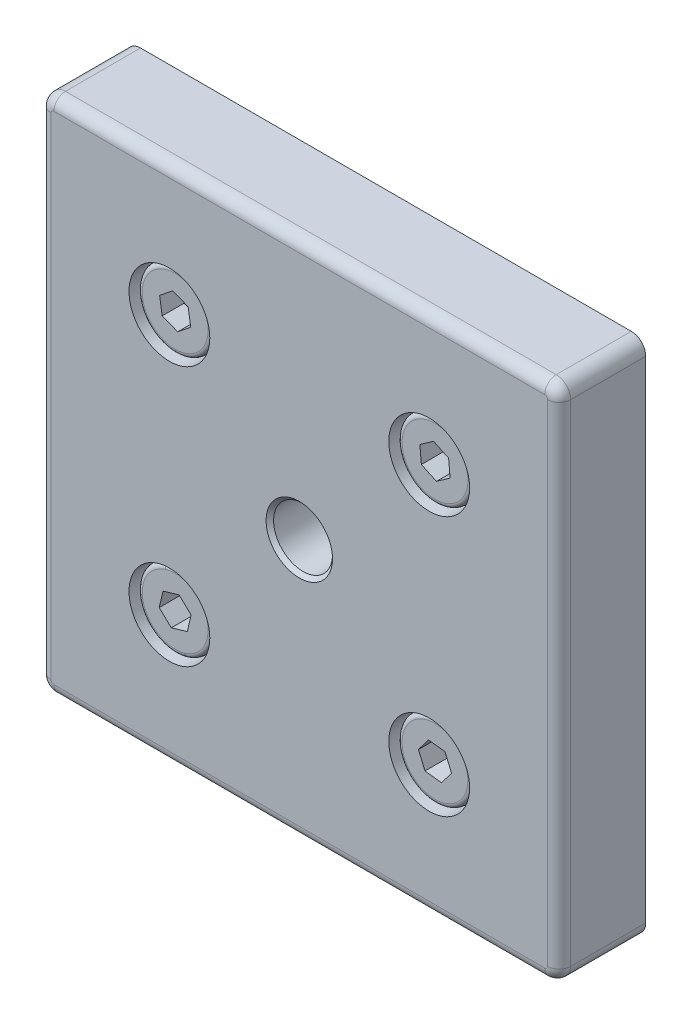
ISO-10303-21;
HEADER;
FILE_DESCRIPTION(('STEP AP214'),'2;1');
FILE_NAME('part.step','',(''),(''),'','','');
FILE_SCHEMA(('AUTOMOTIVE_DESIGN { 1 0 10303 214 1 1 1 1 }'));
ENDSEC;
DATA;
#1=APPLICATION_CONTEXT('core data for automotive mechanical design processes');
#2=APPLICATION_PROTOCOL_DEFINITION('international standard','automotive_design',2000,#1);
#3=PRODUCT_CONTEXT('',#1,'mechanical');
#4=PRODUCT('Part','Part','',(#3));
#5=PRODUCT_RELATED_PRODUCT_CATEGORY('part','',(#4));
#6=PRODUCT_DEFINITION_FORMATION('','',#4);
#7=PRODUCT_DEFINITION_CONTEXT('part definition',#1,'design');
#8=PRODUCT_DEFINITION('design','',#6,#7);
#9=PRODUCT_DEFINITION_SHAPE('','',#8);
#10=(LENGTH_UNIT() NAMED_UNIT(*) SI_UNIT(.MILLI.,.METRE.));
#11=(NAMED_UNIT(*) PLANE_ANGLE_UNIT() SI_UNIT($,.RADIAN.));
#12=(NAMED_UNIT(*) SI_UNIT($,.STERADIAN.) SOLID_ANGLE_UNIT());
#13=UNCERTAINTY_MEASURE_WITH_UNIT(LENGTH_MEASURE(1.E-05),#10,'distance_accuracy_value','');
#14=(GEOMETRIC_REPRESENTATION_CONTEXT(3) GLOBAL_UNCERTAINTY_ASSIGNED_CONTEXT((#13)) GLOBAL_UNIT_ASSIGNED_CONTEXT((#10,
#11,#12)) REPRESENTATION_CONTEXT('',''));
#15=CARTESIAN_POINT('',(0.,0.,0.));
#16=DIRECTION('',(0.,0.,1.));
#17=DIRECTION('',(1.,0.,0.));
#18=AXIS2_PLACEMENT_3D('',#15,#16,#17);
#19=CARTESIAN_POINT('',(-24.1392575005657,23.7492335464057,2.71630300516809));
#20=DIRECTION('',(0.,0.,1.));
#21=DIRECTION('',(0.36176633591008,0.932268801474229,0.));
#22=AXIS2_PLACEMENT_3D('',#19,#20,#21);
#23=CONICAL_SURFACE('',#22,2.5,1.0471975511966);
#24=DIRECTION('',(-0.313298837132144,-0.807368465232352,0.5));
#25=VECTOR('',#24,1.);
#26=CARTESIAN_POINT('',(-25.0436733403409,21.4185615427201,2.71630300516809));
#27=LINE('',#26,#25);
#28=CARTESIAN_POINT('',(-24.1392575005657,23.7492335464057,1.27292733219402));
#29=VERTEX_POINT('',#28);
#30=CARTESIAN_POINT('',(-25.0436733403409,21.4185615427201,2.71630300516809));
#31=VERTEX_POINT('',#30);
#32=EDGE_CURVE('P0_E333',#29,#31,#27,.T.);
#33=ORIENTED_EDGE('',*,*,#32,.F.);
#34=DIRECTION('',(0.313298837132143,0.807368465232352,0.5));
#35=VECTOR('',#34,1.);
#36=CARTESIAN_POINT('',(-23.2348416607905,26.0799055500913,2.71630300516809));
#37=LINE('',#36,#35);
#38=CARTESIAN_POINT('',(-23.2348416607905,26.0799055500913,2.71630300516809));
#39=VERTEX_POINT('',#38);
#40=EDGE_CURVE('P0_E336',#29,#39,#37,.T.);
#41=ORIENTED_EDGE('',*,*,#40,.T.);
#42=CARTESIAN_POINT('',(-24.1392575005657,23.7492335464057,2.71630300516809));
#43=DIRECTION('',(0.,0.,1.));
#44=DIRECTION('',(0.36176633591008,0.932268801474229,0.));
#45=AXIS2_PLACEMENT_3D('',#42,#43,#44);
#46=CIRCLE('',#45,2.5);
#47=CARTESIAN_POINT('',(-25.705470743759,25.6978166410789,2.71630300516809));
#48=VERTEX_POINT('',#47);
#49=EDGE_CURVE('P0_E10',#39,#48,#46,.T.);
#50=ORIENTED_EDGE('',*,*,#49,.T.);
#51=CARTESIAN_POINT('',(-24.1392575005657,23.7492335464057,2.71630300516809));
#52=DIRECTION('',(0.,0.,1.));
#53=DIRECTION('',(0.36176633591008,0.932268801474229,0.));
#54=AXIS2_PLACEMENT_3D('',#51,#52,#53);
#55=CIRCLE('',#54,2.5);
#56=CARTESIAN_POINT('',(-26.6098865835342,23.3671446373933,2.71630300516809));
#57=VERTEX_POINT('',#56);
#58=EDGE_CURVE('P0_E26',#48,#57,#55,.T.);
#59=ORIENTED_EDGE('',*,*,#58,.T.);
#60=CARTESIAN_POINT('',(-24.1392575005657,23.7492335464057,2.71630300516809));
#61=DIRECTION('',(0.,0.,1.));
#62=DIRECTION('',(0.36176633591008,0.932268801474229,0.));
#63=AXIS2_PLACEMENT_3D('',#60,#61,#62);
#64=CIRCLE('',#63,2.5);
#65=EDGE_CURVE('P0_E19',#57,#31,#64,.T.);
#66=ORIENTED_EDGE('',*,*,#65,.T.);
#67=EDGE_LOOP('',(#33,#41,#50,#59,#66));
#68=FACE_BOUND('',#67,.T.);
#69=ADVANCED_FACE('P0_F16',(#68),#23,.F.);
#70=CARTESIAN_POINT('',(-24.5804557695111,26.6020702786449,2.71630300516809));
#71=DIRECTION('',(0.,0.,1.));
#72=DIRECTION('',(0.36176633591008,0.932268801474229,0.));
#73=AXIS2_PLACEMENT_3D('',#70,#71,#72);
#74=PLANE('',#73);
#75=ORIENTED_EDGE('',*,*,#49,.F.);
#76=DIRECTION('',(-0.932268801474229,0.361766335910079,0.));
#77=VECTOR('',#76,1.);
#78=CARTESIAN_POINT('',(-21.8892275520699,25.5577408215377,2.71630300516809));
#79=LINE('',#78,#77);
#80=CARTESIAN_POINT('',(-24.5804557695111,26.6020702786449,2.71630300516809));
#81=VERTEX_POINT('',#80);
#82=EDGE_CURVE('P0_E294',#39,#81,#79,.T.);
#83=ORIENTED_EDGE('',*,*,#82,.T.);
#84=DIRECTION('',(0.779433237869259,0.626485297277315,0.));
#85=VECTOR('',#84,1.);
#86=CARTESIAN_POINT('',(-26.8304857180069,24.7935630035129,2.71630300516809));
#87=LINE('',#86,#85);
#88=EDGE_CURVE('P0_E275',#48,#81,#87,.T.);
#89=ORIENTED_EDGE('',*,*,#88,.F.);
#90=EDGE_LOOP('',(#75,#83,#89));
#91=FACE_BOUND('',#90,.T.);
#92=ADVANCED_FACE('P0_F598',(#91),#74,.T.);
#93=CARTESIAN_POINT('',(-24.5804557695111,26.6020702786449,2.71630300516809));
#94=DIRECTION('',(0.,0.,1.));
#95=DIRECTION('',(0.36176633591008,0.932268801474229,0.));
#96=AXIS2_PLACEMENT_3D('',#93,#94,#95);
#97=PLANE('',#96);
#98=ORIENTED_EDGE('',*,*,#58,.F.);
#99=DIRECTION('',(0.779433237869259,0.626485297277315,0.));
#100=VECTOR('',#99,1.);
#101=CARTESIAN_POINT('',(-26.8304857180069,24.7935630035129,2.71630300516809));
#102=LINE('',#101,#100);
#103=CARTESIAN_POINT('',(-26.8304857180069,24.7935630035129,2.71630300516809));
#104=VERTEX_POINT('',#103);
#105=EDGE_CURVE('P0_E271',#104,#48,#102,.T.);
#106=ORIENTED_EDGE('',*,*,#105,.F.);
#107=DIRECTION('',(0.152835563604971,-0.988251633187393,0.));
#108=VECTOR('',#107,1.);
#109=CARTESIAN_POINT('',(-26.8304857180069,24.7935630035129,2.71630300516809));
#110=LINE('',#109,#108);
#111=EDGE_CURVE('P0_E207',#104,#57,#110,.T.);
#112=ORIENTED_EDGE('',*,*,#111,.T.);
#113=EDGE_LOOP('',(#98,#106,#112));
#114=FACE_BOUND('',#113,.T.);
#115=ADVANCED_FACE('P0_F599',(#114),#97,.T.);
#116=CARTESIAN_POINT('',(-24.5804557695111,26.6020702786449,2.71630300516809));
#117=DIRECTION('',(0.,0.,1.));
#118=DIRECTION('',(0.36176633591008,0.932268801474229,0.));
#119=AXIS2_PLACEMENT_3D('',#116,#117,#118);
#120=PLANE('',#119);
#121=ORIENTED_EDGE('',*,*,#65,.F.);
#122=DIRECTION('',(0.152835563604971,-0.988251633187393,0.));
#123=VECTOR('',#122,1.);
#124=CARTESIAN_POINT('',(-26.8304857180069,24.7935630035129,2.71630300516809));
#125=LINE('',#124,#123);
#126=CARTESIAN_POINT('',(-26.3892874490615,21.9407262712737,2.71630300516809));
#127=VERTEX_POINT('',#126);
#128=EDGE_CURVE('P0_E205',#57,#127,#125,.T.);
#129=ORIENTED_EDGE('',*,*,#128,.T.);
#130=DIRECTION('',(0.932268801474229,-0.361766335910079,0.));
#131=VECTOR('',#130,1.);
#132=CARTESIAN_POINT('',(-26.3892874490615,21.9407262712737,2.71630300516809));
#133=LINE('',#132,#131);
#134=EDGE_CURVE('P0_E175',#127,#31,#133,.T.);
#135=ORIENTED_EDGE('',*,*,#134,.T.);
#136=EDGE_LOOP('',(#121,#129,#135));
#137=FACE_BOUND('',#136,.T.);
#138=ADVANCED_FACE('P0_F609',(#137),#120,.T.);
#139=CARTESIAN_POINT('',(-24.5804557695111,26.6020702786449,2.71630300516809));
#140=DIRECTION('',(0.,0.,1.));
#141=DIRECTION('',(0.36176633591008,0.932268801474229,0.));
#142=AXIS2_PLACEMENT_3D('',#139,#140,#141);
#143=PLANE('',#142);
#144=CARTESIAN_POINT('',(-24.1392575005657,23.7492335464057,2.71630300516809));
#145=DIRECTION('',(0.,0.,1.));
#146=DIRECTION('',(0.36176633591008,0.932268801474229,0.));
#147=AXIS2_PLACEMENT_3D('',#144,#145,#146);
#148=CIRCLE('',#147,2.5);
#149=CARTESIAN_POINT('',(-22.5730442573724,21.8006504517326,2.71630300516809));
#150=VERTEX_POINT('',#149);
#151=EDGE_CURVE('P0_E170',#31,#150,#148,.T.);
#152=ORIENTED_EDGE('',*,*,#151,.F.);
#153=DIRECTION('',(0.932268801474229,-0.361766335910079,0.));
#154=VECTOR('',#153,1.);
#155=CARTESIAN_POINT('',(-26.3892874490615,21.9407262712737,2.71630300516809));
#156=LINE('',#155,#154);
#157=CARTESIAN_POINT('',(-23.6980592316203,20.8963968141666,2.71630300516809));
#158=VERTEX_POINT('',#157);
#159=EDGE_CURVE('P0_E163',#31,#158,#156,.T.);
#160=ORIENTED_EDGE('',*,*,#159,.T.);
#161=DIRECTION('',(-0.779433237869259,-0.626485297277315,0.));
#162=VECTOR('',#161,1.);
#163=CARTESIAN_POINT('',(-21.4480292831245,22.7049040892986,2.71630300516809));
#164=LINE('',#163,#162);
#165=EDGE_CURVE('P0_E167',#150,#158,#164,.T.);
#166=ORIENTED_EDGE('',*,*,#165,.F.);
#167=EDGE_LOOP('',(#152,#160,#166));
#168=FACE_BOUND('',#167,.T.);
#169=ADVANCED_FACE('P0_F165',(#168),#143,.T.);
#170=CARTESIAN_POINT('',(-24.5804557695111,26.6020702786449,2.71630300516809));
#171=DIRECTION('',(0.,0.,1.));
#172=DIRECTION('',(0.36176633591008,0.932268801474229,0.));
#173=AXIS2_PLACEMENT_3D('',#170,#171,#172);
#174=PLANE('',#173);
#175=CARTESIAN_POINT('',(-24.1392575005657,23.7492335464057,2.71630300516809));
#176=DIRECTION('',(0.,0.,1.));
#177=DIRECTION('',(0.36176633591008,0.932268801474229,0.));
#178=AXIS2_PLACEMENT_3D('',#175,#176,#177);
#179=CIRCLE('',#178,2.5);
#180=CARTESIAN_POINT('',(-21.6686284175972,24.1313224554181,2.71630300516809));
#181=VERTEX_POINT('',#180);
#182=EDGE_CURVE('P0_E317',#150,#181,#179,.T.);
#183=ORIENTED_EDGE('',*,*,#182,.F.);
#184=DIRECTION('',(-0.779433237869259,-0.626485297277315,0.));
#185=VECTOR('',#184,1.);
#186=CARTESIAN_POINT('',(-21.4480292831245,22.7049040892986,2.71630300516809));
#187=LINE('',#186,#185);
#188=CARTESIAN_POINT('',(-21.4480292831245,22.7049040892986,2.71630300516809));
#189=VERTEX_POINT('',#188);
#190=EDGE_CURVE('P0_E189',#189,#150,#187,.T.);
#191=ORIENTED_EDGE('',*,*,#190,.F.);
#192=DIRECTION('',(0.152835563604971,-0.988251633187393,0.));
#193=VECTOR('',#192,1.);
#194=CARTESIAN_POINT('',(-21.8892275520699,25.5577408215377,2.71630300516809));
#195=LINE('',#194,#193);
#196=EDGE_CURVE('P0_E291',#181,#189,#195,.T.);
#197=ORIENTED_EDGE('',*,*,#196,.F.);
#198=EDGE_LOOP('',(#183,#191,#197));
#199=FACE_BOUND('',#198,.T.);
#200=ADVANCED_FACE('P0_F315',(#199),#174,.T.);
#201=CARTESIAN_POINT('',(-24.5804557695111,26.6020702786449,2.71630300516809));
#202=DIRECTION('',(0.,0.,1.));
#203=DIRECTION('',(0.36176633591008,0.932268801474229,0.));
#204=AXIS2_PLACEMENT_3D('',#201,#202,#203);
#205=PLANE('',#204);
#206=CARTESIAN_POINT('',(-24.1392575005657,23.7492335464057,2.71630300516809));
#207=DIRECTION('',(0.,0.,1.));
#208=DIRECTION('',(0.36176633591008,0.932268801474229,0.));
#209=AXIS2_PLACEMENT_3D('',#206,#207,#208);
#210=CIRCLE('',#209,2.5);
#211=EDGE_CURVE('P0_E344',#181,#39,#210,.T.);
#212=ORIENTED_EDGE('',*,*,#211,.F.);
#213=DIRECTION('',(0.152835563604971,-0.988251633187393,0.));
#214=VECTOR('',#213,1.);
#215=CARTESIAN_POINT('',(-21.8892275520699,25.5577408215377,2.71630300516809));
#216=LINE('',#215,#214);
#217=CARTESIAN_POINT('',(-21.8892275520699,25.5577408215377,2.71630300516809));
#218=VERTEX_POINT('',#217);
#219=EDGE_CURVE('P0_E302',#218,#181,#216,.T.);
#220=ORIENTED_EDGE('',*,*,#219,.F.);
#221=DIRECTION('',(-0.932268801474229,0.361766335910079,0.));
#222=VECTOR('',#221,1.);
#223=CARTESIAN_POINT('',(-21.8892275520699,25.5577408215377,2.71630300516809));
#224=LINE('',#223,#222);
#225=EDGE_CURVE('P0_E297',#218,#39,#224,.T.);
#226=ORIENTED_EDGE('',*,*,#225,.T.);
#227=EDGE_LOOP('',(#212,#220,#226));
#228=FACE_BOUND('',#227,.T.);
#229=ADVANCED_FACE('P0_F590',(#228),#205,.T.);
#230=CARTESIAN_POINT('',(-26.8304857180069,24.7935630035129,2.71630300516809));
#231=DIRECTION('',(-0.988251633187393,-0.152835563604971,0.));
#232=DIRECTION('',(0.,0.,1.));
#233=AXIS2_PLACEMENT_3D('',#230,#231,#232);
#234=PLANE('',#233);
#235=DIRECTION('',(0.152835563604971,-0.988251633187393,0.));
#236=VECTOR('',#235,1.);
#237=CARTESIAN_POINT('',(-26.8304857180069,24.7935630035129,6.51630300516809));
#238=LINE('',#237,#236);
#239=CARTESIAN_POINT('',(-26.8304857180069,24.7935630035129,6.51630300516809));
#240=VERTEX_POINT('',#239);
#241=CARTESIAN_POINT('',(-26.3892874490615,21.9407262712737,6.51630300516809));
#242=VERTEX_POINT('',#241);
#243=EDGE_CURVE('P0_E260',#240,#242,#238,.T.);
#244=ORIENTED_EDGE('',*,*,#243,.T.);
#245=DIRECTION('',(0.,0.,1.));
#246=VECTOR('',#245,1.);
#247=CARTESIAN_POINT('',(-26.3892874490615,21.9407262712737,2.71630300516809));
#248=LINE('',#247,#246);
#249=EDGE_CURVE('P0_E203',#127,#242,#248,.T.);
#250=ORIENTED_EDGE('',*,*,#249,.F.);
#251=ORIENTED_EDGE('',*,*,#128,.F.);
#252=ORIENTED_EDGE('',*,*,#111,.F.);
#253=DIRECTION('',(0.,0.,1.));
#254=VECTOR('',#253,1.);
#255=CARTESIAN_POINT('',(-26.8304857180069,24.7935630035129,2.71630300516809));
#256=LINE('',#255,#254);
#257=EDGE_CURVE('P0_E276',#104,#240,#256,.T.);
#258=ORIENTED_EDGE('',*,*,#257,.T.);
#259=EDGE_LOOP('',(#244,#250,#251,#252,#258));
#260=FACE_BOUND('',#259,.T.);
#261=ADVANCED_FACE('P0_F606',(#260),#234,.F.);
#262=CARTESIAN_POINT('',(-26.3892874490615,21.9407262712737,2.71630300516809));
#263=DIRECTION('',(-0.361766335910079,-0.932268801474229,0.));
#264=DIRECTION('',(0.932268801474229,-0.361766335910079,0.));
#265=AXIS2_PLACEMENT_3D('',#262,#263,#264);
#266=PLANE('',#265);
#267=DIRECTION('',(0.932268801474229,-0.361766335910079,0.));
#268=VECTOR('',#267,1.);
#269=CARTESIAN_POINT('',(-26.3892874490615,21.9407262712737,6.51630300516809));
#270=LINE('',#269,#268);
#271=CARTESIAN_POINT('',(-23.6980592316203,20.8963968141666,6.51630300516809));
#272=VERTEX_POINT('',#271);
#273=EDGE_CURVE('P0_E181',#242,#272,#270,.T.);
#274=ORIENTED_EDGE('',*,*,#273,.T.);
#275=DIRECTION('',(0.,0.,1.));
#276=VECTOR('',#275,1.);
#277=CARTESIAN_POINT('',(-23.6980592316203,20.8963968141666,2.71630300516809));
#278=LINE('',#277,#276);
#279=EDGE_CURVE('P0_E176',#158,#272,#278,.T.);
#280=ORIENTED_EDGE('',*,*,#279,.F.);
#281=ORIENTED_EDGE('',*,*,#159,.F.);
#282=ORIENTED_EDGE('',*,*,#134,.F.);
#283=ORIENTED_EDGE('',*,*,#249,.T.);
#284=EDGE_LOOP('',(#274,#280,#281,#282,#283));
#285=FACE_BOUND('',#284,.T.);
#286=ADVANCED_FACE('P0_F179',(#285),#266,.F.);
#287=CARTESIAN_POINT('',(-21.4480292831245,22.7049040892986,2.71630300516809));
#288=DIRECTION('',(-0.626485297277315,0.779433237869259,0.));
#289=DIRECTION('',(0.,0.,-1.));
#290=AXIS2_PLACEMENT_3D('',#287,#288,#289);
#291=PLANE('',#290);
#292=DIRECTION('',(-0.779433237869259,-0.626485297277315,0.));
#293=VECTOR('',#292,1.);
#294=CARTESIAN_POINT('',(-21.4480292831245,22.7049040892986,6.51630300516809));
#295=LINE('',#294,#293);
#296=CARTESIAN_POINT('',(-21.4480292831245,22.7049040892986,6.51630300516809));
#297=VERTEX_POINT('',#296);
#298=EDGE_CURVE('P0_E254',#297,#272,#295,.T.);
#299=ORIENTED_EDGE('',*,*,#298,.F.);
#300=DIRECTION('',(0.,0.,1.));
#301=VECTOR('',#300,1.);
#302=CARTESIAN_POINT('',(-21.4480292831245,22.7049040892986,2.71630300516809));
#303=LINE('',#302,#301);
#304=EDGE_CURVE('P0_E197',#189,#297,#303,.T.);
#305=ORIENTED_EDGE('',*,*,#304,.F.);
#306=ORIENTED_EDGE('',*,*,#190,.T.);
#307=ORIENTED_EDGE('',*,*,#165,.T.);
#308=ORIENTED_EDGE('',*,*,#279,.T.);
#309=EDGE_LOOP('',(#299,#305,#306,#307,#308));
#310=FACE_BOUND('',#309,.T.);
#311=ADVANCED_FACE('P0_F187',(#310),#291,.T.);
#312=CARTESIAN_POINT('',(-21.8892275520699,25.5577408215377,2.71630300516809));
#313=DIRECTION('',(-0.988251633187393,-0.152835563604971,0.));
#314=DIRECTION('',(0.,0.,1.));
#315=AXIS2_PLACEMENT_3D('',#312,#313,#314);
#316=PLANE('',#315);
#317=DIRECTION('',(0.152835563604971,-0.988251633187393,0.));
#318=VECTOR('',#317,1.);
#319=CARTESIAN_POINT('',(-21.8892275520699,25.5577408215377,6.51630300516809));
#320=LINE('',#319,#318);
#321=CARTESIAN_POINT('',(-21.8892275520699,25.5577408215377,6.51630300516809));
#322=VERTEX_POINT('',#321);
#323=EDGE_CURVE('P0_E257',#322,#297,#320,.T.);
#324=ORIENTED_EDGE('',*,*,#323,.F.);
#325=DIRECTION('',(0.,0.,1.));
#326=VECTOR('',#325,1.);
#327=CARTESIAN_POINT('',(-21.8892275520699,25.5577408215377,2.71630300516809));
#328=LINE('',#327,#326);
#329=EDGE_CURVE('P0_E301',#218,#322,#328,.T.);
#330=ORIENTED_EDGE('',*,*,#329,.F.);
#331=ORIENTED_EDGE('',*,*,#219,.T.);
#332=ORIENTED_EDGE('',*,*,#196,.T.);
#333=ORIENTED_EDGE('',*,*,#304,.T.);
#334=EDGE_LOOP('',(#324,#330,#331,#332,#333));
#335=FACE_BOUND('',#334,.T.);
#336=ADVANCED_FACE('P0_F311',(#335),#316,.T.);
#337=CARTESIAN_POINT('',(-21.8892275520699,25.5577408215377,2.71630300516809));
#338=DIRECTION('',(0.361766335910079,0.932268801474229,0.));
#339=DIRECTION('',(0.932268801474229,-0.361766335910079,0.));
#340=AXIS2_PLACEMENT_3D('',#337,#338,#339);
#341=PLANE('',#340);
#342=DIRECTION('',(-0.932268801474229,0.361766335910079,0.));
#343=VECTOR('',#342,1.);
#344=CARTESIAN_POINT('',(-21.8892275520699,25.5577408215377,6.51630300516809));
#345=LINE('',#344,#343);
#346=CARTESIAN_POINT('',(-24.5804557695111,26.6020702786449,6.51630300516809));
#347=VERTEX_POINT('',#346);
#348=EDGE_CURVE('P0_E251',#322,#347,#345,.T.);
#349=ORIENTED_EDGE('',*,*,#348,.T.);
#350=DIRECTION('',(0.,0.,1.));
#351=VECTOR('',#350,1.);
#352=CARTESIAN_POINT('',(-24.5804557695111,26.6020702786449,2.71630300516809));
#353=LINE('',#352,#351);
#354=EDGE_CURVE('P0_E288',#81,#347,#353,.T.);
#355=ORIENTED_EDGE('',*,*,#354,.F.);
#356=ORIENTED_EDGE('',*,*,#82,.F.);
#357=ORIENTED_EDGE('',*,*,#225,.F.);
#358=ORIENTED_EDGE('',*,*,#329,.T.);
#359=EDGE_LOOP('',(#349,#355,#356,#357,#358));
#360=FACE_BOUND('',#359,.T.);
#361=ADVANCED_FACE('P0_F595',(#360),#341,.F.);
#362=CARTESIAN_POINT('',(-26.8304857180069,24.7935630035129,2.71630300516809));
#363=DIRECTION('',(0.626485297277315,-0.779433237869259,0.));
#364=DIRECTION('',(-0.779433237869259,-0.626485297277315,0.));
#365=AXIS2_PLACEMENT_3D('',#362,#363,#364);
#366=PLANE('',#365);
#367=DIRECTION('',(0.779433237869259,0.626485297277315,0.));
#368=VECTOR('',#367,1.);
#369=CARTESIAN_POINT('',(-26.8304857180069,24.7935630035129,6.51630300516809));
#370=LINE('',#369,#368);
#371=EDGE_CURVE('P0_E247',#240,#347,#370,.T.);
#372=ORIENTED_EDGE('',*,*,#371,.F.);
#373=ORIENTED_EDGE('',*,*,#257,.F.);
#374=ORIENTED_EDGE('',*,*,#105,.T.);
#375=ORIENTED_EDGE('',*,*,#88,.T.);
#376=ORIENTED_EDGE('',*,*,#354,.T.);
#377=EDGE_LOOP('',(#372,#373,#374,#375,#376));
#378=FACE_BOUND('',#377,.T.);
#379=ADVANCED_FACE('P0_F603',(#378),#366,.T.);
#380=CARTESIAN_POINT('',(-24.1392575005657,23.7492335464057,5.71630300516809));
#381=DIRECTION('',(0.,0.,1.));
#382=DIRECTION('',(0.36176633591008,0.932268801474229,0.));
#383=AXIS2_PLACEMENT_3D('',#380,#381,#382);
#384=TOROIDAL_SURFACE('',#383,5.7,0.8);
#385=CARTESIAN_POINT('',(-26.2013256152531,18.4353013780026,5.71630300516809));
#386=DIRECTION('',(-0.932268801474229,0.36176633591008,0.));
#387=DIRECTION('',(0.36176633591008,0.932268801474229,0.));
#388=AXIS2_PLACEMENT_3D('',#385,#386,#387);
#389=CIRCLE('',#388,0.8);
#390=CARTESIAN_POINT('',(-26.4907386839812,17.6894863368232,5.71630300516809));
#391=VERTEX_POINT('',#390);
#392=CARTESIAN_POINT('',(-26.2013256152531,18.4353013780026,6.51630300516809));
#393=VERTEX_POINT('',#392);
#394=EDGE_CURVE('P0_E343',#391,#393,#389,.T.);
#395=ORIENTED_EDGE('',*,*,#394,.F.);
#396=CARTESIAN_POINT('',(-24.1392575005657,23.7492335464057,5.71630300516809));
#397=DIRECTION('',(0.,0.,-1.));
#398=DIRECTION('',(0.36176633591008,0.932268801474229,0.));
#399=AXIS2_PLACEMENT_3D('',#396,#397,#398);
#400=CIRCLE('',#399,6.5);
#401=CARTESIAN_POINT('',(-21.7877763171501,29.8089807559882,5.71630300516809));
#402=VERTEX_POINT('',#401);
#403=EDGE_CURVE('P0_E267',#402,#391,#400,.T.);
#404=ORIENTED_EDGE('',*,*,#403,.F.);
#405=CARTESIAN_POINT('',(-22.0771893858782,29.0631657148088,5.71630300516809));
#406=DIRECTION('',(0.932268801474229,-0.36176633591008,0.));
#407=DIRECTION('',(-0.36176633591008,-0.932268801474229,0.));
#408=AXIS2_PLACEMENT_3D('',#405,#406,#407);
#409=CIRCLE('',#408,0.8);
#410=CARTESIAN_POINT('',(-22.0771893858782,29.0631657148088,6.51630300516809));
#411=VERTEX_POINT('',#410);
#412=EDGE_CURVE('P0_E362',#402,#411,#409,.T.);
#413=ORIENTED_EDGE('',*,*,#412,.T.);
#414=CARTESIAN_POINT('',(-24.1392575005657,23.7492335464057,6.51630300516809));
#415=DIRECTION('',(0.,0.,1.));
#416=DIRECTION('',(0.36176633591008,0.932268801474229,0.));
#417=AXIS2_PLACEMENT_3D('',#414,#415,#416);
#418=CIRCLE('',#417,5.7);
#419=EDGE_CURVE('P0_E244',#393,#411,#418,.T.);
#420=ORIENTED_EDGE('',*,*,#419,.F.);
#421=EDGE_LOOP('',(#395,#404,#413,#420));
#422=FACE_BOUND('',#421,.T.);
#423=ADVANCED_FACE('P0_F640',(#422),#384,.T.);
#424=CARTESIAN_POINT('',(-24.1392575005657,23.7492335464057,1.11630300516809));
#425=DIRECTION('',(0.,0.,-1.));
#426=DIRECTION('',(-0.36176633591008,-0.932268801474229,0.));
#427=AXIS2_PLACEMENT_3D('',#424,#425,#426);
#428=TOROIDAL_SURFACE('',#427,4.39999999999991,0.4);
#429=CARTESIAN_POINT('',(-22.5474856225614,27.8512162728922,1.11630300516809));
#430=DIRECTION('',(-0.932268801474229,0.36176633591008,0.));
#431=DIRECTION('',(0.36176633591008,0.932268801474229,0.));
#432=AXIS2_PLACEMENT_3D('',#429,#430,#431);
#433=CIRCLE('',#432,0.4);
#434=CARTESIAN_POINT('',(-22.6921921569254,27.4783087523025,1.11630300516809));
#435=VERTEX_POINT('',#434);
#436=CARTESIAN_POINT('',(-22.5474856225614,27.8512162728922,1.51630300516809));
#437=VERTEX_POINT('',#436);
#438=EDGE_CURVE('P0_E372',#435,#437,#433,.T.);
#439=ORIENTED_EDGE('',*,*,#438,.F.);
#440=CARTESIAN_POINT('',(-24.1392575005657,23.7492335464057,1.11630300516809));
#441=DIRECTION('',(0.,0.,-1.));
#442=DIRECTION('',(-0.36176633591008,-0.932268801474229,0.));
#443=AXIS2_PLACEMENT_3D('',#440,#441,#442);
#444=CIRCLE('',#443,3.99999999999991);
#445=CARTESIAN_POINT('',(-25.586322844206,20.0201583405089,1.11630300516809));
#446=VERTEX_POINT('',#445);
#447=EDGE_CURVE('P0_E227',#446,#435,#444,.T.);
#448=ORIENTED_EDGE('',*,*,#447,.F.);
#449=CARTESIAN_POINT('',(-25.73102937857,19.6472508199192,1.11630300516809));
#450=DIRECTION('',(0.932268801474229,-0.36176633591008,0.));
#451=DIRECTION('',(-0.36176633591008,-0.932268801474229,0.));
#452=AXIS2_PLACEMENT_3D('',#449,#450,#451);
#453=CIRCLE('',#452,0.4);
#454=CARTESIAN_POINT('',(-25.73102937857,19.6472508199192,1.51630300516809));
#455=VERTEX_POINT('',#454);
#456=EDGE_CURVE('P0_E354',#446,#455,#453,.T.);
#457=ORIENTED_EDGE('',*,*,#456,.T.);
#458=CARTESIAN_POINT('',(-24.1392575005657,23.7492335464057,1.51630300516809));
#459=DIRECTION('',(0.,0.,1.));
#460=DIRECTION('',(-0.36176633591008,-0.932268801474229,0.));
#461=AXIS2_PLACEMENT_3D('',#458,#459,#460);
#462=CIRCLE('',#461,4.39999999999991);
#463=EDGE_CURVE('P0_E270',#437,#455,#462,.T.);
#464=ORIENTED_EDGE('',*,*,#463,.F.);
#465=EDGE_LOOP('',(#439,#448,#457,#464));
#466=FACE_BOUND('',#465,.T.);
#467=ADVANCED_FACE('P0_F643',(#466),#428,.F.);
#468=CARTESIAN_POINT('',(-27.2246010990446,24.9464992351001,-23.4836969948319));
#469=DIRECTION('',(0.,0.,-1.));
#470=DIRECTION('',(-0.932268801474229,0.36176633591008,0.));
#471=AXIS2_PLACEMENT_3D('',#468,#469,#470);
#472=PLANE('',#471);
#473=CARTESIAN_POINT('',(-24.1392575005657,23.7492335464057,-23.4836969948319));
#474=DIRECTION('',(0.,0.,1.));
#475=DIRECTION('',(0.36176633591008,0.932268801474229,0.));
#476=AXIS2_PLACEMENT_3D('',#473,#474,#475);
#477=CIRCLE('',#476,3.3095);
#478=CARTESIAN_POINT('',(-22.9419918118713,26.8345771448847,-23.4836969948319));
#479=VERTEX_POINT('',#478);
#480=CARTESIAN_POINT('',(-25.3365231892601,20.6638899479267,-23.4836969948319));
#481=VERTEX_POINT('',#480);
#482=EDGE_CURVE('P0_E350',#479,#481,#477,.T.);
#483=ORIENTED_EDGE('',*,*,#482,.F.);
#484=CARTESIAN_POINT('',(-24.1392575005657,23.7492335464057,-23.4836969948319));
#485=DIRECTION('',(0.,0.,1.));
#486=DIRECTION('',(0.36176633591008,0.932268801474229,0.));
#487=AXIS2_PLACEMENT_3D('',#484,#485,#486);
#488=CIRCLE('',#487,3.3095);
#489=EDGE_CURVE('P0_E280',#481,#479,#488,.T.);
#490=ORIENTED_EDGE('',*,*,#489,.F.);
#491=EDGE_LOOP('',(#483,#490));
#492=FACE_BOUND('',#491,.T.);
#493=ADVANCED_FACE('P0_F649',(#492),#472,.T.);
#494=CARTESIAN_POINT('',(-24.1392575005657,23.7492335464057,-23.4836969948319));
#495=DIRECTION('',(0.,0.,1.));
#496=DIRECTION('',(0.36176633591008,0.932268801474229,0.));
#497=AXIS2_PLACEMENT_3D('',#494,#495,#496);
#498=CONICAL_SURFACE('',#497,3.3095,0.785398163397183);
#499=DIRECTION('',(-0.25580742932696,-0.659213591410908,0.707106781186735));
#500=VECTOR('',#499,1.);
#501=CARTESIAN_POINT('',(-25.3365231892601,20.6638899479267,-23.4836969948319));
#502=LINE('',#501,#500);
#503=CARTESIAN_POINT('',(-25.5863228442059,20.020158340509,-22.7931969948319));
#504=VERTEX_POINT('',#503);
#505=EDGE_CURVE('P0_E345',#481,#504,#502,.T.);
#506=ORIENTED_EDGE('',*,*,#505,.F.);
#507=ORIENTED_EDGE('',*,*,#489,.T.);
#508=DIRECTION('',(0.25580742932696,0.659213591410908,0.707106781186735));
#509=VECTOR('',#508,1.);
#510=CARTESIAN_POINT('',(-22.9419918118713,26.8345771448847,-23.4836969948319));
#511=LINE('',#510,#509);
#512=CARTESIAN_POINT('',(-22.6921921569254,27.4783087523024,-22.7931969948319));
#513=VERTEX_POINT('',#512);
#514=EDGE_CURVE('P0_E384',#479,#513,#511,.T.);
#515=ORIENTED_EDGE('',*,*,#514,.T.);
#516=CARTESIAN_POINT('',(-24.1392575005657,23.7492335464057,-22.7931969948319));
#517=DIRECTION('',(0.,0.,1.));
#518=DIRECTION('',(0.36176633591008,0.932268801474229,0.));
#519=AXIS2_PLACEMENT_3D('',#516,#517,#518);
#520=CIRCLE('',#519,3.99999999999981);
#521=EDGE_CURVE('P0_E277',#504,#513,#520,.T.);
#522=ORIENTED_EDGE('',*,*,#521,.F.);
#523=EDGE_LOOP('',(#506,#507,#515,#522));
#524=FACE_BOUND('',#523,.T.);
#525=ADVANCED_FACE('P0_F653',(#524),#498,.T.);
#526=CARTESIAN_POINT('',(-24.1392575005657,23.7492335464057,38.2663030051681));
#527=DIRECTION('',(0.,0.,1.));
#528=DIRECTION('',(0.36176633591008,0.932268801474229,0.));
#529=AXIS2_PLACEMENT_3D('',#526,#527,#528);
#530=CYLINDRICAL_SURFACE('',#529,3.99999999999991);
#531=DIRECTION('',(0.,0.,1.));
#532=VECTOR('',#531,1.);
#533=CARTESIAN_POINT('',(-25.586322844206,20.0201583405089,38.2663030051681));
#534=LINE('',#533,#532);
#535=EDGE_CURVE('P0_E225',#504,#446,#534,.T.);
#536=ORIENTED_EDGE('',*,*,#535,.F.);
#537=ORIENTED_EDGE('',*,*,#521,.T.);
#538=DIRECTION('',(0.,0.,1.));
#539=VECTOR('',#538,1.);
#540=CARTESIAN_POINT('',(-22.6921921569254,27.4783087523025,38.2663030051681));
#541=LINE('',#540,#539);
#542=EDGE_CURVE('P0_E231',#513,#435,#541,.T.);
#543=ORIENTED_EDGE('',*,*,#542,.T.);
#544=CARTESIAN_POINT('',(-24.1392575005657,23.7492335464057,1.11630300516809));
#545=DIRECTION('',(0.,0.,-1.));
#546=DIRECTION('',(-0.36176633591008,-0.932268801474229,0.));
#547=AXIS2_PLACEMENT_3D('',#544,#545,#546);
#548=CIRCLE('',#547,3.99999999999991);
#549=EDGE_CURVE('P0_E366',#435,#446,#548,.T.);
#550=ORIENTED_EDGE('',*,*,#549,.T.);
#551=EDGE_LOOP('',(#536,#537,#543,#550));
#552=FACE_BOUND('',#551,.T.);
#553=ADVANCED_FACE('P0_F414',(#552),#530,.T.);
#554=CARTESIAN_POINT('',(-30.1990047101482,26.1007147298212,1.51630300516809));
#555=DIRECTION('',(0.,0.,-1.));
#556=DIRECTION('',(-0.932268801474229,0.36176633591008,0.));
#557=AXIS2_PLACEMENT_3D('',#554,#555,#556);
#558=PLANE('',#557);
#559=CARTESIAN_POINT('',(-24.1392575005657,23.7492335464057,1.51630300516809));
#560=DIRECTION('',(0.,0.,1.));
#561=DIRECTION('',(-0.36176633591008,-0.932268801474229,0.));
#562=AXIS2_PLACEMENT_3D('',#559,#560,#561);
#563=CIRCLE('',#562,4.39999999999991);
#564=EDGE_CURVE('P0_E376',#455,#437,#563,.T.);
#565=ORIENTED_EDGE('',*,*,#564,.T.);
#566=ORIENTED_EDGE('',*,*,#463,.T.);
#567=EDGE_LOOP('',(#565,#566));
#568=FACE_BOUND('',#567,.T.);
#569=CARTESIAN_POINT('',(-24.1392575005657,23.7492335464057,1.51630300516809));
#570=DIRECTION('',(0.,0.,1.));
#571=DIRECTION('',(0.36176633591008,0.932268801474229,0.));
#572=AXIS2_PLACEMENT_3D('',#569,#570,#571);
#573=CIRCLE('',#572,6.5);
#574=CARTESIAN_POINT('',(-21.7877763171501,29.8089807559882,1.51630300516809));
#575=VERTEX_POINT('',#574);
#576=CARTESIAN_POINT('',(-26.4907386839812,17.6894863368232,1.51630300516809));
#577=VERTEX_POINT('',#576);
#578=EDGE_CURVE('P0_E235',#575,#577,#573,.T.);
#579=ORIENTED_EDGE('',*,*,#578,.F.);
#580=CARTESIAN_POINT('',(-24.1392575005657,23.7492335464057,1.51630300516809));
#581=DIRECTION('',(0.,0.,1.));
#582=DIRECTION('',(0.36176633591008,0.932268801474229,0.));
#583=AXIS2_PLACEMENT_3D('',#580,#581,#582);
#584=CIRCLE('',#583,6.5);
#585=EDGE_CURVE('P0_E264',#577,#575,#584,.T.);
#586=ORIENTED_EDGE('',*,*,#585,.F.);
#587=EDGE_LOOP('',(#579,#586));
#588=FACE_BOUND('',#587,.T.);
#589=ADVANCED_FACE('P0_F659',(#568,#588),#558,.T.);
#590=CARTESIAN_POINT('',(-24.1392575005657,23.7492335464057,38.2663030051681));
#591=DIRECTION('',(0.,0.,1.));
#592=DIRECTION('',(0.36176633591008,0.932268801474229,0.));
#593=AXIS2_PLACEMENT_3D('',#590,#591,#592);
#594=CYLINDRICAL_SURFACE('',#593,6.5);
#595=DIRECTION('',(0.,0.,1.));
#596=VECTOR('',#595,1.);
#597=CARTESIAN_POINT('',(-26.4907386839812,17.6894863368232,38.2663030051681));
#598=LINE('',#597,#596);
#599=EDGE_CURVE('P0_E236',#577,#391,#598,.T.);
#600=ORIENTED_EDGE('',*,*,#599,.F.);
#601=ORIENTED_EDGE('',*,*,#585,.T.);
#602=DIRECTION('',(0.,0.,1.));
#603=VECTOR('',#602,1.);
#604=CARTESIAN_POINT('',(-21.7877763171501,29.8089807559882,38.2663030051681));
#605=LINE('',#604,#603);
#606=EDGE_CURVE('P0_E240',#575,#402,#605,.T.);
#607=ORIENTED_EDGE('',*,*,#606,.T.);
#608=ORIENTED_EDGE('',*,*,#403,.T.);
#609=EDGE_LOOP('',(#600,#601,#607,#608));
#610=FACE_BOUND('',#609,.T.);
#611=ADVANCED_FACE('P0_F662',(#610),#594,.T.);
#612=CARTESIAN_POINT('',(-24.1392575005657,23.7492335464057,6.51630300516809));
#613=DIRECTION('',(0.,0.,1.));
#614=DIRECTION('',(0.36176633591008,0.932268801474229,0.));
#615=AXIS2_PLACEMENT_3D('',#612,#613,#614);
#616=PLANE('',#615);
#617=ORIENTED_EDGE('',*,*,#371,.T.);
#618=ORIENTED_EDGE('',*,*,#348,.F.);
#619=ORIENTED_EDGE('',*,*,#323,.T.);
#620=ORIENTED_EDGE('',*,*,#298,.T.);
#621=ORIENTED_EDGE('',*,*,#273,.F.);
#622=ORIENTED_EDGE('',*,*,#243,.F.);
#623=EDGE_LOOP('',(#617,#618,#619,#620,#621,#622));
#624=FACE_BOUND('',#623,.T.);
#625=CARTESIAN_POINT('',(-24.1392575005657,23.7492335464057,6.51630300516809));
#626=DIRECTION('',(0.,0.,1.));
#627=DIRECTION('',(0.36176633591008,0.932268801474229,0.));
#628=AXIS2_PLACEMENT_3D('',#625,#626,#627);
#629=CIRCLE('',#628,5.7);
#630=EDGE_CURVE('P0_E358',#411,#393,#629,.T.);
#631=ORIENTED_EDGE('',*,*,#630,.T.);
#632=ORIENTED_EDGE('',*,*,#419,.T.);
#633=EDGE_LOOP('',(#631,#632));
#634=FACE_BOUND('',#633,.T.);
#635=ADVANCED_FACE('P0_F321',(#624,#634),#616,.T.);
#636=CARTESIAN_POINT('',(-24.1392575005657,23.7492335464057,38.2663030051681));
#637=DIRECTION('',(0.,0.,1.));
#638=DIRECTION('',(0.36176633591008,0.932268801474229,0.));
#639=AXIS2_PLACEMENT_3D('',#636,#637,#638);
#640=CYLINDRICAL_SURFACE('',#639,6.5);
#641=ORIENTED_EDGE('',*,*,#578,.T.);
#642=ORIENTED_EDGE('',*,*,#599,.T.);
#643=CARTESIAN_POINT('',(-24.1392575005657,23.7492335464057,5.71630300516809));
#644=DIRECTION('',(0.,0.,-1.));
#645=DIRECTION('',(0.36176633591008,0.932268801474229,0.));
#646=AXIS2_PLACEMENT_3D('',#643,#644,#645);
#647=CIRCLE('',#646,6.5);
#648=EDGE_CURVE('P0_E339',#391,#402,#647,.T.);
#649=ORIENTED_EDGE('',*,*,#648,.T.);
#650=ORIENTED_EDGE('',*,*,#606,.F.);
#651=EDGE_LOOP('',(#641,#642,#649,#650));
#652=FACE_BOUND('',#651,.T.);
#653=ADVANCED_FACE('P0_F669',(#652),#640,.T.);
#654=CARTESIAN_POINT('',(-24.1392575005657,23.7492335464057,38.2663030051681));
#655=DIRECTION('',(0.,0.,1.));
#656=DIRECTION('',(0.36176633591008,0.932268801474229,0.));
#657=AXIS2_PLACEMENT_3D('',#654,#655,#656);
#658=CYLINDRICAL_SURFACE('',#657,3.99999999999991);
#659=CARTESIAN_POINT('',(-24.1392575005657,23.7492335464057,-22.7931969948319));
#660=DIRECTION('',(0.,0.,1.));
#661=DIRECTION('',(0.36176633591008,0.932268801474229,0.));
#662=AXIS2_PLACEMENT_3D('',#659,#660,#661);
#663=CIRCLE('',#662,3.99999999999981);
#664=EDGE_CURVE('P0_E349',#513,#504,#663,.T.);
#665=ORIENTED_EDGE('',*,*,#664,.T.);
#666=ORIENTED_EDGE('',*,*,#535,.T.);
#667=ORIENTED_EDGE('',*,*,#447,.T.);
#668=ORIENTED_EDGE('',*,*,#542,.F.);
#669=EDGE_LOOP('',(#665,#666,#667,#668));
#670=FACE_BOUND('',#669,.T.);
#671=ADVANCED_FACE('P0_F673',(#670),#658,.T.);
#672=CARTESIAN_POINT('',(-24.1392575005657,23.7492335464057,-23.4836969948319));
#673=DIRECTION('',(0.,0.,1.));
#674=DIRECTION('',(0.36176633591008,0.932268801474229,0.));
#675=AXIS2_PLACEMENT_3D('',#672,#673,#674);
#676=CONICAL_SURFACE('',#675,3.3095,0.785398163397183);
#677=ORIENTED_EDGE('',*,*,#482,.T.);
#678=ORIENTED_EDGE('',*,*,#505,.T.);
#679=ORIENTED_EDGE('',*,*,#664,.F.);
#680=ORIENTED_EDGE('',*,*,#514,.F.);
#681=EDGE_LOOP('',(#677,#678,#679,#680));
#682=FACE_BOUND('',#681,.T.);
#683=ADVANCED_FACE('P0_F670',(#682),#676,.T.);
#684=CARTESIAN_POINT('',(-24.1392575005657,23.7492335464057,1.11630300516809));
#685=DIRECTION('',(0.,0.,-1.));
#686=DIRECTION('',(-0.36176633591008,-0.932268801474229,0.));
#687=AXIS2_PLACEMENT_3D('',#684,#685,#686);
#688=TOROIDAL_SURFACE('',#687,4.39999999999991,0.4);
#689=ORIENTED_EDGE('',*,*,#549,.F.);
#690=ORIENTED_EDGE('',*,*,#438,.T.);
#691=ORIENTED_EDGE('',*,*,#564,.F.);
#692=ORIENTED_EDGE('',*,*,#456,.F.);
#693=EDGE_LOOP('',(#689,#690,#691,#692));
#694=FACE_BOUND('',#693,.T.);
#695=ADVANCED_FACE('P0_F417',(#694),#688,.F.);
#696=CARTESIAN_POINT('',(-24.1392575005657,23.7492335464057,5.71630300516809));
#697=DIRECTION('',(0.,0.,1.));
#698=DIRECTION('',(0.36176633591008,0.932268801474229,0.));
#699=AXIS2_PLACEMENT_3D('',#696,#697,#698);
#700=TOROIDAL_SURFACE('',#699,5.7,0.8);
#701=ORIENTED_EDGE('',*,*,#648,.F.);
#702=ORIENTED_EDGE('',*,*,#394,.T.);
#703=ORIENTED_EDGE('',*,*,#630,.F.);
#704=ORIENTED_EDGE('',*,*,#412,.F.);
#705=EDGE_LOOP('',(#701,#702,#703,#704));
#706=FACE_BOUND('',#705,.T.);
#707=ADVANCED_FACE('P0_F680',(#706),#700,.T.);
#708=CARTESIAN_POINT('',(-24.1392575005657,23.7492335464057,2.71630300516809));
#709=DIRECTION('',(0.,0.,1.));
#710=DIRECTION('',(0.36176633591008,0.932268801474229,0.));
#711=AXIS2_PLACEMENT_3D('',#708,#709,#710);
#712=CONICAL_SURFACE('',#711,2.5,1.0471975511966);
#713=ORIENTED_EDGE('',*,*,#40,.F.);
#714=ORIENTED_EDGE('',*,*,#32,.T.);
#715=ORIENTED_EDGE('',*,*,#151,.T.);
#716=ORIENTED_EDGE('',*,*,#182,.T.);
#717=ORIENTED_EDGE('',*,*,#211,.T.);
#718=EDGE_LOOP('',(#713,#714,#715,#716,#717));
#719=FACE_BOUND('',#718,.T.);
#720=ADVANCED_FACE('P0_F588',(#719),#712,.F.);
#721=CLOSED_SHELL('',(#69,#92,#115,#138,#169,#200,#229,#261,#286,#311,#336,#361,#379,#423,#467,
#493,#525,#553,#589,#611,#635,#653,#671,#683,#695,#707,#720));
#722=MANIFOLD_SOLID_BREP('P0_B1',#721);
#723=CARTESIAN_POINT('',(-24.1392575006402,-21.2507664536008,2.71630300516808));
#724=DIRECTION('',(0.,0.,1.));
#725=DIRECTION('',(-0.284923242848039,0.95855033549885,0.));
#726=AXIS2_PLACEMENT_3D('',#723,#724,#725);
#727=CONICAL_SURFACE('',#726,2.5,1.0471975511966);
#728=DIRECTION('',(0.246750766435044,-0.830128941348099,0.5));
#729=VECTOR('',#728,1.);
#730=CARTESIAN_POINT('',(-23.4269493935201,-23.6471422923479,2.71630300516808));
#731=LINE('',#730,#729);
#732=CARTESIAN_POINT('',(-24.1392575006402,-21.2507664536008,1.27292733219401));
#733=VERTEX_POINT('',#732);
#734=CARTESIAN_POINT('',(-23.4269493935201,-23.6471422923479,2.71630300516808));
#735=VERTEX_POINT('',#734);
#736=EDGE_CURVE('P1_E334',#733,#735,#731,.T.);
#737=ORIENTED_EDGE('',*,*,#736,.F.);
#738=DIRECTION('',(-0.246750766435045,0.830128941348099,0.5));
#739=VECTOR('',#738,1.);
#740=CARTESIAN_POINT('',(-24.8515656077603,-18.8543906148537,2.71630300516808));
#741=LINE('',#740,#739);
#742=CARTESIAN_POINT('',(-24.8515656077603,-18.8543906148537,2.71630300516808));
#743=VERTEX_POINT('',#742);
#744=EDGE_CURVE('P1_E337',#733,#743,#741,.T.);
#745=ORIENTED_EDGE('',*,*,#744,.T.);
#746=CARTESIAN_POINT('',(-24.1392575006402,-21.2507664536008,2.71630300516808));
#747=DIRECTION('',(0.,0.,1.));
#748=DIRECTION('',(-0.284923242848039,0.95855033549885,0.));
#749=AXIS2_PLACEMENT_3D('',#746,#747,#748);
#750=CIRCLE('',#749,2.5);
#751=CARTESIAN_POINT('',(-26.5707339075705,-20.6694554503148,2.71630300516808));
#752=VERTEX_POINT('',#751);
#753=EDGE_CURVE('P1_E11',#743,#752,#750,.T.);
#754=ORIENTED_EDGE('',*,*,#753,.T.);
#755=CARTESIAN_POINT('',(-24.1392575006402,-21.2507664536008,2.71630300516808));
#756=DIRECTION('',(0.,0.,1.));
#757=DIRECTION('',(-0.284923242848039,0.95855033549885,0.));
#758=AXIS2_PLACEMENT_3D('',#755,#756,#757);
#759=CIRCLE('',#758,2.5);
#760=CARTESIAN_POINT('',(-25.8584258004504,-23.065831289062,2.71630300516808));
#761=VERTEX_POINT('',#760);
#762=EDGE_CURVE('P1_E27',#752,#761,#759,.T.);
#763=ORIENTED_EDGE('',*,*,#762,.T.);
#764=CARTESIAN_POINT('',(-24.1392575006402,-21.2507664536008,2.71630300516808));
#765=DIRECTION('',(0.,0.,1.));
#766=DIRECTION('',(-0.284923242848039,0.95855033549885,0.));
#767=AXIS2_PLACEMENT_3D('',#764,#765,#766);
#768=CIRCLE('',#767,2.5);
#769=EDGE_CURVE('P1_E20',#761,#735,#768,.T.);
#770=ORIENTED_EDGE('',*,*,#769,.T.);
#771=EDGE_LOOP('',(#737,#745,#754,#763,#770));
#772=FACE_BOUND('',#771,.T.);
#773=ADVANCED_FACE('P1_F17',(#772),#727,.F.);
#774=CARTESIAN_POINT('',(-26.2351138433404,-19.2656418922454,2.71630300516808));
#775=DIRECTION('',(0.,0.,1.));
#776=DIRECTION('',(-0.284923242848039,0.95855033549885,0.));
#777=AXIS2_PLACEMENT_3D('',#774,#775,#776);
#778=PLANE('',#777);
#779=ORIENTED_EDGE('',*,*,#753,.F.);
#780=DIRECTION('',(-0.958550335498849,-0.28492324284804,0.));
#781=VECTOR('',#780,1.);
#782=CARTESIAN_POINT('',(-23.4680173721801,-18.4431393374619,2.71630300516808));
#783=LINE('',#782,#781);
#784=CARTESIAN_POINT('',(-26.2351138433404,-19.2656418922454,2.71630300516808));
#785=VERTEX_POINT('',#784);
#786=EDGE_CURVE('P1_E295',#743,#785,#783,.T.);
#787=ORIENTED_EDGE('',*,*,#786,.T.);
#788=DIRECTION('',(0.232524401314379,0.972590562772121,0.));
#789=VECTOR('',#788,1.);
#790=CARTESIAN_POINT('',(-26.9063539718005,-22.0732690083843,2.71630300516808));
#791=LINE('',#790,#789);
#792=EDGE_CURVE('P1_E276',#752,#785,#791,.T.);
#793=ORIENTED_EDGE('',*,*,#792,.F.);
#794=EDGE_LOOP('',(#779,#787,#793));
#795=FACE_BOUND('',#794,.T.);
#796=ADVANCED_FACE('P1_F599',(#795),#778,.T.);
#797=CARTESIAN_POINT('',(-26.2351138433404,-19.2656418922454,2.71630300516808));
#798=DIRECTION('',(0.,0.,1.));
#799=DIRECTION('',(-0.284923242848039,0.95855033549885,0.));
#800=AXIS2_PLACEMENT_3D('',#797,#798,#799);
#801=PLANE('',#800);
#802=ORIENTED_EDGE('',*,*,#762,.F.);
#803=DIRECTION('',(0.232524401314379,0.972590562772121,0.));
#804=VECTOR('',#803,1.);
#805=CARTESIAN_POINT('',(-26.9063539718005,-22.0732690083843,2.71630300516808));
#806=LINE('',#805,#804);
#807=CARTESIAN_POINT('',(-26.9063539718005,-22.0732690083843,2.71630300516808));
#808=VERTEX_POINT('',#807);
#809=EDGE_CURVE('P1_E272',#808,#752,#806,.T.);
#810=ORIENTED_EDGE('',*,*,#809,.F.);
#811=DIRECTION('',(0.72602593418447,-0.68766731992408,0.));
#812=VECTOR('',#811,1.);
#813=CARTESIAN_POINT('',(-26.9063539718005,-22.0732690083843,2.71630300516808));
#814=LINE('',#813,#812);
#815=EDGE_CURVE('P1_E208',#808,#761,#814,.T.);
#816=ORIENTED_EDGE('',*,*,#815,.T.);
#817=EDGE_LOOP('',(#802,#810,#816));
#818=FACE_BOUND('',#817,.T.);
#819=ADVANCED_FACE('P1_F600',(#818),#801,.T.);
#820=CARTESIAN_POINT('',(-26.2351138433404,-19.2656418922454,2.71630300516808));
#821=DIRECTION('',(0.,0.,1.));
#822=DIRECTION('',(-0.284923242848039,0.95855033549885,0.));
#823=AXIS2_PLACEMENT_3D('',#820,#821,#822);
#824=PLANE('',#823);
#825=ORIENTED_EDGE('',*,*,#769,.F.);
#826=DIRECTION('',(0.72602593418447,-0.68766731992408,0.));
#827=VECTOR('',#826,1.);
#828=CARTESIAN_POINT('',(-26.9063539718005,-22.0732690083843,2.71630300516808));
#829=LINE('',#828,#827);
#830=CARTESIAN_POINT('',(-24.8104976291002,-24.0583935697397,2.71630300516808));
#831=VERTEX_POINT('',#830);
#832=EDGE_CURVE('P1_E206',#761,#831,#829,.T.);
#833=ORIENTED_EDGE('',*,*,#832,.T.);
#834=DIRECTION('',(0.958550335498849,0.28492324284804,0.));
#835=VECTOR('',#834,1.);
#836=CARTESIAN_POINT('',(-24.8104976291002,-24.0583935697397,2.71630300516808));
#837=LINE('',#836,#835);
#838=EDGE_CURVE('P1_E176',#831,#735,#837,.T.);
#839=ORIENTED_EDGE('',*,*,#838,.T.);
#840=EDGE_LOOP('',(#825,#833,#839));
#841=FACE_BOUND('',#840,.T.);
#842=ADVANCED_FACE('P1_F610',(#841),#824,.T.);
#843=CARTESIAN_POINT('',(-26.2351138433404,-19.2656418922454,2.71630300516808));
#844=DIRECTION('',(0.,0.,1.));
#845=DIRECTION('',(-0.284923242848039,0.95855033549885,0.));
#846=AXIS2_PLACEMENT_3D('',#843,#844,#845);
#847=PLANE('',#846);
#848=CARTESIAN_POINT('',(-24.1392575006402,-21.2507664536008,2.71630300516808));
#849=DIRECTION('',(0.,0.,1.));
#850=DIRECTION('',(-0.284923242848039,0.95855033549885,0.));
#851=AXIS2_PLACEMENT_3D('',#848,#849,#850);
#852=CIRCLE('',#851,2.5);
#853=CARTESIAN_POINT('',(-21.7077810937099,-21.8320774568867,2.71630300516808));
#854=VERTEX_POINT('',#853);
#855=EDGE_CURVE('P1_E171',#735,#854,#852,.T.);
#856=ORIENTED_EDGE('',*,*,#855,.F.);
#857=DIRECTION('',(0.958550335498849,0.28492324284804,0.));
#858=VECTOR('',#857,1.);
#859=CARTESIAN_POINT('',(-24.8104976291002,-24.0583935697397,2.71630300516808));
#860=LINE('',#859,#858);
#861=CARTESIAN_POINT('',(-22.0434011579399,-23.2358910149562,2.71630300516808));
#862=VERTEX_POINT('',#861);
#863=EDGE_CURVE('P1_E164',#735,#862,#860,.T.);
#864=ORIENTED_EDGE('',*,*,#863,.T.);
#865=DIRECTION('',(-0.232524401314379,-0.972590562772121,0.));
#866=VECTOR('',#865,1.);
#867=CARTESIAN_POINT('',(-21.3721610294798,-20.4282638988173,2.71630300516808));
#868=LINE('',#867,#866);
#869=EDGE_CURVE('P1_E168',#854,#862,#868,.T.);
#870=ORIENTED_EDGE('',*,*,#869,.F.);
#871=EDGE_LOOP('',(#856,#864,#870));
#872=FACE_BOUND('',#871,.T.);
#873=ADVANCED_FACE('P1_F166',(#872),#847,.T.);
#874=CARTESIAN_POINT('',(-26.2351138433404,-19.2656418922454,2.71630300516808));
#875=DIRECTION('',(0.,0.,1.));
#876=DIRECTION('',(-0.284923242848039,0.95855033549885,0.));
#877=AXIS2_PLACEMENT_3D('',#874,#875,#876);
#878=PLANE('',#877);
#879=CARTESIAN_POINT('',(-24.1392575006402,-21.2507664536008,2.71630300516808));
#880=DIRECTION('',(0.,0.,1.));
#881=DIRECTION('',(-0.284923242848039,0.95855033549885,0.));
#882=AXIS2_PLACEMENT_3D('',#879,#880,#881);
#883=CIRCLE('',#882,2.5);
#884=CARTESIAN_POINT('',(-22.42008920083,-19.4357016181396,2.71630300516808));
#885=VERTEX_POINT('',#884);
#886=EDGE_CURVE('P1_E318',#854,#885,#883,.T.);
#887=ORIENTED_EDGE('',*,*,#886,.F.);
#888=DIRECTION('',(-0.232524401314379,-0.972590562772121,0.));
#889=VECTOR('',#888,1.);
#890=CARTESIAN_POINT('',(-21.3721610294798,-20.4282638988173,2.71630300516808));
#891=LINE('',#890,#889);
#892=CARTESIAN_POINT('',(-21.3721610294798,-20.4282638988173,2.71630300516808));
#893=VERTEX_POINT('',#892);
#894=EDGE_CURVE('P1_E190',#893,#854,#891,.T.);
#895=ORIENTED_EDGE('',*,*,#894,.F.);
#896=DIRECTION('',(0.72602593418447,-0.68766731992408,0.));
#897=VECTOR('',#896,1.);
#898=CARTESIAN_POINT('',(-23.4680173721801,-18.4431393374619,2.71630300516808));
#899=LINE('',#898,#897);
#900=EDGE_CURVE('P1_E292',#885,#893,#899,.T.);
#901=ORIENTED_EDGE('',*,*,#900,.F.);
#902=EDGE_LOOP('',(#887,#895,#901));
#903=FACE_BOUND('',#902,.T.);
#904=ADVANCED_FACE('P1_F316',(#903),#878,.T.);
#905=CARTESIAN_POINT('',(-26.2351138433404,-19.2656418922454,2.71630300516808));
#906=DIRECTION('',(0.,0.,1.));
#907=DIRECTION('',(-0.284923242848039,0.95855033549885,0.));
#908=AXIS2_PLACEMENT_3D('',#905,#906,#907);
#909=PLANE('',#908);
#910=CARTESIAN_POINT('',(-24.1392575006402,-21.2507664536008,2.71630300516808));
#911=DIRECTION('',(0.,0.,1.));
#912=DIRECTION('',(-0.284923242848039,0.95855033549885,0.));
#913=AXIS2_PLACEMENT_3D('',#910,#911,#912);
#914=CIRCLE('',#913,2.5);
#915=EDGE_CURVE('P1_E345',#885,#743,#914,.T.);
#916=ORIENTED_EDGE('',*,*,#915,.F.);
#917=DIRECTION('',(0.72602593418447,-0.68766731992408,0.));
#918=VECTOR('',#917,1.);
#919=CARTESIAN_POINT('',(-23.4680173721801,-18.4431393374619,2.71630300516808));
#920=LINE('',#919,#918);
#921=CARTESIAN_POINT('',(-23.4680173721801,-18.4431393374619,2.71630300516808));
#922=VERTEX_POINT('',#921);
#923=EDGE_CURVE('P1_E303',#922,#885,#920,.T.);
#924=ORIENTED_EDGE('',*,*,#923,.F.);
#925=DIRECTION('',(-0.958550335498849,-0.28492324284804,0.));
#926=VECTOR('',#925,1.);
#927=CARTESIAN_POINT('',(-23.4680173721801,-18.4431393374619,2.71630300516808));
#928=LINE('',#927,#926);
#929=EDGE_CURVE('P1_E298',#922,#743,#928,.T.);
#930=ORIENTED_EDGE('',*,*,#929,.T.);
#931=EDGE_LOOP('',(#916,#924,#930));
#932=FACE_BOUND('',#931,.T.);
#933=ADVANCED_FACE('P1_F591',(#932),#909,.T.);
#934=CARTESIAN_POINT('',(-26.9063539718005,-22.0732690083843,2.71630300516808));
#935=DIRECTION('',(-0.68766731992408,-0.72602593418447,0.));
#936=DIRECTION('',(0.,0.,1.));
#937=AXIS2_PLACEMENT_3D('',#934,#935,#936);
#938=PLANE('',#937);
#939=DIRECTION('',(0.72602593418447,-0.68766731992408,0.));
#940=VECTOR('',#939,1.);
#941=CARTESIAN_POINT('',(-26.9063539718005,-22.0732690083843,6.51630300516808));
#942=LINE('',#941,#940);
#943=CARTESIAN_POINT('',(-26.9063539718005,-22.0732690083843,6.51630300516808));
#944=VERTEX_POINT('',#943);
#945=CARTESIAN_POINT('',(-24.8104976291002,-24.0583935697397,6.51630300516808));
#946=VERTEX_POINT('',#945);
#947=EDGE_CURVE('P1_E261',#944,#946,#942,.T.);
#948=ORIENTED_EDGE('',*,*,#947,.T.);
#949=DIRECTION('',(0.,0.,1.));
#950=VECTOR('',#949,1.);
#951=CARTESIAN_POINT('',(-24.8104976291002,-24.0583935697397,2.71630300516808));
#952=LINE('',#951,#950);
#953=EDGE_CURVE('P1_E204',#831,#946,#952,.T.);
#954=ORIENTED_EDGE('',*,*,#953,.F.);
#955=ORIENTED_EDGE('',*,*,#832,.F.);
#956=ORIENTED_EDGE('',*,*,#815,.F.);
#957=DIRECTION('',(0.,0.,1.));
#958=VECTOR('',#957,1.);
#959=CARTESIAN_POINT('',(-26.9063539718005,-22.0732690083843,2.71630300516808));
#960=LINE('',#959,#958);
#961=EDGE_CURVE('P1_E277',#808,#944,#960,.T.);
#962=ORIENTED_EDGE('',*,*,#961,.T.);
#963=EDGE_LOOP('',(#948,#954,#955,#956,#962));
#964=FACE_BOUND('',#963,.T.);
#965=ADVANCED_FACE('P1_F607',(#964),#938,.F.);
#966=CARTESIAN_POINT('',(-24.8104976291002,-24.0583935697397,2.71630300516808));
#967=DIRECTION('',(0.28492324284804,-0.958550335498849,0.));
#968=DIRECTION('',(0.958550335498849,0.28492324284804,0.));
#969=AXIS2_PLACEMENT_3D('',#966,#967,#968);
#970=PLANE('',#969);
#971=DIRECTION('',(0.958550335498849,0.28492324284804,0.));
#972=VECTOR('',#971,1.);
#973=CARTESIAN_POINT('',(-24.8104976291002,-24.0583935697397,6.51630300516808));
#974=LINE('',#973,#972);
#975=CARTESIAN_POINT('',(-22.0434011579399,-23.2358910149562,6.51630300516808));
#976=VERTEX_POINT('',#975);
#977=EDGE_CURVE('P1_E182',#946,#976,#974,.T.);
#978=ORIENTED_EDGE('',*,*,#977,.T.);
#979=DIRECTION('',(0.,0.,1.));
#980=VECTOR('',#979,1.);
#981=CARTESIAN_POINT('',(-22.0434011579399,-23.2358910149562,2.71630300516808));
#982=LINE('',#981,#980);
#983=EDGE_CURVE('P1_E177',#862,#976,#982,.T.);
#984=ORIENTED_EDGE('',*,*,#983,.F.);
#985=ORIENTED_EDGE('',*,*,#863,.F.);
#986=ORIENTED_EDGE('',*,*,#838,.F.);
#987=ORIENTED_EDGE('',*,*,#953,.T.);
#988=EDGE_LOOP('',(#978,#984,#985,#986,#987));
#989=FACE_BOUND('',#988,.T.);
#990=ADVANCED_FACE('P1_F180',(#989),#970,.F.);
#991=CARTESIAN_POINT('',(-21.3721610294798,-20.4282638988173,2.71630300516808));
#992=DIRECTION('',(-0.972590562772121,0.232524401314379,0.));
#993=DIRECTION('',(0.,0.,-1.));
#994=AXIS2_PLACEMENT_3D('',#991,#992,#993);
#995=PLANE('',#994);
#996=DIRECTION('',(-0.232524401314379,-0.972590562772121,0.));
#997=VECTOR('',#996,1.);
#998=CARTESIAN_POINT('',(-21.3721610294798,-20.4282638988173,6.51630300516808));
#999=LINE('',#998,#997);
#1000=CARTESIAN_POINT('',(-21.3721610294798,-20.4282638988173,6.51630300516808));
#1001=VERTEX_POINT('',#1000);
#1002=EDGE_CURVE('P1_E255',#1001,#976,#999,.T.);
#1003=ORIENTED_EDGE('',*,*,#1002,.F.);
#1004=DIRECTION('',(0.,0.,1.));
#1005=VECTOR('',#1004,1.);
#1006=CARTESIAN_POINT('',(-21.3721610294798,-20.4282638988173,2.71630300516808));
#1007=LINE('',#1006,#1005);
#1008=EDGE_CURVE('P1_E198',#893,#1001,#1007,.T.);
#1009=ORIENTED_EDGE('',*,*,#1008,.F.);
#1010=ORIENTED_EDGE('',*,*,#894,.T.);
#1011=ORIENTED_EDGE('',*,*,#869,.T.);
#1012=ORIENTED_EDGE('',*,*,#983,.T.);
#1013=EDGE_LOOP('',(#1003,#1009,#1010,#1011,#1012));
#1014=FACE_BOUND('',#1013,.T.);
#1015=ADVANCED_FACE('P1_F188',(#1014),#995,.T.);
#1016=CARTESIAN_POINT('',(-23.4680173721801,-18.4431393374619,2.71630300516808));
#1017=DIRECTION('',(-0.68766731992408,-0.72602593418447,0.));
#1018=DIRECTION('',(0.,0.,1.));
#1019=AXIS2_PLACEMENT_3D('',#1016,#1017,#1018);
#1020=PLANE('',#1019);
#1021=DIRECTION('',(0.72602593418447,-0.68766731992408,0.));
#1022=VECTOR('',#1021,1.);
#1023=CARTESIAN_POINT('',(-23.4680173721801,-18.4431393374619,6.51630300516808));
#1024=LINE('',#1023,#1022);
#1025=CARTESIAN_POINT('',(-23.4680173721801,-18.4431393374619,6.51630300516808));
#1026=VERTEX_POINT('',#1025);
#1027=EDGE_CURVE('P1_E258',#1026,#1001,#1024,.T.);
#1028=ORIENTED_EDGE('',*,*,#1027,.F.);
#1029=DIRECTION('',(0.,0.,1.));
#1030=VECTOR('',#1029,1.);
#1031=CARTESIAN_POINT('',(-23.4680173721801,-18.4431393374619,2.71630300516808));
#1032=LINE('',#1031,#1030);
#1033=EDGE_CURVE('P1_E302',#922,#1026,#1032,.T.);
#1034=ORIENTED_EDGE('',*,*,#1033,.F.);
#1035=ORIENTED_EDGE('',*,*,#923,.T.);
#1036=ORIENTED_EDGE('',*,*,#900,.T.);
#1037=ORIENTED_EDGE('',*,*,#1008,.T.);
#1038=EDGE_LOOP('',(#1028,#1034,#1035,#1036,#1037));
#1039=FACE_BOUND('',#1038,.T.);
#1040=ADVANCED_FACE('P1_F312',(#1039),#1020,.T.);
#1041=CARTESIAN_POINT('',(-23.4680173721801,-18.4431393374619,2.71630300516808));
#1042=DIRECTION('',(-0.28492324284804,0.958550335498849,0.));
#1043=DIRECTION('',(0.958550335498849,0.28492324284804,0.));
#1044=AXIS2_PLACEMENT_3D('',#1041,#1042,#1043);
#1045=PLANE('',#1044);
#1046=DIRECTION('',(-0.958550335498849,-0.28492324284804,0.));
#1047=VECTOR('',#1046,1.);
#1048=CARTESIAN_POINT('',(-23.4680173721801,-18.4431393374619,6.51630300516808));
#1049=LINE('',#1048,#1047);
#1050=CARTESIAN_POINT('',(-26.2351138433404,-19.2656418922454,6.51630300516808));
#1051=VERTEX_POINT('',#1050);
#1052=EDGE_CURVE('P1_E252',#1026,#1051,#1049,.T.);
#1053=ORIENTED_EDGE('',*,*,#1052,.T.);
#1054=DIRECTION('',(0.,0.,1.));
#1055=VECTOR('',#1054,1.);
#1056=CARTESIAN_POINT('',(-26.2351138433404,-19.2656418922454,2.71630300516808));
#1057=LINE('',#1056,#1055);
#1058=EDGE_CURVE('P1_E289',#785,#1051,#1057,.T.);
#1059=ORIENTED_EDGE('',*,*,#1058,.F.);
#1060=ORIENTED_EDGE('',*,*,#786,.F.);
#1061=ORIENTED_EDGE('',*,*,#929,.F.);
#1062=ORIENTED_EDGE('',*,*,#1033,.T.);
#1063=EDGE_LOOP('',(#1053,#1059,#1060,#1061,#1062));
#1064=FACE_BOUND('',#1063,.T.);
#1065=ADVANCED_FACE('P1_F596',(#1064),#1045,.F.);
#1066=CARTESIAN_POINT('',(-26.9063539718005,-22.0732690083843,2.71630300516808));
#1067=DIRECTION('',(0.972590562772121,-0.232524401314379,0.));
#1068=DIRECTION('',(-0.232524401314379,-0.972590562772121,0.));
#1069=AXIS2_PLACEMENT_3D('',#1066,#1067,#1068);
#1070=PLANE('',#1069);
#1071=DIRECTION('',(0.232524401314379,0.972590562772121,0.));
#1072=VECTOR('',#1071,1.);
#1073=CARTESIAN_POINT('',(-26.9063539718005,-22.0732690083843,6.51630300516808));
#1074=LINE('',#1073,#1072);
#1075=EDGE_CURVE('P1_E248',#944,#1051,#1074,.T.);
#1076=ORIENTED_EDGE('',*,*,#1075,.F.);
#1077=ORIENTED_EDGE('',*,*,#961,.F.);
#1078=ORIENTED_EDGE('',*,*,#809,.T.);
#1079=ORIENTED_EDGE('',*,*,#792,.T.);
#1080=ORIENTED_EDGE('',*,*,#1058,.T.);
#1081=EDGE_LOOP('',(#1076,#1077,#1078,#1079,#1080));
#1082=FACE_BOUND('',#1081,.T.);
#1083=ADVANCED_FACE('P1_F604',(#1082),#1070,.T.);
#1084=CARTESIAN_POINT('',(-24.1392575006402,-21.2507664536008,5.71630300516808));
#1085=DIRECTION('',(0.,0.,1.));
#1086=DIRECTION('',(-0.284923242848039,0.95855033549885,0.));
#1087=AXIS2_PLACEMENT_3D('',#1084,#1085,#1086);
#1088=TOROIDAL_SURFACE('',#1087,5.7,0.8);
#1089=CARTESIAN_POINT('',(-22.5151950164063,-26.7145033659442,5.71630300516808));
#1090=DIRECTION('',(-0.95855033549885,-0.284923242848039,0.));
#1091=DIRECTION('',(-0.284923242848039,0.95855033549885,0.));
#1092=AXIS2_PLACEMENT_3D('',#1089,#1090,#1091);
#1093=CIRCLE('',#1092,0.8);
#1094=CARTESIAN_POINT('',(-22.2872564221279,-27.4813436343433,5.71630300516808));
#1095=VERTEX_POINT('',#1094);
#1096=CARTESIAN_POINT('',(-22.5151950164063,-26.7145033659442,6.51630300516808));
#1097=VERTEX_POINT('',#1096);
#1098=EDGE_CURVE('P1_E344',#1095,#1097,#1093,.T.);
#1099=ORIENTED_EDGE('',*,*,#1098,.F.);
#1100=CARTESIAN_POINT('',(-24.1392575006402,-21.2507664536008,5.71630300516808));
#1101=DIRECTION('',(0.,0.,-1.));
#1102=DIRECTION('',(-0.284923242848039,0.95855033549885,0.));
#1103=AXIS2_PLACEMENT_3D('',#1100,#1101,#1102);
#1104=CIRCLE('',#1103,6.5);
#1105=CARTESIAN_POINT('',(-25.9912585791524,-15.0201892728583,5.71630300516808));
#1106=VERTEX_POINT('',#1105);
#1107=EDGE_CURVE('P1_E268',#1106,#1095,#1104,.T.);
#1108=ORIENTED_EDGE('',*,*,#1107,.F.);
#1109=CARTESIAN_POINT('',(-25.763319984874,-15.7870295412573,5.71630300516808));
#1110=DIRECTION('',(0.95855033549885,0.284923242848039,0.));
#1111=DIRECTION('',(0.284923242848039,-0.95855033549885,0.));
#1112=AXIS2_PLACEMENT_3D('',#1109,#1110,#1111);
#1113=CIRCLE('',#1112,0.8);
#1114=CARTESIAN_POINT('',(-25.763319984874,-15.7870295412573,6.51630300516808));
#1115=VERTEX_POINT('',#1114);
#1116=EDGE_CURVE('P1_E363',#1106,#1115,#1113,.T.);
#1117=ORIENTED_EDGE('',*,*,#1116,.T.);
#1118=CARTESIAN_POINT('',(-24.1392575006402,-21.2507664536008,6.51630300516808));
#1119=DIRECTION('',(0.,0.,1.));
#1120=DIRECTION('',(-0.284923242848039,0.95855033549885,0.));
#1121=AXIS2_PLACEMENT_3D('',#1118,#1119,#1120);
#1122=CIRCLE('',#1121,5.7);
#1123=EDGE_CURVE('P1_E245',#1097,#1115,#1122,.T.);
#1124=ORIENTED_EDGE('',*,*,#1123,.F.);
#1125=EDGE_LOOP('',(#1099,#1108,#1117,#1124));
#1126=FACE_BOUND('',#1125,.T.);
#1127=ADVANCED_FACE('P1_F641',(#1126),#1088,.T.);
#1128=CARTESIAN_POINT('',(-24.1392575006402,-21.2507664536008,1.11630300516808));
#1129=DIRECTION('',(0.,0.,-1.));
#1130=DIRECTION('',(0.284923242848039,-0.95855033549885,0.));
#1131=AXIS2_PLACEMENT_3D('',#1128,#1129,#1130);
#1132=TOROIDAL_SURFACE('',#1131,4.39999999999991,0.4);
#1133=CARTESIAN_POINT('',(-25.3929197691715,-17.0331449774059,1.11630300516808));
#1134=DIRECTION('',(-0.95855033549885,-0.28492324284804,0.));
#1135=DIRECTION('',(-0.28492324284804,0.95855033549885,0.));
#1136=AXIS2_PLACEMENT_3D('',#1133,#1134,#1135);
#1137=CIRCLE('',#1136,0.4);
#1138=CARTESIAN_POINT('',(-25.2789504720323,-17.4165651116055,1.11630300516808));
#1139=VERTEX_POINT('',#1138);
#1140=CARTESIAN_POINT('',(-25.3929197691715,-17.0331449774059,1.51630300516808));
#1141=VERTEX_POINT('',#1140);
#1142=EDGE_CURVE('P1_E373',#1139,#1141,#1137,.T.);
#1143=ORIENTED_EDGE('',*,*,#1142,.F.);
#1144=CARTESIAN_POINT('',(-24.1392575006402,-21.2507664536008,1.11630300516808));
#1145=DIRECTION('',(0.,0.,-1.));
#1146=DIRECTION('',(0.284923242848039,-0.95855033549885,0.));
#1147=AXIS2_PLACEMENT_3D('',#1144,#1145,#1146);
#1148=CIRCLE('',#1147,3.99999999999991);
#1149=CARTESIAN_POINT('',(-22.999564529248,-25.0849677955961,1.11630300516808));
#1150=VERTEX_POINT('',#1149);
#1151=EDGE_CURVE('P1_E228',#1150,#1139,#1148,.T.);
#1152=ORIENTED_EDGE('',*,*,#1151,.F.);
#1153=CARTESIAN_POINT('',(-22.8855952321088,-25.4683879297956,1.11630300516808));
#1154=DIRECTION('',(0.95855033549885,0.284923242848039,0.));
#1155=DIRECTION('',(0.284923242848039,-0.95855033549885,0.));
#1156=AXIS2_PLACEMENT_3D('',#1153,#1154,#1155);
#1157=CIRCLE('',#1156,0.4);
#1158=CARTESIAN_POINT('',(-22.8855952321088,-25.4683879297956,1.51630300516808));
#1159=VERTEX_POINT('',#1158);
#1160=EDGE_CURVE('P1_E355',#1150,#1159,#1157,.T.);
#1161=ORIENTED_EDGE('',*,*,#1160,.T.);
#1162=CARTESIAN_POINT('',(-24.1392575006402,-21.2507664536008,1.51630300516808));
#1163=DIRECTION('',(0.,0.,1.));
#1164=DIRECTION('',(0.284923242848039,-0.95855033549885,0.));
#1165=AXIS2_PLACEMENT_3D('',#1162,#1163,#1164);
#1166=CIRCLE('',#1165,4.39999999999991);
#1167=EDGE_CURVE('P1_E271',#1141,#1159,#1166,.T.);
#1168=ORIENTED_EDGE('',*,*,#1167,.F.);
#1169=EDGE_LOOP('',(#1143,#1152,#1161,#1168));
#1170=FACE_BOUND('',#1169,.T.);
#1171=ADVANCED_FACE('P1_F644',(#1170),#1132,.F.);
#1172=CARTESIAN_POINT('',(-27.3115798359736,-22.1937199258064,-23.4836969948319));
#1173=DIRECTION('',(0.,0.,-1.));
#1174=DIRECTION('',(-0.95855033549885,-0.284923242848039,0.));
#1175=AXIS2_PLACEMENT_3D('',#1172,#1173,#1174);
#1176=PLANE('',#1175);
#1177=CARTESIAN_POINT('',(-24.1392575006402,-21.2507664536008,-23.4836969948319));
#1178=DIRECTION('',(0.,0.,1.));
#1179=DIRECTION('',(-0.284923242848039,0.95855033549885,0.));
#1180=AXIS2_PLACEMENT_3D('',#1177,#1178,#1179);
#1181=CIRCLE('',#1180,3.3095);
#1182=CARTESIAN_POINT('',(-25.0822109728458,-18.0784441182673,-23.4836969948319));
#1183=VERTEX_POINT('',#1182);
#1184=CARTESIAN_POINT('',(-23.1963040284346,-24.4230887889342,-23.4836969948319));
#1185=VERTEX_POINT('',#1184);
#1186=EDGE_CURVE('P1_E351',#1183,#1185,#1181,.T.);
#1187=ORIENTED_EDGE('',*,*,#1186,.F.);
#1188=CARTESIAN_POINT('',(-24.1392575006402,-21.2507664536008,-23.4836969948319));
#1189=DIRECTION('',(0.,0.,1.));
#1190=DIRECTION('',(-0.284923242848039,0.95855033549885,0.));
#1191=AXIS2_PLACEMENT_3D('',#1188,#1189,#1190);
#1192=CIRCLE('',#1191,3.3095);
#1193=EDGE_CURVE('P1_E281',#1185,#1183,#1192,.T.);
#1194=ORIENTED_EDGE('',*,*,#1193,.F.);
#1195=EDGE_LOOP('',(#1187,#1194));
#1196=FACE_BOUND('',#1195,.T.);
#1197=ADVANCED_FACE('P1_F650',(#1196),#1176,.T.);
#1198=CARTESIAN_POINT('',(-24.1392575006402,-21.2507664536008,-23.4836969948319));
#1199=DIRECTION('',(0.,0.,1.));
#1200=DIRECTION('',(-0.284923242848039,0.95855033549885,0.));
#1201=AXIS2_PLACEMENT_3D('',#1198,#1199,#1200);
#1202=CONICAL_SURFACE('',#1201,3.3095,0.785398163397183);
#1203=DIRECTION('',(0.201471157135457,-0.677797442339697,0.707106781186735));
#1204=VECTOR('',#1203,1.);
#1205=CARTESIAN_POINT('',(-23.1963040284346,-24.4230887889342,-23.4836969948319));
#1206=LINE('',#1205,#1204);
#1207=CARTESIAN_POINT('',(-22.9995645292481,-25.084967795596,-22.7931969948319));
#1208=VERTEX_POINT('',#1207);
#1209=EDGE_CURVE('P1_E346',#1185,#1208,#1206,.T.);
#1210=ORIENTED_EDGE('',*,*,#1209,.F.);
#1211=ORIENTED_EDGE('',*,*,#1193,.T.);
#1212=DIRECTION('',(-0.201471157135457,0.677797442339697,0.707106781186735));
#1213=VECTOR('',#1212,1.);
#1214=CARTESIAN_POINT('',(-25.0822109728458,-18.0784441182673,-23.4836969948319));
#1215=LINE('',#1214,#1213);
#1216=CARTESIAN_POINT('',(-25.2789504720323,-17.4165651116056,-22.7931969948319));
#1217=VERTEX_POINT('',#1216);
#1218=EDGE_CURVE('P1_E385',#1183,#1217,#1215,.T.);
#1219=ORIENTED_EDGE('',*,*,#1218,.T.);
#1220=CARTESIAN_POINT('',(-24.1392575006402,-21.2507664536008,-22.7931969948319));
#1221=DIRECTION('',(0.,0.,1.));
#1222=DIRECTION('',(-0.284923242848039,0.95855033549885,0.));
#1223=AXIS2_PLACEMENT_3D('',#1220,#1221,#1222);
#1224=CIRCLE('',#1223,3.99999999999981);
#1225=EDGE_CURVE('P1_E278',#1208,#1217,#1224,.T.);
#1226=ORIENTED_EDGE('',*,*,#1225,.F.);
#1227=EDGE_LOOP('',(#1210,#1211,#1219,#1226));
#1228=FACE_BOUND('',#1227,.T.);
#1229=ADVANCED_FACE('P1_F654',(#1228),#1202,.T.);
#1230=CARTESIAN_POINT('',(-24.1392575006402,-21.2507664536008,38.2663030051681));
#1231=DIRECTION('',(0.,0.,1.));
#1232=DIRECTION('',(-0.284923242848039,0.95855033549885,0.));
#1233=AXIS2_PLACEMENT_3D('',#1230,#1231,#1232);
#1234=CYLINDRICAL_SURFACE('',#1233,3.99999999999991);
#1235=DIRECTION('',(0.,0.,1.));
#1236=VECTOR('',#1235,1.);
#1237=CARTESIAN_POINT('',(-22.999564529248,-25.0849677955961,38.2663030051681));
#1238=LINE('',#1237,#1236);
#1239=EDGE_CURVE('P1_E226',#1208,#1150,#1238,.T.);
#1240=ORIENTED_EDGE('',*,*,#1239,.F.);
#1241=ORIENTED_EDGE('',*,*,#1225,.T.);
#1242=DIRECTION('',(0.,0.,1.));
#1243=VECTOR('',#1242,1.);
#1244=CARTESIAN_POINT('',(-25.2789504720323,-17.4165651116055,38.2663030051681));
#1245=LINE('',#1244,#1243);
#1246=EDGE_CURVE('P1_E232',#1217,#1139,#1245,.T.);
#1247=ORIENTED_EDGE('',*,*,#1246,.T.);
#1248=CARTESIAN_POINT('',(-24.1392575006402,-21.2507664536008,1.11630300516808));
#1249=DIRECTION('',(0.,0.,-1.));
#1250=DIRECTION('',(0.284923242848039,-0.95855033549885,0.));
#1251=AXIS2_PLACEMENT_3D('',#1248,#1249,#1250);
#1252=CIRCLE('',#1251,3.99999999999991);
#1253=EDGE_CURVE('P1_E367',#1139,#1150,#1252,.T.);
#1254=ORIENTED_EDGE('',*,*,#1253,.T.);
#1255=EDGE_LOOP('',(#1240,#1241,#1247,#1254));
#1256=FACE_BOUND('',#1255,.T.);
#1257=ADVANCED_FACE('P1_F415',(#1256),#1234,.T.);
#1258=CARTESIAN_POINT('',(-30.3698346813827,-23.102767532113,1.51630300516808));
#1259=DIRECTION('',(0.,0.,-1.));
#1260=DIRECTION('',(-0.95855033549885,-0.284923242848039,0.));
#1261=AXIS2_PLACEMENT_3D('',#1258,#1259,#1260);
#1262=PLANE('',#1261);
#1263=CARTESIAN_POINT('',(-24.1392575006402,-21.2507664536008,1.51630300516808));
#1264=DIRECTION('',(0.,0.,1.));
#1265=DIRECTION('',(0.284923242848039,-0.95855033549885,0.));
#1266=AXIS2_PLACEMENT_3D('',#1263,#1264,#1265);
#1267=CIRCLE('',#1266,4.39999999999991);
#1268=EDGE_CURVE('P1_E377',#1159,#1141,#1267,.T.);
#1269=ORIENTED_EDGE('',*,*,#1268,.T.);
#1270=ORIENTED_EDGE('',*,*,#1167,.T.);
#1271=EDGE_LOOP('',(#1269,#1270));
#1272=FACE_BOUND('',#1271,.T.);
#1273=CARTESIAN_POINT('',(-24.1392575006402,-21.2507664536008,1.51630300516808));
#1274=DIRECTION('',(0.,0.,1.));
#1275=DIRECTION('',(-0.284923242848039,0.95855033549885,0.));
#1276=AXIS2_PLACEMENT_3D('',#1273,#1274,#1275);
#1277=CIRCLE('',#1276,6.5);
#1278=CARTESIAN_POINT('',(-25.9912585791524,-15.0201892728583,1.51630300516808));
#1279=VERTEX_POINT('',#1278);
#1280=CARTESIAN_POINT('',(-22.2872564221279,-27.4813436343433,1.51630300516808));
#1281=VERTEX_POINT('',#1280);
#1282=EDGE_CURVE('P1_E236',#1279,#1281,#1277,.T.);
#1283=ORIENTED_EDGE('',*,*,#1282,.F.);
#1284=CARTESIAN_POINT('',(-24.1392575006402,-21.2507664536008,1.51630300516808));
#1285=DIRECTION('',(0.,0.,1.));
#1286=DIRECTION('',(-0.284923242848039,0.95855033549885,0.));
#1287=AXIS2_PLACEMENT_3D('',#1284,#1285,#1286);
#1288=CIRCLE('',#1287,6.5);
#1289=EDGE_CURVE('P1_E265',#1281,#1279,#1288,.T.);
#1290=ORIENTED_EDGE('',*,*,#1289,.F.);
#1291=EDGE_LOOP('',(#1283,#1290));
#1292=FACE_BOUND('',#1291,.T.);
#1293=ADVANCED_FACE('P1_F660',(#1272,#1292),#1262,.T.);
#1294=CARTESIAN_POINT('',(-24.1392575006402,-21.2507664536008,38.2663030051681));
#1295=DIRECTION('',(0.,0.,1.));
#1296=DIRECTION('',(-0.284923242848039,0.95855033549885,0.));
#1297=AXIS2_PLACEMENT_3D('',#1294,#1295,#1296);
#1298=CYLINDRICAL_SURFACE('',#1297,6.5);
#1299=DIRECTION('',(0.,0.,1.));
#1300=VECTOR('',#1299,1.);
#1301=CARTESIAN_POINT('',(-22.2872564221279,-27.4813436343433,38.2663030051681));
#1302=LINE('',#1301,#1300);
#1303=EDGE_CURVE('P1_E237',#1281,#1095,#1302,.T.);
#1304=ORIENTED_EDGE('',*,*,#1303,.F.);
#1305=ORIENTED_EDGE('',*,*,#1289,.T.);
#1306=DIRECTION('',(0.,0.,1.));
#1307=VECTOR('',#1306,1.);
#1308=CARTESIAN_POINT('',(-25.9912585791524,-15.0201892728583,38.2663030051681));
#1309=LINE('',#1308,#1307);
#1310=EDGE_CURVE('P1_E241',#1279,#1106,#1309,.T.);
#1311=ORIENTED_EDGE('',*,*,#1310,.T.);
#1312=ORIENTED_EDGE('',*,*,#1107,.T.);
#1313=EDGE_LOOP('',(#1304,#1305,#1311,#1312));
#1314=FACE_BOUND('',#1313,.T.);
#1315=ADVANCED_FACE('P1_F663',(#1314),#1298,.T.);
#1316=CARTESIAN_POINT('',(-24.1392575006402,-21.2507664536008,6.51630300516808));
#1317=DIRECTION('',(0.,0.,1.));
#1318=DIRECTION('',(-0.284923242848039,0.95855033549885,0.));
#1319=AXIS2_PLACEMENT_3D('',#1316,#1317,#1318);
#1320=PLANE('',#1319);
#1321=ORIENTED_EDGE('',*,*,#1075,.T.);
#1322=ORIENTED_EDGE('',*,*,#1052,.F.);
#1323=ORIENTED_EDGE('',*,*,#1027,.T.);
#1324=ORIENTED_EDGE('',*,*,#1002,.T.);
#1325=ORIENTED_EDGE('',*,*,#977,.F.);
#1326=ORIENTED_EDGE('',*,*,#947,.F.);
#1327=EDGE_LOOP('',(#1321,#1322,#1323,#1324,#1325,#1326));
#1328=FACE_BOUND('',#1327,.T.);
#1329=CARTESIAN_POINT('',(-24.1392575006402,-21.2507664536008,6.51630300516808));
#1330=DIRECTION('',(0.,0.,1.));
#1331=DIRECTION('',(-0.284923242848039,0.95855033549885,0.));
#1332=AXIS2_PLACEMENT_3D('',#1329,#1330,#1331);
#1333=CIRCLE('',#1332,5.7);
#1334=EDGE_CURVE('P1_E359',#1115,#1097,#1333,.T.);
#1335=ORIENTED_EDGE('',*,*,#1334,.T.);
#1336=ORIENTED_EDGE('',*,*,#1123,.T.);
#1337=EDGE_LOOP('',(#1335,#1336));
#1338=FACE_BOUND('',#1337,.T.);
#1339=ADVANCED_FACE('P1_F322',(#1328,#1338),#1320,.T.);
#1340=CARTESIAN_POINT('',(-24.1392575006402,-21.2507664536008,38.2663030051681));
#1341=DIRECTION('',(0.,0.,1.));
#1342=DIRECTION('',(-0.284923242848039,0.95855033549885,0.));
#1343=AXIS2_PLACEMENT_3D('',#1340,#1341,#1342);
#1344=CYLINDRICAL_SURFACE('',#1343,6.5);
#1345=ORIENTED_EDGE('',*,*,#1282,.T.);
#1346=ORIENTED_EDGE('',*,*,#1303,.T.);
#1347=CARTESIAN_POINT('',(-24.1392575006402,-21.2507664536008,5.71630300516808));
#1348=DIRECTION('',(0.,0.,-1.));
#1349=DIRECTION('',(-0.284923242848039,0.95855033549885,0.));
#1350=AXIS2_PLACEMENT_3D('',#1347,#1348,#1349);
#1351=CIRCLE('',#1350,6.5);
#1352=EDGE_CURVE('P1_E340',#1095,#1106,#1351,.T.);
#1353=ORIENTED_EDGE('',*,*,#1352,.T.);
#1354=ORIENTED_EDGE('',*,*,#1310,.F.);
#1355=EDGE_LOOP('',(#1345,#1346,#1353,#1354));
#1356=FACE_BOUND('',#1355,.T.);
#1357=ADVANCED_FACE('P1_F670',(#1356),#1344,.T.);
#1358=CARTESIAN_POINT('',(-24.1392575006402,-21.2507664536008,38.2663030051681));
#1359=DIRECTION('',(0.,0.,1.));
#1360=DIRECTION('',(-0.284923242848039,0.95855033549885,0.));
#1361=AXIS2_PLACEMENT_3D('',#1358,#1359,#1360);
#1362=CYLINDRICAL_SURFACE('',#1361,3.99999999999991);
#1363=CARTESIAN_POINT('',(-24.1392575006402,-21.2507664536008,-22.7931969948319));
#1364=DIRECTION('',(0.,0.,1.));
#1365=DIRECTION('',(-0.284923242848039,0.95855033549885,0.));
#1366=AXIS2_PLACEMENT_3D('',#1363,#1364,#1365);
#1367=CIRCLE('',#1366,3.99999999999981);
#1368=EDGE_CURVE('P1_E350',#1217,#1208,#1367,.T.);
#1369=ORIENTED_EDGE('',*,*,#1368,.T.);
#1370=ORIENTED_EDGE('',*,*,#1239,.T.);
#1371=ORIENTED_EDGE('',*,*,#1151,.T.);
#1372=ORIENTED_EDGE('',*,*,#1246,.F.);
#1373=EDGE_LOOP('',(#1369,#1370,#1371,#1372));
#1374=FACE_BOUND('',#1373,.T.);
#1375=ADVANCED_FACE('P1_F674',(#1374),#1362,.T.);
#1376=CARTESIAN_POINT('',(-24.1392575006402,-21.2507664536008,-23.4836969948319));
#1377=DIRECTION('',(0.,0.,1.));
#1378=DIRECTION('',(-0.284923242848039,0.95855033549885,0.));
#1379=AXIS2_PLACEMENT_3D('',#1376,#1377,#1378);
#1380=CONICAL_SURFACE('',#1379,3.3095,0.785398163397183);
#1381=ORIENTED_EDGE('',*,*,#1186,.T.);
#1382=ORIENTED_EDGE('',*,*,#1209,.T.);
#1383=ORIENTED_EDGE('',*,*,#1368,.F.);
#1384=ORIENTED_EDGE('',*,*,#1218,.F.);
#1385=EDGE_LOOP('',(#1381,#1382,#1383,#1384));
#1386=FACE_BOUND('',#1385,.T.);
#1387=ADVANCED_FACE('P1_F671',(#1386),#1380,.T.);
#1388=CARTESIAN_POINT('',(-24.1392575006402,-21.2507664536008,1.11630300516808));
#1389=DIRECTION('',(0.,0.,-1.));
#1390=DIRECTION('',(0.284923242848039,-0.95855033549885,0.));
#1391=AXIS2_PLACEMENT_3D('',#1388,#1389,#1390);
#1392=TOROIDAL_SURFACE('',#1391,4.39999999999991,0.4);
#1393=ORIENTED_EDGE('',*,*,#1253,.F.);
#1394=ORIENTED_EDGE('',*,*,#1142,.T.);
#1395=ORIENTED_EDGE('',*,*,#1268,.F.);
#1396=ORIENTED_EDGE('',*,*,#1160,.F.);
#1397=EDGE_LOOP('',(#1393,#1394,#1395,#1396));
#1398=FACE_BOUND('',#1397,.T.);
#1399=ADVANCED_FACE('P1_F418',(#1398),#1392,.F.);
#1400=CARTESIAN_POINT('',(-24.1392575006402,-21.2507664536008,5.71630300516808));
#1401=DIRECTION('',(0.,0.,1.));
#1402=DIRECTION('',(-0.284923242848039,0.95855033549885,0.));
#1403=AXIS2_PLACEMENT_3D('',#1400,#1401,#1402);
#1404=TOROIDAL_SURFACE('',#1403,5.7,0.8);
#1405=ORIENTED_EDGE('',*,*,#1352,.F.);
#1406=ORIENTED_EDGE('',*,*,#1098,.T.);
#1407=ORIENTED_EDGE('',*,*,#1334,.F.);
#1408=ORIENTED_EDGE('',*,*,#1116,.F.);
#1409=EDGE_LOOP('',(#1405,#1406,#1407,#1408));
#1410=FACE_BOUND('',#1409,.T.);
#1411=ADVANCED_FACE('P1_F681',(#1410),#1404,.T.);
#1412=CARTESIAN_POINT('',(-24.1392575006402,-21.2507664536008,2.71630300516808));
#1413=DIRECTION('',(0.,0.,1.));
#1414=DIRECTION('',(-0.284923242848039,0.95855033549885,0.));
#1415=AXIS2_PLACEMENT_3D('',#1412,#1413,#1414);
#1416=CONICAL_SURFACE('',#1415,2.5,1.0471975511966);
#1417=ORIENTED_EDGE('',*,*,#744,.F.);
#1418=ORIENTED_EDGE('',*,*,#736,.T.);
#1419=ORIENTED_EDGE('',*,*,#855,.T.);
#1420=ORIENTED_EDGE('',*,*,#886,.T.);
#1421=ORIENTED_EDGE('',*,*,#915,.T.);
#1422=EDGE_LOOP('',(#1417,#1418,#1419,#1420,#1421));
#1423=FACE_BOUND('',#1422,.T.);
#1424=ADVANCED_FACE('P1_F589',(#1423),#1416,.F.);
#1425=CLOSED_SHELL('',(#773,#796,#819,#842,#873,#904,#933,#965,#990,#1015,#1040,#1065,#1083,
#1127,#1171,#1197,#1229,#1257,#1293,#1315,#1339,#1357,#1375,#1387,#1399,#1411,#1424));
#1426=MANIFOLD_SOLID_BREP('P1_B1',#1425);
#1427=CARTESIAN_POINT('',(20.8607424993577,23.7492335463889,2.71630300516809));
#1428=DIRECTION('',(0.,0.,1.));
#1429=DIRECTION('',(0.421136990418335,0.906997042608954,0.));
#1430=AXIS2_PLACEMENT_3D('',#1427,#1428,#1429);
#1431=CONICAL_SURFACE('',#1430,2.5,1.0471975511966);
#1432=DIRECTION('',(-0.364715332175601,-0.785482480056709,0.5));
#1433=VECTOR('',#1432,1.);
#1434=CARTESIAN_POINT('',(19.8079000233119,21.4817409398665,2.71630300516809));
#1435=LINE('',#1434,#1433);
#1436=CARTESIAN_POINT('',(20.8607424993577,23.7492335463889,1.27292733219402));
#1437=VERTEX_POINT('',#1436);
#1438=CARTESIAN_POINT('',(19.8079000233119,21.4817409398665,2.71630300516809));
#1439=VERTEX_POINT('',#1438);
#1440=EDGE_CURVE('P2_E334',#1437,#1439,#1435,.T.);
#1441=ORIENTED_EDGE('',*,*,#1440,.F.);
#1442=DIRECTION('',(0.364715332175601,0.785482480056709,0.5));
#1443=VECTOR('',#1442,1.);
#1444=CARTESIAN_POINT('',(21.9135849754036,26.0167261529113,2.71630300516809));
#1445=LINE('',#1444,#1443);
#1446=CARTESIAN_POINT('',(21.9135849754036,26.0167261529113,2.71630300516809));
#1447=VERTEX_POINT('',#1446);
#1448=EDGE_CURVE('P2_E337',#1437,#1447,#1445,.T.);
#1449=ORIENTED_EDGE('',*,*,#1448,.T.);
#1450=CARTESIAN_POINT('',(20.8607424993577,23.7492335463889,2.71630300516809));
#1451=DIRECTION('',(0.,0.,1.));
#1452=DIRECTION('',(0.421136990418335,0.906997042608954,0.));
#1453=AXIS2_PLACEMENT_3D('',#1450,#1451,#1452);
#1454=CIRCLE('',#1453,2.5);
#1455=CARTESIAN_POINT('',(19.4234575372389,25.7947681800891,2.71630300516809));
#1456=VERTEX_POINT('',#1455);
#1457=EDGE_CURVE('P2_E11',#1447,#1456,#1454,.T.);
#1458=ORIENTED_EDGE('',*,*,#1457,.T.);
#1459=CARTESIAN_POINT('',(20.8607424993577,23.7492335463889,2.71630300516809));
#1460=DIRECTION('',(0.,0.,1.));
#1461=DIRECTION('',(0.421136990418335,0.906997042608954,0.));
#1462=AXIS2_PLACEMENT_3D('',#1459,#1460,#1461);
#1463=CIRCLE('',#1462,2.5);
#1464=CARTESIAN_POINT('',(18.370615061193,23.5272755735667,2.71630300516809));
#1465=VERTEX_POINT('',#1464);
#1466=EDGE_CURVE('P2_E27',#1456,#1465,#1463,.T.);
#1467=ORIENTED_EDGE('',*,*,#1466,.T.);
#1468=CARTESIAN_POINT('',(20.8607424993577,23.7492335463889,2.71630300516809));
#1469=DIRECTION('',(0.,0.,1.));
#1470=DIRECTION('',(0.421136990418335,0.906997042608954,0.));
#1471=AXIS2_PLACEMENT_3D('',#1468,#1469,#1470);
#1472=CIRCLE('',#1471,2.5);
#1473=EDGE_CURVE('P2_E20',#1465,#1439,#1472,.T.);
#1474=ORIENTED_EDGE('',*,*,#1473,.T.);
#1475=EDGE_LOOP('',(#1441,#1449,#1458,#1467,#1474));
#1476=FACE_BOUND('',#1475,.T.);
#1477=ADVANCED_FACE('P2_F17',(#1476),#1431,.F.);
#1478=CARTESIAN_POINT('',(20.6044475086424,26.6245850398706,2.71630300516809));
#1479=DIRECTION('',(0.,0.,1.));
#1480=DIRECTION('',(0.421136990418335,0.906997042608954,0.));
#1481=AXIS2_PLACEMENT_3D('',#1478,#1479,#1480);
#1482=PLANE('',#1481);
#1483=ORIENTED_EDGE('',*,*,#1457,.F.);
#1484=DIRECTION('',(-0.906997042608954,0.421136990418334,0.));
#1485=VECTOR('',#1484,1.);
#1486=CARTESIAN_POINT('',(23.2227224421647,25.408867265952,2.71630300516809));
#1487=LINE('',#1486,#1485);
#1488=CARTESIAN_POINT('',(20.6044475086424,26.6245850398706,2.71630300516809));
#1489=VERTEX_POINT('',#1488);
#1490=EDGE_CURVE('P2_E295',#1447,#1489,#1487,.T.);
#1491=ORIENTED_EDGE('',*,*,#1490,.T.);
#1492=DIRECTION('',(0.818213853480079,0.574913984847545,0.));
#1493=VECTOR('',#1492,1.);
#1494=CARTESIAN_POINT('',(18.2424675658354,24.9649513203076,2.71630300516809));
#1495=LINE('',#1494,#1493);
#1496=EDGE_CURVE('P2_E276',#1456,#1489,#1495,.T.);
#1497=ORIENTED_EDGE('',*,*,#1496,.F.);
#1498=EDGE_LOOP('',(#1483,#1491,#1497));
#1499=FACE_BOUND('',#1498,.T.);
#1500=ADVANCED_FACE('P2_F599',(#1499),#1482,.T.);
#1501=CARTESIAN_POINT('',(20.6044475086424,26.6245850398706,2.71630300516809));
#1502=DIRECTION('',(0.,0.,1.));
#1503=DIRECTION('',(0.421136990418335,0.906997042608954,0.));
#1504=AXIS2_PLACEMENT_3D('',#1501,#1502,#1503);
#1505=PLANE('',#1504);
#1506=ORIENTED_EDGE('',*,*,#1466,.F.);
#1507=DIRECTION('',(0.818213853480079,0.574913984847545,0.));
#1508=VECTOR('',#1507,1.);
#1509=CARTESIAN_POINT('',(18.2424675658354,24.9649513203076,2.71630300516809));
#1510=LINE('',#1509,#1508);
#1511=CARTESIAN_POINT('',(18.2424675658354,24.9649513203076,2.71630300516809));
#1512=VERTEX_POINT('',#1511);
#1513=EDGE_CURVE('P2_E272',#1512,#1456,#1510,.T.);
#1514=ORIENTED_EDGE('',*,*,#1513,.F.);
#1515=DIRECTION('',(0.0887831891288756,-0.996050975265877,0.));
#1516=VECTOR('',#1515,1.);
#1517=CARTESIAN_POINT('',(18.2424675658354,24.9649513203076,2.71630300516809));
#1518=LINE('',#1517,#1516);
#1519=EDGE_CURVE('P2_E208',#1512,#1465,#1518,.T.);
#1520=ORIENTED_EDGE('',*,*,#1519,.T.);
#1521=EDGE_LOOP('',(#1506,#1514,#1520));
#1522=FACE_BOUND('',#1521,.T.);
#1523=ADVANCED_FACE('P2_F600',(#1522),#1505,.T.);
#1524=CARTESIAN_POINT('',(20.6044475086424,26.6245850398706,2.71630300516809));
#1525=DIRECTION('',(0.,0.,1.));
#1526=DIRECTION('',(0.421136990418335,0.906997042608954,0.));
#1527=AXIS2_PLACEMENT_3D('',#1524,#1525,#1526);
#1528=PLANE('',#1527);
#1529=ORIENTED_EDGE('',*,*,#1473,.F.);
#1530=DIRECTION('',(0.0887831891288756,-0.996050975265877,0.));
#1531=VECTOR('',#1530,1.);
#1532=CARTESIAN_POINT('',(18.2424675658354,24.9649513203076,2.71630300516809));
#1533=LINE('',#1532,#1531);
#1534=CARTESIAN_POINT('',(18.4987625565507,22.0895998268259,2.71630300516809));
#1535=VERTEX_POINT('',#1534);
#1536=EDGE_CURVE('P2_E206',#1465,#1535,#1533,.T.);
#1537=ORIENTED_EDGE('',*,*,#1536,.T.);
#1538=DIRECTION('',(0.906997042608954,-0.421136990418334,0.));
#1539=VECTOR('',#1538,1.);
#1540=CARTESIAN_POINT('',(18.4987625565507,22.0895998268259,2.71630300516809));
#1541=LINE('',#1540,#1539);
#1542=EDGE_CURVE('P2_E176',#1535,#1439,#1541,.T.);
#1543=ORIENTED_EDGE('',*,*,#1542,.T.);
#1544=EDGE_LOOP('',(#1529,#1537,#1543));
#1545=FACE_BOUND('',#1544,.T.);
#1546=ADVANCED_FACE('P2_F610',(#1545),#1528,.T.);
#1547=CARTESIAN_POINT('',(20.6044475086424,26.6245850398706,2.71630300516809));
#1548=DIRECTION('',(0.,0.,1.));
#1549=DIRECTION('',(0.421136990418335,0.906997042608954,0.));
#1550=AXIS2_PLACEMENT_3D('',#1547,#1548,#1549);
#1551=PLANE('',#1550);
#1552=CARTESIAN_POINT('',(20.8607424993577,23.7492335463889,2.71630300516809));
#1553=DIRECTION('',(0.,0.,1.));
#1554=DIRECTION('',(0.421136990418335,0.906997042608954,0.));
#1555=AXIS2_PLACEMENT_3D('',#1552,#1553,#1554);
#1556=CIRCLE('',#1555,2.5);
#1557=CARTESIAN_POINT('',(22.2980274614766,21.7036989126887,2.71630300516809));
#1558=VERTEX_POINT('',#1557);
#1559=EDGE_CURVE('P2_E171',#1439,#1558,#1556,.T.);
#1560=ORIENTED_EDGE('',*,*,#1559,.F.);
#1561=DIRECTION('',(0.906997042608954,-0.421136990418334,0.));
#1562=VECTOR('',#1561,1.);
#1563=CARTESIAN_POINT('',(18.4987625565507,22.0895998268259,2.71630300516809));
#1564=LINE('',#1563,#1562);
#1565=CARTESIAN_POINT('',(21.1170374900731,20.8738820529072,2.71630300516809));
#1566=VERTEX_POINT('',#1565);
#1567=EDGE_CURVE('P2_E164',#1439,#1566,#1564,.T.);
#1568=ORIENTED_EDGE('',*,*,#1567,.T.);
#1569=DIRECTION('',(-0.818213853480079,-0.574913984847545,0.));
#1570=VECTOR('',#1569,1.);
#1571=CARTESIAN_POINT('',(23.4790174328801,22.5335157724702,2.71630300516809));
#1572=LINE('',#1571,#1570);
#1573=EDGE_CURVE('P2_E168',#1558,#1566,#1572,.T.);
#1574=ORIENTED_EDGE('',*,*,#1573,.F.);
#1575=EDGE_LOOP('',(#1560,#1568,#1574));
#1576=FACE_BOUND('',#1575,.T.);
#1577=ADVANCED_FACE('P2_F166',(#1576),#1551,.T.);
#1578=CARTESIAN_POINT('',(20.6044475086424,26.6245850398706,2.71630300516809));
#1579=DIRECTION('',(0.,0.,1.));
#1580=DIRECTION('',(0.421136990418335,0.906997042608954,0.));
#1581=AXIS2_PLACEMENT_3D('',#1578,#1579,#1580);
#1582=PLANE('',#1581);
#1583=CARTESIAN_POINT('',(20.8607424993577,23.7492335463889,2.71630300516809));
#1584=DIRECTION('',(0.,0.,1.));
#1585=DIRECTION('',(0.421136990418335,0.906997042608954,0.));
#1586=AXIS2_PLACEMENT_3D('',#1583,#1584,#1585);
#1587=CIRCLE('',#1586,2.5);
#1588=CARTESIAN_POINT('',(23.3508699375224,23.9711915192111,2.71630300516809));
#1589=VERTEX_POINT('',#1588);
#1590=EDGE_CURVE('P2_E318',#1558,#1589,#1587,.T.);
#1591=ORIENTED_EDGE('',*,*,#1590,.F.);
#1592=DIRECTION('',(-0.818213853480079,-0.574913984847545,0.));
#1593=VECTOR('',#1592,1.);
#1594=CARTESIAN_POINT('',(23.4790174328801,22.5335157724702,2.71630300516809));
#1595=LINE('',#1594,#1593);
#1596=CARTESIAN_POINT('',(23.4790174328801,22.5335157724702,2.71630300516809));
#1597=VERTEX_POINT('',#1596);
#1598=EDGE_CURVE('P2_E190',#1597,#1558,#1595,.T.);
#1599=ORIENTED_EDGE('',*,*,#1598,.F.);
#1600=DIRECTION('',(0.0887831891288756,-0.996050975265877,0.));
#1601=VECTOR('',#1600,1.);
#1602=CARTESIAN_POINT('',(23.2227224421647,25.408867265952,2.71630300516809));
#1603=LINE('',#1602,#1601);
#1604=EDGE_CURVE('P2_E292',#1589,#1597,#1603,.T.);
#1605=ORIENTED_EDGE('',*,*,#1604,.F.);
#1606=EDGE_LOOP('',(#1591,#1599,#1605));
#1607=FACE_BOUND('',#1606,.T.);
#1608=ADVANCED_FACE('P2_F316',(#1607),#1582,.T.);
#1609=CARTESIAN_POINT('',(20.6044475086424,26.6245850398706,2.71630300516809));
#1610=DIRECTION('',(0.,0.,1.));
#1611=DIRECTION('',(0.421136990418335,0.906997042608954,0.));
#1612=AXIS2_PLACEMENT_3D('',#1609,#1610,#1611);
#1613=PLANE('',#1612);
#1614=CARTESIAN_POINT('',(20.8607424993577,23.7492335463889,2.71630300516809));
#1615=DIRECTION('',(0.,0.,1.));
#1616=DIRECTION('',(0.421136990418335,0.906997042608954,0.));
#1617=AXIS2_PLACEMENT_3D('',#1614,#1615,#1616);
#1618=CIRCLE('',#1617,2.5);
#1619=EDGE_CURVE('P2_E345',#1589,#1447,#1618,.T.);
#1620=ORIENTED_EDGE('',*,*,#1619,.F.);
#1621=DIRECTION('',(0.0887831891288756,-0.996050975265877,0.));
#1622=VECTOR('',#1621,1.);
#1623=CARTESIAN_POINT('',(23.2227224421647,25.408867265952,2.71630300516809));
#1624=LINE('',#1623,#1622);
#1625=CARTESIAN_POINT('',(23.2227224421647,25.408867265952,2.71630300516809));
#1626=VERTEX_POINT('',#1625);
#1627=EDGE_CURVE('P2_E303',#1626,#1589,#1624,.T.);
#1628=ORIENTED_EDGE('',*,*,#1627,.F.);
#1629=DIRECTION('',(-0.906997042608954,0.421136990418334,0.));
#1630=VECTOR('',#1629,1.);
#1631=CARTESIAN_POINT('',(23.2227224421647,25.408867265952,2.71630300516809));
#1632=LINE('',#1631,#1630);
#1633=EDGE_CURVE('P2_E298',#1626,#1447,#1632,.T.);
#1634=ORIENTED_EDGE('',*,*,#1633,.T.);
#1635=EDGE_LOOP('',(#1620,#1628,#1634));
#1636=FACE_BOUND('',#1635,.T.);
#1637=ADVANCED_FACE('P2_F591',(#1636),#1613,.T.);
#1638=CARTESIAN_POINT('',(18.2424675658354,24.9649513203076,2.71630300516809));
#1639=DIRECTION('',(-0.996050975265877,-0.0887831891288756,0.));
#1640=DIRECTION('',(0.,0.,1.));
#1641=AXIS2_PLACEMENT_3D('',#1638,#1639,#1640);
#1642=PLANE('',#1641);
#1643=DIRECTION('',(0.0887831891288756,-0.996050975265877,0.));
#1644=VECTOR('',#1643,1.);
#1645=CARTESIAN_POINT('',(18.2424675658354,24.9649513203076,6.51630300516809));
#1646=LINE('',#1645,#1644);
#1647=CARTESIAN_POINT('',(18.2424675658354,24.9649513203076,6.51630300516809));
#1648=VERTEX_POINT('',#1647);
#1649=CARTESIAN_POINT('',(18.4987625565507,22.0895998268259,6.51630300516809));
#1650=VERTEX_POINT('',#1649);
#1651=EDGE_CURVE('P2_E261',#1648,#1650,#1646,.T.);
#1652=ORIENTED_EDGE('',*,*,#1651,.T.);
#1653=DIRECTION('',(0.,0.,1.));
#1654=VECTOR('',#1653,1.);
#1655=CARTESIAN_POINT('',(18.4987625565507,22.0895998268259,2.71630300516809));
#1656=LINE('',#1655,#1654);
#1657=EDGE_CURVE('P2_E204',#1535,#1650,#1656,.T.);
#1658=ORIENTED_EDGE('',*,*,#1657,.F.);
#1659=ORIENTED_EDGE('',*,*,#1536,.F.);
#1660=ORIENTED_EDGE('',*,*,#1519,.F.);
#1661=DIRECTION('',(0.,0.,1.));
#1662=VECTOR('',#1661,1.);
#1663=CARTESIAN_POINT('',(18.2424675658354,24.9649513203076,2.71630300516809));
#1664=LINE('',#1663,#1662);
#1665=EDGE_CURVE('P2_E277',#1512,#1648,#1664,.T.);
#1666=ORIENTED_EDGE('',*,*,#1665,.T.);
#1667=EDGE_LOOP('',(#1652,#1658,#1659,#1660,#1666));
#1668=FACE_BOUND('',#1667,.T.);
#1669=ADVANCED_FACE('P2_F607',(#1668),#1642,.F.);
#1670=CARTESIAN_POINT('',(18.4987625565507,22.0895998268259,2.71630300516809));
#1671=DIRECTION('',(-0.421136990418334,-0.906997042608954,0.));
#1672=DIRECTION('',(0.906997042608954,-0.421136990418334,0.));
#1673=AXIS2_PLACEMENT_3D('',#1670,#1671,#1672);
#1674=PLANE('',#1673);
#1675=DIRECTION('',(0.906997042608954,-0.421136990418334,0.));
#1676=VECTOR('',#1675,1.);
#1677=CARTESIAN_POINT('',(18.4987625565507,22.0895998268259,6.51630300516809));
#1678=LINE('',#1677,#1676);
#1679=CARTESIAN_POINT('',(21.1170374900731,20.8738820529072,6.51630300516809));
#1680=VERTEX_POINT('',#1679);
#1681=EDGE_CURVE('P2_E182',#1650,#1680,#1678,.T.);
#1682=ORIENTED_EDGE('',*,*,#1681,.T.);
#1683=DIRECTION('',(0.,0.,1.));
#1684=VECTOR('',#1683,1.);
#1685=CARTESIAN_POINT('',(21.1170374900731,20.8738820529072,2.71630300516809));
#1686=LINE('',#1685,#1684);
#1687=EDGE_CURVE('P2_E177',#1566,#1680,#1686,.T.);
#1688=ORIENTED_EDGE('',*,*,#1687,.F.);
#1689=ORIENTED_EDGE('',*,*,#1567,.F.);
#1690=ORIENTED_EDGE('',*,*,#1542,.F.);
#1691=ORIENTED_EDGE('',*,*,#1657,.T.);
#1692=EDGE_LOOP('',(#1682,#1688,#1689,#1690,#1691));
#1693=FACE_BOUND('',#1692,.T.);
#1694=ADVANCED_FACE('P2_F180',(#1693),#1674,.F.);
#1695=CARTESIAN_POINT('',(23.4790174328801,22.5335157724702,2.71630300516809));
#1696=DIRECTION('',(-0.574913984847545,0.818213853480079,0.));
#1697=DIRECTION('',(0.,0.,-1.));
#1698=AXIS2_PLACEMENT_3D('',#1695,#1696,#1697);
#1699=PLANE('',#1698);
#1700=DIRECTION('',(-0.818213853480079,-0.574913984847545,0.));
#1701=VECTOR('',#1700,1.);
#1702=CARTESIAN_POINT('',(23.4790174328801,22.5335157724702,6.51630300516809));
#1703=LINE('',#1702,#1701);
#1704=CARTESIAN_POINT('',(23.4790174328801,22.5335157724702,6.51630300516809));
#1705=VERTEX_POINT('',#1704);
#1706=EDGE_CURVE('P2_E255',#1705,#1680,#1703,.T.);
#1707=ORIENTED_EDGE('',*,*,#1706,.F.);
#1708=DIRECTION('',(0.,0.,1.));
#1709=VECTOR('',#1708,1.);
#1710=CARTESIAN_POINT('',(23.4790174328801,22.5335157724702,2.71630300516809));
#1711=LINE('',#1710,#1709);
#1712=EDGE_CURVE('P2_E198',#1597,#1705,#1711,.T.);
#1713=ORIENTED_EDGE('',*,*,#1712,.F.);
#1714=ORIENTED_EDGE('',*,*,#1598,.T.);
#1715=ORIENTED_EDGE('',*,*,#1573,.T.);
#1716=ORIENTED_EDGE('',*,*,#1687,.T.);
#1717=EDGE_LOOP('',(#1707,#1713,#1714,#1715,#1716));
#1718=FACE_BOUND('',#1717,.T.);
#1719=ADVANCED_FACE('P2_F188',(#1718),#1699,.T.);
#1720=CARTESIAN_POINT('',(23.2227224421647,25.408867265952,2.71630300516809));
#1721=DIRECTION('',(-0.996050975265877,-0.0887831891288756,0.));
#1722=DIRECTION('',(0.,0.,1.));
#1723=AXIS2_PLACEMENT_3D('',#1720,#1721,#1722);
#1724=PLANE('',#1723);
#1725=DIRECTION('',(0.0887831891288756,-0.996050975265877,0.));
#1726=VECTOR('',#1725,1.);
#1727=CARTESIAN_POINT('',(23.2227224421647,25.408867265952,6.51630300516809));
#1728=LINE('',#1727,#1726);
#1729=CARTESIAN_POINT('',(23.2227224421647,25.408867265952,6.51630300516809));
#1730=VERTEX_POINT('',#1729);
#1731=EDGE_CURVE('P2_E258',#1730,#1705,#1728,.T.);
#1732=ORIENTED_EDGE('',*,*,#1731,.F.);
#1733=DIRECTION('',(0.,0.,1.));
#1734=VECTOR('',#1733,1.);
#1735=CARTESIAN_POINT('',(23.2227224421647,25.408867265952,2.71630300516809));
#1736=LINE('',#1735,#1734);
#1737=EDGE_CURVE('P2_E302',#1626,#1730,#1736,.T.);
#1738=ORIENTED_EDGE('',*,*,#1737,.F.);
#1739=ORIENTED_EDGE('',*,*,#1627,.T.);
#1740=ORIENTED_EDGE('',*,*,#1604,.T.);
#1741=ORIENTED_EDGE('',*,*,#1712,.T.);
#1742=EDGE_LOOP('',(#1732,#1738,#1739,#1740,#1741));
#1743=FACE_BOUND('',#1742,.T.);
#1744=ADVANCED_FACE('P2_F312',(#1743),#1724,.T.);
#1745=CARTESIAN_POINT('',(23.2227224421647,25.408867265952,2.71630300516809));
#1746=DIRECTION('',(0.421136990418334,0.906997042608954,0.));
#1747=DIRECTION('',(0.906997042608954,-0.421136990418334,0.));
#1748=AXIS2_PLACEMENT_3D('',#1745,#1746,#1747);
#1749=PLANE('',#1748);
#1750=DIRECTION('',(-0.906997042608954,0.421136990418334,0.));
#1751=VECTOR('',#1750,1.);
#1752=CARTESIAN_POINT('',(23.2227224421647,25.408867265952,6.51630300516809));
#1753=LINE('',#1752,#1751);
#1754=CARTESIAN_POINT('',(20.6044475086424,26.6245850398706,6.51630300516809));
#1755=VERTEX_POINT('',#1754);
#1756=EDGE_CURVE('P2_E252',#1730,#1755,#1753,.T.);
#1757=ORIENTED_EDGE('',*,*,#1756,.T.);
#1758=DIRECTION('',(0.,0.,1.));
#1759=VECTOR('',#1758,1.);
#1760=CARTESIAN_POINT('',(20.6044475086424,26.6245850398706,2.71630300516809));
#1761=LINE('',#1760,#1759);
#1762=EDGE_CURVE('P2_E289',#1489,#1755,#1761,.T.);
#1763=ORIENTED_EDGE('',*,*,#1762,.F.);
#1764=ORIENTED_EDGE('',*,*,#1490,.F.);
#1765=ORIENTED_EDGE('',*,*,#1633,.F.);
#1766=ORIENTED_EDGE('',*,*,#1737,.T.);
#1767=EDGE_LOOP('',(#1757,#1763,#1764,#1765,#1766));
#1768=FACE_BOUND('',#1767,.T.);
#1769=ADVANCED_FACE('P2_F596',(#1768),#1749,.F.);
#1770=CARTESIAN_POINT('',(18.2424675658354,24.9649513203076,2.71630300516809));
#1771=DIRECTION('',(0.574913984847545,-0.818213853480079,0.));
#1772=DIRECTION('',(-0.818213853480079,-0.574913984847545,0.));
#1773=AXIS2_PLACEMENT_3D('',#1770,#1771,#1772);
#1774=PLANE('',#1773);
#1775=DIRECTION('',(0.818213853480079,0.574913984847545,0.));
#1776=VECTOR('',#1775,1.);
#1777=CARTESIAN_POINT('',(18.2424675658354,24.9649513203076,6.51630300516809));
#1778=LINE('',#1777,#1776);
#1779=EDGE_CURVE('P2_E248',#1648,#1755,#1778,.T.);
#1780=ORIENTED_EDGE('',*,*,#1779,.F.);
#1781=ORIENTED_EDGE('',*,*,#1665,.F.);
#1782=ORIENTED_EDGE('',*,*,#1513,.T.);
#1783=ORIENTED_EDGE('',*,*,#1496,.T.);
#1784=ORIENTED_EDGE('',*,*,#1762,.T.);
#1785=EDGE_LOOP('',(#1780,#1781,#1782,#1783,#1784));
#1786=FACE_BOUND('',#1785,.T.);
#1787=ADVANCED_FACE('P2_F604',(#1786),#1774,.T.);
#1788=CARTESIAN_POINT('',(20.8607424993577,23.7492335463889,5.71630300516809));
#1789=DIRECTION('',(0.,0.,1.));
#1790=DIRECTION('',(0.421136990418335,0.906997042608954,0.));
#1791=AXIS2_PLACEMENT_3D('',#1788,#1789,#1790);
#1792=TOROIDAL_SURFACE('',#1791,5.7,0.8);
#1793=CARTESIAN_POINT('',(18.4602616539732,18.5793504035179,5.71630300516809));
#1794=DIRECTION('',(-0.906997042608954,0.421136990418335,0.));
#1795=DIRECTION('',(0.421136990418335,0.906997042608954,0.));
#1796=AXIS2_PLACEMENT_3D('',#1793,#1794,#1795);
#1797=CIRCLE('',#1796,0.8);
#1798=CARTESIAN_POINT('',(18.1233520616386,17.8537527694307,5.71630300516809));
#1799=VERTEX_POINT('',#1798);
#1800=CARTESIAN_POINT('',(18.4602616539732,18.5793504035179,6.51630300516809));
#1801=VERTEX_POINT('',#1800);
#1802=EDGE_CURVE('P2_E344',#1799,#1801,#1797,.T.);
#1803=ORIENTED_EDGE('',*,*,#1802,.F.);
#1804=CARTESIAN_POINT('',(20.8607424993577,23.7492335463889,5.71630300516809));
#1805=DIRECTION('',(0.,0.,-1.));
#1806=DIRECTION('',(0.421136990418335,0.906997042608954,0.));
#1807=AXIS2_PLACEMENT_3D('',#1804,#1805,#1806);
#1808=CIRCLE('',#1807,6.5);
#1809=CARTESIAN_POINT('',(23.5981329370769,29.6447143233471,5.71630300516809));
#1810=VERTEX_POINT('',#1809);
#1811=EDGE_CURVE('P2_E268',#1810,#1799,#1808,.T.);
#1812=ORIENTED_EDGE('',*,*,#1811,.F.);
#1813=CARTESIAN_POINT('',(23.2612233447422,28.9191166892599,5.71630300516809));
#1814=DIRECTION('',(0.906997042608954,-0.421136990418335,0.));
#1815=DIRECTION('',(-0.421136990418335,-0.906997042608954,0.));
#1816=AXIS2_PLACEMENT_3D('',#1813,#1814,#1815);
#1817=CIRCLE('',#1816,0.8);
#1818=CARTESIAN_POINT('',(23.2612233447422,28.9191166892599,6.51630300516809));
#1819=VERTEX_POINT('',#1818);
#1820=EDGE_CURVE('P2_E363',#1810,#1819,#1817,.T.);
#1821=ORIENTED_EDGE('',*,*,#1820,.T.);
#1822=CARTESIAN_POINT('',(20.8607424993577,23.7492335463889,6.51630300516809));
#1823=DIRECTION('',(0.,0.,1.));
#1824=DIRECTION('',(0.421136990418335,0.906997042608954,0.));
#1825=AXIS2_PLACEMENT_3D('',#1822,#1823,#1824);
#1826=CIRCLE('',#1825,5.7);
#1827=EDGE_CURVE('P2_E245',#1801,#1819,#1826,.T.);
#1828=ORIENTED_EDGE('',*,*,#1827,.F.);
#1829=EDGE_LOOP('',(#1803,#1812,#1821,#1828));
#1830=FACE_BOUND('',#1829,.T.);
#1831=ADVANCED_FACE('P2_F641',(#1830),#1792,.T.);
#1832=CARTESIAN_POINT('',(20.8607424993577,23.7492335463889,1.11630300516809));
#1833=DIRECTION('',(0.,0.,-1.));
#1834=DIRECTION('',(-0.421136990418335,-0.906997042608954,0.));
#1835=AXIS2_PLACEMENT_3D('',#1832,#1833,#1834);
#1836=TOROIDAL_SURFACE('',#1835,4.39999999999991,0.4);
#1837=CARTESIAN_POINT('',(22.7137452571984,27.7400205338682,1.11630300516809));
#1838=DIRECTION('',(-0.906997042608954,0.421136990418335,0.));
#1839=DIRECTION('',(0.421136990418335,0.906997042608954,0.));
#1840=AXIS2_PLACEMENT_3D('',#1837,#1838,#1839);
#1841=CIRCLE('',#1840,0.4);
#1842=CARTESIAN_POINT('',(22.545290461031,27.3772217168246,1.11630300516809));
#1843=VERTEX_POINT('',#1842);
#1844=CARTESIAN_POINT('',(22.7137452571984,27.7400205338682,1.51630300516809));
#1845=VERTEX_POINT('',#1844);
#1846=EDGE_CURVE('P2_E373',#1843,#1845,#1841,.T.);
#1847=ORIENTED_EDGE('',*,*,#1846,.F.);
#1848=CARTESIAN_POINT('',(20.8607424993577,23.7492335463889,1.11630300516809));
#1849=DIRECTION('',(0.,0.,-1.));
#1850=DIRECTION('',(-0.421136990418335,-0.906997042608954,0.));
#1851=AXIS2_PLACEMENT_3D('',#1848,#1849,#1850);
#1852=CIRCLE('',#1851,3.99999999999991);
#1853=CARTESIAN_POINT('',(19.1761945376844,20.1212453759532,1.11630300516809));
#1854=VERTEX_POINT('',#1853);
#1855=EDGE_CURVE('P2_E228',#1854,#1843,#1852,.T.);
#1856=ORIENTED_EDGE('',*,*,#1855,.F.);
#1857=CARTESIAN_POINT('',(19.0077397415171,19.7584465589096,1.11630300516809));
#1858=DIRECTION('',(0.906997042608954,-0.421136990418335,0.));
#1859=DIRECTION('',(-0.421136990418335,-0.906997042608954,0.));
#1860=AXIS2_PLACEMENT_3D('',#1857,#1858,#1859);
#1861=CIRCLE('',#1860,0.4);
#1862=CARTESIAN_POINT('',(19.0077397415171,19.7584465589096,1.51630300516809));
#1863=VERTEX_POINT('',#1862);
#1864=EDGE_CURVE('P2_E355',#1854,#1863,#1861,.T.);
#1865=ORIENTED_EDGE('',*,*,#1864,.T.);
#1866=CARTESIAN_POINT('',(20.8607424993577,23.7492335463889,1.51630300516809));
#1867=DIRECTION('',(0.,0.,1.));
#1868=DIRECTION('',(-0.421136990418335,-0.906997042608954,0.));
#1869=AXIS2_PLACEMENT_3D('',#1866,#1867,#1868);
#1870=CIRCLE('',#1869,4.39999999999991);
#1871=EDGE_CURVE('P2_E271',#1845,#1863,#1870,.T.);
#1872=ORIENTED_EDGE('',*,*,#1871,.F.);
#1873=EDGE_LOOP('',(#1847,#1856,#1865,#1872));
#1874=FACE_BOUND('',#1873,.T.);
#1875=ADVANCED_FACE('P2_F644',(#1874),#1836,.F.);
#1876=CARTESIAN_POINT('',(17.8590357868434,25.1429864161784,-23.4836969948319));
#1877=DIRECTION('',(0.,0.,-1.));
#1878=DIRECTION('',(-0.906997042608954,0.421136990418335,0.));
#1879=AXIS2_PLACEMENT_3D('',#1876,#1877,#1878);
#1880=PLANE('',#1879);
#1881=CARTESIAN_POINT('',(20.8607424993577,23.7492335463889,-23.4836969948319));
#1882=DIRECTION('',(0.,0.,1.));
#1883=DIRECTION('',(0.421136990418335,0.906997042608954,0.));
#1884=AXIS2_PLACEMENT_3D('',#1881,#1882,#1883);
#1885=CIRCLE('',#1884,3.3095);
#1886=CARTESIAN_POINT('',(22.2544953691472,26.7509402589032,-23.4836969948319));
#1887=VERTEX_POINT('',#1886);
#1888=CARTESIAN_POINT('',(19.4669896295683,20.7475268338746,-23.4836969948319));
#1889=VERTEX_POINT('',#1888);
#1890=EDGE_CURVE('P2_E351',#1887,#1889,#1885,.T.);
#1891=ORIENTED_EDGE('',*,*,#1890,.F.);
#1892=CARTESIAN_POINT('',(20.8607424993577,23.7492335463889,-23.4836969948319));
#1893=DIRECTION('',(0.,0.,1.));
#1894=DIRECTION('',(0.421136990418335,0.906997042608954,0.));
#1895=AXIS2_PLACEMENT_3D('',#1892,#1893,#1894);
#1896=CIRCLE('',#1895,3.3095);
#1897=EDGE_CURVE('P2_E281',#1889,#1887,#1896,.T.);
#1898=ORIENTED_EDGE('',*,*,#1897,.F.);
#1899=EDGE_LOOP('',(#1891,#1898));
#1900=FACE_BOUND('',#1899,.T.);
#1901=ADVANCED_FACE('P2_F650',(#1900),#1880,.T.);
#1902=CARTESIAN_POINT('',(20.8607424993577,23.7492335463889,-23.4836969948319));
#1903=DIRECTION('',(0.,0.,1.));
#1904=DIRECTION('',(0.421136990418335,0.906997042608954,0.));
#1905=AXIS2_PLACEMENT_3D('',#1902,#1903,#1904);
#1906=CONICAL_SURFACE('',#1905,3.3095,0.785398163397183);
#1907=DIRECTION('',(-0.29778882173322,-0.641343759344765,0.707106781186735));
#1908=VECTOR('',#1907,1.);
#1909=CARTESIAN_POINT('',(19.4669896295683,20.7475268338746,-23.4836969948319));
#1910=LINE('',#1909,#1908);
#1911=CARTESIAN_POINT('',(19.1761945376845,20.1212453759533,-22.7931969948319));
#1912=VERTEX_POINT('',#1911);
#1913=EDGE_CURVE('P2_E346',#1889,#1912,#1910,.T.);
#1914=ORIENTED_EDGE('',*,*,#1913,.F.);
#1915=ORIENTED_EDGE('',*,*,#1897,.T.);
#1916=DIRECTION('',(0.29778882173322,0.641343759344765,0.707106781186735));
#1917=VECTOR('',#1916,1.);
#1918=CARTESIAN_POINT('',(22.2544953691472,26.7509402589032,-23.4836969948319));
#1919=LINE('',#1918,#1917);
#1920=CARTESIAN_POINT('',(22.545290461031,27.3772217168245,-22.7931969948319));
#1921=VERTEX_POINT('',#1920);
#1922=EDGE_CURVE('P2_E385',#1887,#1921,#1919,.T.);
#1923=ORIENTED_EDGE('',*,*,#1922,.T.);
#1924=CARTESIAN_POINT('',(20.8607424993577,23.7492335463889,-22.7931969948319));
#1925=DIRECTION('',(0.,0.,1.));
#1926=DIRECTION('',(0.421136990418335,0.906997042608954,0.));
#1927=AXIS2_PLACEMENT_3D('',#1924,#1925,#1926);
#1928=CIRCLE('',#1927,3.99999999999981);
#1929=EDGE_CURVE('P2_E278',#1912,#1921,#1928,.T.);
#1930=ORIENTED_EDGE('',*,*,#1929,.F.);
#1931=EDGE_LOOP('',(#1914,#1915,#1923,#1930));
#1932=FACE_BOUND('',#1931,.T.);
#1933=ADVANCED_FACE('P2_F654',(#1932),#1906,.T.);
#1934=CARTESIAN_POINT('',(20.8607424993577,23.7492335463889,38.2663030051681));
#1935=DIRECTION('',(0.,0.,1.));
#1936=DIRECTION('',(0.421136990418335,0.906997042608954,0.));
#1937=AXIS2_PLACEMENT_3D('',#1934,#1935,#1936);
#1938=CYLINDRICAL_SURFACE('',#1937,3.99999999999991);
#1939=DIRECTION('',(0.,0.,1.));
#1940=VECTOR('',#1939,1.);
#1941=CARTESIAN_POINT('',(19.1761945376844,20.1212453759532,38.2663030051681));
#1942=LINE('',#1941,#1940);
#1943=EDGE_CURVE('P2_E226',#1912,#1854,#1942,.T.);
#1944=ORIENTED_EDGE('',*,*,#1943,.F.);
#1945=ORIENTED_EDGE('',*,*,#1929,.T.);
#1946=DIRECTION('',(0.,0.,1.));
#1947=VECTOR('',#1946,1.);
#1948=CARTESIAN_POINT('',(22.545290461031,27.3772217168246,38.2663030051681));
#1949=LINE('',#1948,#1947);
#1950=EDGE_CURVE('P2_E232',#1921,#1843,#1949,.T.);
#1951=ORIENTED_EDGE('',*,*,#1950,.T.);
#1952=CARTESIAN_POINT('',(20.8607424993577,23.7492335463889,1.11630300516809));
#1953=DIRECTION('',(0.,0.,-1.));
#1954=DIRECTION('',(-0.421136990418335,-0.906997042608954,0.));
#1955=AXIS2_PLACEMENT_3D('',#1952,#1953,#1954);
#1956=CIRCLE('',#1955,3.99999999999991);
#1957=EDGE_CURVE('P2_E367',#1843,#1854,#1956,.T.);
#1958=ORIENTED_EDGE('',*,*,#1957,.T.);
#1959=EDGE_LOOP('',(#1944,#1945,#1951,#1958));
#1960=FACE_BOUND('',#1959,.T.);
#1961=ADVANCED_FACE('P2_F415',(#1960),#1938,.T.);
#1962=CARTESIAN_POINT('',(14.9652617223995,26.4866239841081,1.51630300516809));
#1963=DIRECTION('',(0.,0.,-1.));
#1964=DIRECTION('',(-0.906997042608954,0.421136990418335,0.));
#1965=AXIS2_PLACEMENT_3D('',#1962,#1963,#1964);
#1966=PLANE('',#1965);
#1967=CARTESIAN_POINT('',(20.8607424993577,23.7492335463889,1.51630300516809));
#1968=DIRECTION('',(0.,0.,1.));
#1969=DIRECTION('',(-0.421136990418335,-0.906997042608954,0.));
#1970=AXIS2_PLACEMENT_3D('',#1967,#1968,#1969);
#1971=CIRCLE('',#1970,4.39999999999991);
#1972=EDGE_CURVE('P2_E377',#1863,#1845,#1971,.T.);
#1973=ORIENTED_EDGE('',*,*,#1972,.T.);
#1974=ORIENTED_EDGE('',*,*,#1871,.T.);
#1975=EDGE_LOOP('',(#1973,#1974));
#1976=FACE_BOUND('',#1975,.T.);
#1977=CARTESIAN_POINT('',(20.8607424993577,23.7492335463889,1.51630300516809));
#1978=DIRECTION('',(0.,0.,1.));
#1979=DIRECTION('',(0.421136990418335,0.906997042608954,0.));
#1980=AXIS2_PLACEMENT_3D('',#1977,#1978,#1979);
#1981=CIRCLE('',#1980,6.5);
#1982=CARTESIAN_POINT('',(23.5981329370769,29.6447143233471,1.51630300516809));
#1983=VERTEX_POINT('',#1982);
#1984=CARTESIAN_POINT('',(18.1233520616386,17.8537527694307,1.51630300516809));
#1985=VERTEX_POINT('',#1984);
#1986=EDGE_CURVE('P2_E236',#1983,#1985,#1981,.T.);
#1987=ORIENTED_EDGE('',*,*,#1986,.F.);
#1988=CARTESIAN_POINT('',(20.8607424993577,23.7492335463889,1.51630300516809));
#1989=DIRECTION('',(0.,0.,1.));
#1990=DIRECTION('',(0.421136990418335,0.906997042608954,0.));
#1991=AXIS2_PLACEMENT_3D('',#1988,#1989,#1990);
#1992=CIRCLE('',#1991,6.5);
#1993=EDGE_CURVE('P2_E265',#1985,#1983,#1992,.T.);
#1994=ORIENTED_EDGE('',*,*,#1993,.F.);
#1995=EDGE_LOOP('',(#1987,#1994));
#1996=FACE_BOUND('',#1995,.T.);
#1997=ADVANCED_FACE('P2_F660',(#1976,#1996),#1966,.T.);
#1998=CARTESIAN_POINT('',(20.8607424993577,23.7492335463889,38.2663030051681));
#1999=DIRECTION('',(0.,0.,1.));
#2000=DIRECTION('',(0.421136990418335,0.906997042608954,0.));
#2001=AXIS2_PLACEMENT_3D('',#1998,#1999,#2000);
#2002=CYLINDRICAL_SURFACE('',#2001,6.5);
#2003=DIRECTION('',(0.,0.,1.));
#2004=VECTOR('',#2003,1.);
#2005=CARTESIAN_POINT('',(18.1233520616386,17.8537527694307,38.2663030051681));
#2006=LINE('',#2005,#2004);
#2007=EDGE_CURVE('P2_E237',#1985,#1799,#2006,.T.);
#2008=ORIENTED_EDGE('',*,*,#2007,.F.);
#2009=ORIENTED_EDGE('',*,*,#1993,.T.);
#2010=DIRECTION('',(0.,0.,1.));
#2011=VECTOR('',#2010,1.);
#2012=CARTESIAN_POINT('',(23.5981329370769,29.6447143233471,38.2663030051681));
#2013=LINE('',#2012,#2011);
#2014=EDGE_CURVE('P2_E241',#1983,#1810,#2013,.T.);
#2015=ORIENTED_EDGE('',*,*,#2014,.T.);
#2016=ORIENTED_EDGE('',*,*,#1811,.T.);
#2017=EDGE_LOOP('',(#2008,#2009,#2015,#2016));
#2018=FACE_BOUND('',#2017,.T.);
#2019=ADVANCED_FACE('P2_F663',(#2018),#2002,.T.);
#2020=CARTESIAN_POINT('',(20.8607424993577,23.7492335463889,6.51630300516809));
#2021=DIRECTION('',(0.,0.,1.));
#2022=DIRECTION('',(0.421136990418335,0.906997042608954,0.));
#2023=AXIS2_PLACEMENT_3D('',#2020,#2021,#2022);
#2024=PLANE('',#2023);
#2025=ORIENTED_EDGE('',*,*,#1779,.T.);
#2026=ORIENTED_EDGE('',*,*,#1756,.F.);
#2027=ORIENTED_EDGE('',*,*,#1731,.T.);
#2028=ORIENTED_EDGE('',*,*,#1706,.T.);
#2029=ORIENTED_EDGE('',*,*,#1681,.F.);
#2030=ORIENTED_EDGE('',*,*,#1651,.F.);
#2031=EDGE_LOOP('',(#2025,#2026,#2027,#2028,#2029,#2030));
#2032=FACE_BOUND('',#2031,.T.);
#2033=CARTESIAN_POINT('',(20.8607424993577,23.7492335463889,6.51630300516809));
#2034=DIRECTION('',(0.,0.,1.));
#2035=DIRECTION('',(0.421136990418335,0.906997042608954,0.));
#2036=AXIS2_PLACEMENT_3D('',#2033,#2034,#2035);
#2037=CIRCLE('',#2036,5.7);
#2038=EDGE_CURVE('P2_E359',#1819,#1801,#2037,.T.);
#2039=ORIENTED_EDGE('',*,*,#2038,.T.);
#2040=ORIENTED_EDGE('',*,*,#1827,.T.);
#2041=EDGE_LOOP('',(#2039,#2040));
#2042=FACE_BOUND('',#2041,.T.);
#2043=ADVANCED_FACE('P2_F322',(#2032,#2042),#2024,.T.);
#2044=CARTESIAN_POINT('',(20.8607424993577,23.7492335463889,38.2663030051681));
#2045=DIRECTION('',(0.,0.,1.));
#2046=DIRECTION('',(0.421136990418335,0.906997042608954,0.));
#2047=AXIS2_PLACEMENT_3D('',#2044,#2045,#2046);
#2048=CYLINDRICAL_SURFACE('',#2047,6.5);
#2049=ORIENTED_EDGE('',*,*,#1986,.T.);
#2050=ORIENTED_EDGE('',*,*,#2007,.T.);
#2051=CARTESIAN_POINT('',(20.8607424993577,23.7492335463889,5.71630300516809));
#2052=DIRECTION('',(0.,0.,-1.));
#2053=DIRECTION('',(0.421136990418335,0.906997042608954,0.));
#2054=AXIS2_PLACEMENT_3D('',#2051,#2052,#2053);
#2055=CIRCLE('',#2054,6.5);
#2056=EDGE_CURVE('P2_E340',#1799,#1810,#2055,.T.);
#2057=ORIENTED_EDGE('',*,*,#2056,.T.);
#2058=ORIENTED_EDGE('',*,*,#2014,.F.);
#2059=EDGE_LOOP('',(#2049,#2050,#2057,#2058));
#2060=FACE_BOUND('',#2059,.T.);
#2061=ADVANCED_FACE('P2_F670',(#2060),#2048,.T.);
#2062=CARTESIAN_POINT('',(20.8607424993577,23.7492335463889,38.2663030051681));
#2063=DIRECTION('',(0.,0.,1.));
#2064=DIRECTION('',(0.421136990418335,0.906997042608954,0.));
#2065=AXIS2_PLACEMENT_3D('',#2062,#2063,#2064);
#2066=CYLINDRICAL_SURFACE('',#2065,3.99999999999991);
#2067=CARTESIAN_POINT('',(20.8607424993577,23.7492335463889,-22.7931969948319));
#2068=DIRECTION('',(0.,0.,1.));
#2069=DIRECTION('',(0.421136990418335,0.906997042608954,0.));
#2070=AXIS2_PLACEMENT_3D('',#2067,#2068,#2069);
#2071=CIRCLE('',#2070,3.99999999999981);
#2072=EDGE_CURVE('P2_E350',#1921,#1912,#2071,.T.);
#2073=ORIENTED_EDGE('',*,*,#2072,.T.);
#2074=ORIENTED_EDGE('',*,*,#1943,.T.);
#2075=ORIENTED_EDGE('',*,*,#1855,.T.);
#2076=ORIENTED_EDGE('',*,*,#1950,.F.);
#2077=EDGE_LOOP('',(#2073,#2074,#2075,#2076));
#2078=FACE_BOUND('',#2077,.T.);
#2079=ADVANCED_FACE('P2_F674',(#2078),#2066,.T.);
#2080=CARTESIAN_POINT('',(20.8607424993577,23.7492335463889,-23.4836969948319));
#2081=DIRECTION('',(0.,0.,1.));
#2082=DIRECTION('',(0.421136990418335,0.906997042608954,0.));
#2083=AXIS2_PLACEMENT_3D('',#2080,#2081,#2082);
#2084=CONICAL_SURFACE('',#2083,3.3095,0.785398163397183);
#2085=ORIENTED_EDGE('',*,*,#1890,.T.);
#2086=ORIENTED_EDGE('',*,*,#1913,.T.);
#2087=ORIENTED_EDGE('',*,*,#2072,.F.);
#2088=ORIENTED_EDGE('',*,*,#1922,.F.);
#2089=EDGE_LOOP('',(#2085,#2086,#2087,#2088));
#2090=FACE_BOUND('',#2089,.T.);
#2091=ADVANCED_FACE('P2_F671',(#2090),#2084,.T.);
#2092=CARTESIAN_POINT('',(20.8607424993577,23.7492335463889,1.11630300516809));
#2093=DIRECTION('',(0.,0.,-1.));
#2094=DIRECTION('',(-0.421136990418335,-0.906997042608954,0.));
#2095=AXIS2_PLACEMENT_3D('',#2092,#2093,#2094);
#2096=TOROIDAL_SURFACE('',#2095,4.39999999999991,0.4);
#2097=ORIENTED_EDGE('',*,*,#1957,.F.);
#2098=ORIENTED_EDGE('',*,*,#1846,.T.);
#2099=ORIENTED_EDGE('',*,*,#1972,.F.);
#2100=ORIENTED_EDGE('',*,*,#1864,.F.);
#2101=EDGE_LOOP('',(#2097,#2098,#2099,#2100));
#2102=FACE_BOUND('',#2101,.T.);
#2103=ADVANCED_FACE('P2_F418',(#2102),#2096,.F.);
#2104=CARTESIAN_POINT('',(20.8607424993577,23.7492335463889,5.71630300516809));
#2105=DIRECTION('',(0.,0.,1.));
#2106=DIRECTION('',(0.421136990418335,0.906997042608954,0.));
#2107=AXIS2_PLACEMENT_3D('',#2104,#2105,#2106);
#2108=TOROIDAL_SURFACE('',#2107,5.7,0.8);
#2109=ORIENTED_EDGE('',*,*,#2056,.F.);
#2110=ORIENTED_EDGE('',*,*,#1802,.T.);
#2111=ORIENTED_EDGE('',*,*,#2038,.F.);
#2112=ORIENTED_EDGE('',*,*,#1820,.F.);
#2113=EDGE_LOOP('',(#2109,#2110,#2111,#2112));
#2114=FACE_BOUND('',#2113,.T.);
#2115=ADVANCED_FACE('P2_F681',(#2114),#2108,.T.);
#2116=CARTESIAN_POINT('',(20.8607424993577,23.7492335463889,2.71630300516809));
#2117=DIRECTION('',(0.,0.,1.));
#2118=DIRECTION('',(0.421136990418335,0.906997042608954,0.));
#2119=AXIS2_PLACEMENT_3D('',#2116,#2117,#2118);
#2120=CONICAL_SURFACE('',#2119,2.5,1.0471975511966);
#2121=ORIENTED_EDGE('',*,*,#1448,.F.);
#2122=ORIENTED_EDGE('',*,*,#1440,.T.);
#2123=ORIENTED_EDGE('',*,*,#1559,.T.);
#2124=ORIENTED_EDGE('',*,*,#1590,.T.);
#2125=ORIENTED_EDGE('',*,*,#1619,.T.);
#2126=EDGE_LOOP('',(#2121,#2122,#2123,#2124,#2125));
#2127=FACE_BOUND('',#2126,.T.);
#2128=ADVANCED_FACE('P2_F589',(#2127),#2120,.F.);
#2129=CLOSED_SHELL('',(#1477,#1500,#1523,#1546,#1577,#1608,#1637,#1669,#1694,#1719,#1744,#1769,
#1787,#1831,#1875,#1901,#1933,#1961,#1997,#2019,#2043,#2061,#2079,#2091,#2103,#2115,#2128));
#2130=MANIFOLD_SOLID_BREP('P2_B1',#2129);
#2131=CARTESIAN_POINT('',(20.8607424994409,-21.2507664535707,2.71630300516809));
#2132=DIRECTION('',(0.,0.,1.));
#2133=DIRECTION('',(-0.919524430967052,-0.393032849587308,0.));
#2134=AXIS2_PLACEMENT_3D('',#2131,#2132,#2133);
#2135=CONICAL_SURFACE('',#2134,2.5,1.0471975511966);
#2136=DIRECTION('',(0.796331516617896,0.340376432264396,0.5));
#2137=VECTOR('',#2136,1.);
#2138=CARTESIAN_POINT('',(23.1595535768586,-20.2681843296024,2.71630300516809));
#2139=LINE('',#2138,#2137);
#2140=CARTESIAN_POINT('',(20.8607424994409,-21.2507664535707,1.27292733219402));
#2141=VERTEX_POINT('',#2140);
#2142=CARTESIAN_POINT('',(23.1595535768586,-20.2681843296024,2.71630300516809));
#2143=VERTEX_POINT('',#2142);
#2144=EDGE_CURVE('P3_E334',#2141,#2143,#2139,.T.);
#2145=ORIENTED_EDGE('',*,*,#2144,.F.);
#2146=DIRECTION('',(-0.796331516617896,-0.340376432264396,0.5));
#2147=VECTOR('',#2146,1.);
#2148=CARTESIAN_POINT('',(18.5619314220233,-22.233348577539,2.71630300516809));
#2149=LINE('',#2148,#2147);
#2150=CARTESIAN_POINT('',(18.5619314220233,-22.233348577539,2.71630300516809));
#2151=VERTEX_POINT('',#2150);
#2152=EDGE_CURVE('P3_E337',#2141,#2151,#2149,.T.);
#2153=ORIENTED_EDGE('',*,*,#2152,.T.);
#2154=CARTESIAN_POINT('',(20.8607424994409,-21.2507664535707,2.71630300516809));
#2155=DIRECTION('',(0.,0.,1.));
#2156=DIRECTION('',(-0.919524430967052,-0.393032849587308,0.));
#2157=AXIS2_PLACEMENT_3D('',#2154,#2155,#2156);
#2158=CIRCLE('',#2157,2.5);
#2159=CARTESIAN_POINT('',(20.5622780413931,-23.7328863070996,2.71630300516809));
#2160=VERTEX_POINT('',#2159);
#2161=EDGE_CURVE('P3_E11',#2151,#2160,#2158,.T.);
#2162=ORIENTED_EDGE('',*,*,#2161,.T.);
#2163=CARTESIAN_POINT('',(20.8607424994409,-21.2507664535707,2.71630300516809));
#2164=DIRECTION('',(0.,0.,1.));
#2165=DIRECTION('',(-0.919524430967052,-0.393032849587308,0.));
#2166=AXIS2_PLACEMENT_3D('',#2163,#2164,#2165);
#2167=CIRCLE('',#2166,2.5);
#2168=CARTESIAN_POINT('',(22.8610891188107,-22.7503041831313,2.71630300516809));
#2169=VERTEX_POINT('',#2168);
#2170=EDGE_CURVE('P3_E27',#2160,#2169,#2167,.T.);
#2171=ORIENTED_EDGE('',*,*,#2170,.T.);
#2172=CARTESIAN_POINT('',(20.8607424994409,-21.2507664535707,2.71630300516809));
#2173=DIRECTION('',(0.,0.,1.));
#2174=DIRECTION('',(-0.919524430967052,-0.393032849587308,0.));
#2175=AXIS2_PLACEMENT_3D('',#2172,#2173,#2174);
#2176=CIRCLE('',#2175,2.5);
#2177=EDGE_CURVE('P3_E20',#2169,#2143,#2176,.T.);
#2178=ORIENTED_EDGE('',*,*,#2177,.T.);
#2179=EDGE_LOOP('',(#2145,#2153,#2162,#2171,#2178));
#2180=FACE_BOUND('',#2179,.T.);
#2181=ADVANCED_FACE('P3_F17',(#2180),#2135,.F.);
#2182=CARTESIAN_POINT('',(19.1292254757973,-23.5605677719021,2.71630300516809));
#2183=DIRECTION('',(0.,0.,1.));
#2184=DIRECTION('',(-0.919524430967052,-0.393032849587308,0.));
#2185=AXIS2_PLACEMENT_3D('',#2182,#2183,#2184);
#2186=PLANE('',#2185);
#2187=ORIENTED_EDGE('',*,*,#2161,.F.);
#2188=DIRECTION('',(0.393032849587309,-0.919524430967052,0.));
#2189=VECTOR('',#2188,1.);
#2190=CARTESIAN_POINT('',(17.9946373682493,-20.9061293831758,2.71630300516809));
#2191=LINE('',#2190,#2189);
#2192=CARTESIAN_POINT('',(19.1292254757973,-23.5605677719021,2.71630300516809));
#2193=VERTEX_POINT('',#2192);
#2194=EDGE_CURVE('P3_E295',#2151,#2193,#2191,.T.);
#2195=ORIENTED_EDGE('',*,*,#2194,.T.);
#2196=DIRECTION('',(-0.992847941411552,0.119385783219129,0.));
#2197=VECTOR('',#2196,1.);
#2198=CARTESIAN_POINT('',(21.9953306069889,-23.905204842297,2.71630300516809));
#2199=LINE('',#2198,#2197);
#2200=EDGE_CURVE('P3_E276',#2160,#2193,#2199,.T.);
#2201=ORIENTED_EDGE('',*,*,#2200,.F.);
#2202=EDGE_LOOP('',(#2187,#2195,#2201));
#2203=FACE_BOUND('',#2202,.T.);
#2204=ADVANCED_FACE('P3_F599',(#2203),#2186,.T.);
#2205=CARTESIAN_POINT('',(19.1292254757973,-23.5605677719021,2.71630300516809));
#2206=DIRECTION('',(0.,0.,1.));
#2207=DIRECTION('',(-0.919524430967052,-0.393032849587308,0.));
#2208=AXIS2_PLACEMENT_3D('',#2205,#2206,#2207);
#2209=PLANE('',#2208);
#2210=ORIENTED_EDGE('',*,*,#2170,.F.);
#2211=DIRECTION('',(-0.992847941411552,0.119385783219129,0.));
#2212=VECTOR('',#2211,1.);
#2213=CARTESIAN_POINT('',(21.9953306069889,-23.905204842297,2.71630300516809));
#2214=LINE('',#2213,#2212);
#2215=CARTESIAN_POINT('',(21.9953306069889,-23.905204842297,2.71630300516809));
#2216=VERTEX_POINT('',#2215);
#2217=EDGE_CURVE('P3_E272',#2216,#2160,#2214,.T.);
#2218=ORIENTED_EDGE('',*,*,#2217,.F.);
#2219=DIRECTION('',(0.599815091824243,0.800138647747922,0.));
#2220=VECTOR('',#2219,1.);
#2221=CARTESIAN_POINT('',(21.9953306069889,-23.905204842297,2.71630300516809));
#2222=LINE('',#2221,#2220);
#2223=EDGE_CURVE('P3_E208',#2216,#2169,#2222,.T.);
#2224=ORIENTED_EDGE('',*,*,#2223,.T.);
#2225=EDGE_LOOP('',(#2210,#2218,#2224));
#2226=FACE_BOUND('',#2225,.T.);
#2227=ADVANCED_FACE('P3_F600',(#2226),#2209,.T.);
#2228=CARTESIAN_POINT('',(19.1292254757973,-23.5605677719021,2.71630300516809));
#2229=DIRECTION('',(0.,0.,1.));
#2230=DIRECTION('',(-0.919524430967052,-0.393032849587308,0.));
#2231=AXIS2_PLACEMENT_3D('',#2228,#2229,#2230);
#2232=PLANE('',#2231);
#2233=ORIENTED_EDGE('',*,*,#2177,.F.);
#2234=DIRECTION('',(0.599815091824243,0.800138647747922,0.));
#2235=VECTOR('',#2234,1.);
#2236=CARTESIAN_POINT('',(21.9953306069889,-23.905204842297,2.71630300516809));
#2237=LINE('',#2236,#2235);
#2238=CARTESIAN_POINT('',(23.7268476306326,-21.5954035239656,2.71630300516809));
#2239=VERTEX_POINT('',#2238);
#2240=EDGE_CURVE('P3_E206',#2169,#2239,#2237,.T.);
#2241=ORIENTED_EDGE('',*,*,#2240,.T.);
#2242=DIRECTION('',(-0.393032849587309,0.919524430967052,0.));
#2243=VECTOR('',#2242,1.);
#2244=CARTESIAN_POINT('',(23.7268476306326,-21.5954035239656,2.71630300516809));
#2245=LINE('',#2244,#2243);
#2246=EDGE_CURVE('P3_E176',#2239,#2143,#2245,.T.);
#2247=ORIENTED_EDGE('',*,*,#2246,.T.);
#2248=EDGE_LOOP('',(#2233,#2241,#2247));
#2249=FACE_BOUND('',#2248,.T.);
#2250=ADVANCED_FACE('P3_F610',(#2249),#2232,.T.);
#2251=CARTESIAN_POINT('',(19.1292254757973,-23.5605677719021,2.71630300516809));
#2252=DIRECTION('',(0.,0.,1.));
#2253=DIRECTION('',(-0.919524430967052,-0.393032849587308,0.));
#2254=AXIS2_PLACEMENT_3D('',#2251,#2252,#2253);
#2255=PLANE('',#2254);
#2256=CARTESIAN_POINT('',(20.8607424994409,-21.2507664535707,2.71630300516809));
#2257=DIRECTION('',(0.,0.,1.));
#2258=DIRECTION('',(-0.919524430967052,-0.393032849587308,0.));
#2259=AXIS2_PLACEMENT_3D('',#2256,#2257,#2258);
#2260=CIRCLE('',#2259,2.5);
#2261=CARTESIAN_POINT('',(21.1592069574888,-18.7686466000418,2.71630300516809));
#2262=VERTEX_POINT('',#2261);
#2263=EDGE_CURVE('P3_E171',#2143,#2262,#2260,.T.);
#2264=ORIENTED_EDGE('',*,*,#2263,.F.);
#2265=DIRECTION('',(-0.393032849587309,0.919524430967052,0.));
#2266=VECTOR('',#2265,1.);
#2267=CARTESIAN_POINT('',(23.7268476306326,-21.5954035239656,2.71630300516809));
#2268=LINE('',#2267,#2266);
#2269=CARTESIAN_POINT('',(22.5922595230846,-18.9409651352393,2.71630300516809));
#2270=VERTEX_POINT('',#2269);
#2271=EDGE_CURVE('P3_E164',#2143,#2270,#2268,.T.);
#2272=ORIENTED_EDGE('',*,*,#2271,.T.);
#2273=DIRECTION('',(0.992847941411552,-0.119385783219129,0.));
#2274=VECTOR('',#2273,1.);
#2275=CARTESIAN_POINT('',(19.7261543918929,-18.5963280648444,2.71630300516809));
#2276=LINE('',#2275,#2274);
#2277=EDGE_CURVE('P3_E168',#2262,#2270,#2276,.T.);
#2278=ORIENTED_EDGE('',*,*,#2277,.F.);
#2279=EDGE_LOOP('',(#2264,#2272,#2278));
#2280=FACE_BOUND('',#2279,.T.);
#2281=ADVANCED_FACE('P3_F166',(#2280),#2255,.T.);
#2282=CARTESIAN_POINT('',(19.1292254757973,-23.5605677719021,2.71630300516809));
#2283=DIRECTION('',(0.,0.,1.));
#2284=DIRECTION('',(-0.919524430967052,-0.393032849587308,0.));
#2285=AXIS2_PLACEMENT_3D('',#2282,#2283,#2284);
#2286=PLANE('',#2285);
#2287=CARTESIAN_POINT('',(20.8607424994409,-21.2507664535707,2.71630300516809));
#2288=DIRECTION('',(0.,0.,1.));
#2289=DIRECTION('',(-0.919524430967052,-0.393032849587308,0.));
#2290=AXIS2_PLACEMENT_3D('',#2287,#2288,#2289);
#2291=CIRCLE('',#2290,2.5);
#2292=CARTESIAN_POINT('',(18.8603958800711,-19.7512287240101,2.71630300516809));
#2293=VERTEX_POINT('',#2292);
#2294=EDGE_CURVE('P3_E318',#2262,#2293,#2291,.T.);
#2295=ORIENTED_EDGE('',*,*,#2294,.F.);
#2296=DIRECTION('',(0.992847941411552,-0.119385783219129,0.));
#2297=VECTOR('',#2296,1.);
#2298=CARTESIAN_POINT('',(19.7261543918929,-18.5963280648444,2.71630300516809));
#2299=LINE('',#2298,#2297);
#2300=CARTESIAN_POINT('',(19.7261543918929,-18.5963280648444,2.71630300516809));
#2301=VERTEX_POINT('',#2300);
#2302=EDGE_CURVE('P3_E190',#2301,#2262,#2299,.T.);
#2303=ORIENTED_EDGE('',*,*,#2302,.F.);
#2304=DIRECTION('',(0.599815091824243,0.800138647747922,0.));
#2305=VECTOR('',#2304,1.);
#2306=CARTESIAN_POINT('',(17.9946373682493,-20.9061293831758,2.71630300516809));
#2307=LINE('',#2306,#2305);
#2308=EDGE_CURVE('P3_E292',#2293,#2301,#2307,.T.);
#2309=ORIENTED_EDGE('',*,*,#2308,.F.);
#2310=EDGE_LOOP('',(#2295,#2303,#2309));
#2311=FACE_BOUND('',#2310,.T.);
#2312=ADVANCED_FACE('P3_F316',(#2311),#2286,.T.);
#2313=CARTESIAN_POINT('',(19.1292254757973,-23.5605677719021,2.71630300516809));
#2314=DIRECTION('',(0.,0.,1.));
#2315=DIRECTION('',(-0.919524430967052,-0.393032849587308,0.));
#2316=AXIS2_PLACEMENT_3D('',#2313,#2314,#2315);
#2317=PLANE('',#2316);
#2318=CARTESIAN_POINT('',(20.8607424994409,-21.2507664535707,2.71630300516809));
#2319=DIRECTION('',(0.,0.,1.));
#2320=DIRECTION('',(-0.919524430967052,-0.393032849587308,0.));
#2321=AXIS2_PLACEMENT_3D('',#2318,#2319,#2320);
#2322=CIRCLE('',#2321,2.5);
#2323=EDGE_CURVE('P3_E345',#2293,#2151,#2322,.T.);
#2324=ORIENTED_EDGE('',*,*,#2323,.F.);
#2325=DIRECTION('',(0.599815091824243,0.800138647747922,0.));
#2326=VECTOR('',#2325,1.);
#2327=CARTESIAN_POINT('',(17.9946373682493,-20.9061293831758,2.71630300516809));
#2328=LINE('',#2327,#2326);
#2329=CARTESIAN_POINT('',(17.9946373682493,-20.9061293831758,2.71630300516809));
#2330=VERTEX_POINT('',#2329);
#2331=EDGE_CURVE('P3_E303',#2330,#2293,#2328,.T.);
#2332=ORIENTED_EDGE('',*,*,#2331,.F.);
#2333=DIRECTION('',(0.393032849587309,-0.919524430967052,0.));
#2334=VECTOR('',#2333,1.);
#2335=CARTESIAN_POINT('',(17.9946373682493,-20.9061293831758,2.71630300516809));
#2336=LINE('',#2335,#2334);
#2337=EDGE_CURVE('P3_E298',#2330,#2151,#2336,.T.);
#2338=ORIENTED_EDGE('',*,*,#2337,.T.);
#2339=EDGE_LOOP('',(#2324,#2332,#2338));
#2340=FACE_BOUND('',#2339,.T.);
#2341=ADVANCED_FACE('P3_F591',(#2340),#2317,.T.);
#2342=CARTESIAN_POINT('',(21.9953306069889,-23.905204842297,2.71630300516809));
#2343=DIRECTION('',(0.800138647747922,-0.599815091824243,0.));
#2344=DIRECTION('',(0.,0.,1.));
#2345=AXIS2_PLACEMENT_3D('',#2342,#2343,#2344);
#2346=PLANE('',#2345);
#2347=DIRECTION('',(0.599815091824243,0.800138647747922,0.));
#2348=VECTOR('',#2347,1.);
#2349=CARTESIAN_POINT('',(21.9953306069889,-23.905204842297,6.51630300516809));
#2350=LINE('',#2349,#2348);
#2351=CARTESIAN_POINT('',(21.9953306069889,-23.905204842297,6.51630300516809));
#2352=VERTEX_POINT('',#2351);
#2353=CARTESIAN_POINT('',(23.7268476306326,-21.5954035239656,6.51630300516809));
#2354=VERTEX_POINT('',#2353);
#2355=EDGE_CURVE('P3_E261',#2352,#2354,#2350,.T.);
#2356=ORIENTED_EDGE('',*,*,#2355,.T.);
#2357=DIRECTION('',(0.,0.,1.));
#2358=VECTOR('',#2357,1.);
#2359=CARTESIAN_POINT('',(23.7268476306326,-21.5954035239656,2.71630300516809));
#2360=LINE('',#2359,#2358);
#2361=EDGE_CURVE('P3_E204',#2239,#2354,#2360,.T.);
#2362=ORIENTED_EDGE('',*,*,#2361,.F.);
#2363=ORIENTED_EDGE('',*,*,#2240,.F.);
#2364=ORIENTED_EDGE('',*,*,#2223,.F.);
#2365=DIRECTION('',(0.,0.,1.));
#2366=VECTOR('',#2365,1.);
#2367=CARTESIAN_POINT('',(21.9953306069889,-23.905204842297,2.71630300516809));
#2368=LINE('',#2367,#2366);
#2369=EDGE_CURVE('P3_E277',#2216,#2352,#2368,.T.);
#2370=ORIENTED_EDGE('',*,*,#2369,.T.);
#2371=EDGE_LOOP('',(#2356,#2362,#2363,#2364,#2370));
#2372=FACE_BOUND('',#2371,.T.);
#2373=ADVANCED_FACE('P3_F607',(#2372),#2346,.F.);
#2374=CARTESIAN_POINT('',(23.7268476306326,-21.5954035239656,2.71630300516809));
#2375=DIRECTION('',(0.919524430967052,0.393032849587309,0.));
#2376=DIRECTION('',(-0.393032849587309,0.919524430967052,0.));
#2377=AXIS2_PLACEMENT_3D('',#2374,#2375,#2376);
#2378=PLANE('',#2377);
#2379=DIRECTION('',(-0.393032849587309,0.919524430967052,0.));
#2380=VECTOR('',#2379,1.);
#2381=CARTESIAN_POINT('',(23.7268476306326,-21.5954035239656,6.51630300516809));
#2382=LINE('',#2381,#2380);
#2383=CARTESIAN_POINT('',(22.5922595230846,-18.9409651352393,6.51630300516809));
#2384=VERTEX_POINT('',#2383);
#2385=EDGE_CURVE('P3_E182',#2354,#2384,#2382,.T.);
#2386=ORIENTED_EDGE('',*,*,#2385,.T.);
#2387=DIRECTION('',(0.,0.,1.));
#2388=VECTOR('',#2387,1.);
#2389=CARTESIAN_POINT('',(22.5922595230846,-18.9409651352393,2.71630300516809));
#2390=LINE('',#2389,#2388);
#2391=EDGE_CURVE('P3_E177',#2270,#2384,#2390,.T.);
#2392=ORIENTED_EDGE('',*,*,#2391,.F.);
#2393=ORIENTED_EDGE('',*,*,#2271,.F.);
#2394=ORIENTED_EDGE('',*,*,#2246,.F.);
#2395=ORIENTED_EDGE('',*,*,#2361,.T.);
#2396=EDGE_LOOP('',(#2386,#2392,#2393,#2394,#2395));
#2397=FACE_BOUND('',#2396,.T.);
#2398=ADVANCED_FACE('P3_F180',(#2397),#2378,.F.);
#2399=CARTESIAN_POINT('',(19.7261543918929,-18.5963280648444,2.71630300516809));
#2400=DIRECTION('',(-0.119385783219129,-0.992847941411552,0.));
#2401=DIRECTION('',(0.,0.,-1.));
#2402=AXIS2_PLACEMENT_3D('',#2399,#2400,#2401);
#2403=PLANE('',#2402);
#2404=DIRECTION('',(0.992847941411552,-0.119385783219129,0.));
#2405=VECTOR('',#2404,1.);
#2406=CARTESIAN_POINT('',(19.7261543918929,-18.5963280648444,6.51630300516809));
#2407=LINE('',#2406,#2405);
#2408=CARTESIAN_POINT('',(19.7261543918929,-18.5963280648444,6.51630300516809));
#2409=VERTEX_POINT('',#2408);
#2410=EDGE_CURVE('P3_E255',#2409,#2384,#2407,.T.);
#2411=ORIENTED_EDGE('',*,*,#2410,.F.);
#2412=DIRECTION('',(0.,0.,1.));
#2413=VECTOR('',#2412,1.);
#2414=CARTESIAN_POINT('',(19.7261543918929,-18.5963280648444,2.71630300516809));
#2415=LINE('',#2414,#2413);
#2416=EDGE_CURVE('P3_E198',#2301,#2409,#2415,.T.);
#2417=ORIENTED_EDGE('',*,*,#2416,.F.);
#2418=ORIENTED_EDGE('',*,*,#2302,.T.);
#2419=ORIENTED_EDGE('',*,*,#2277,.T.);
#2420=ORIENTED_EDGE('',*,*,#2391,.T.);
#2421=EDGE_LOOP('',(#2411,#2417,#2418,#2419,#2420));
#2422=FACE_BOUND('',#2421,.T.);
#2423=ADVANCED_FACE('P3_F188',(#2422),#2403,.T.);
#2424=CARTESIAN_POINT('',(17.9946373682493,-20.9061293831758,2.71630300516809));
#2425=DIRECTION('',(0.800138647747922,-0.599815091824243,0.));
#2426=DIRECTION('',(0.,0.,1.));
#2427=AXIS2_PLACEMENT_3D('',#2424,#2425,#2426);
#2428=PLANE('',#2427);
#2429=DIRECTION('',(0.599815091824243,0.800138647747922,0.));
#2430=VECTOR('',#2429,1.);
#2431=CARTESIAN_POINT('',(17.9946373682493,-20.9061293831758,6.51630300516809));
#2432=LINE('',#2431,#2430);
#2433=CARTESIAN_POINT('',(17.9946373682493,-20.9061293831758,6.51630300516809));
#2434=VERTEX_POINT('',#2433);
#2435=EDGE_CURVE('P3_E258',#2434,#2409,#2432,.T.);
#2436=ORIENTED_EDGE('',*,*,#2435,.F.);
#2437=DIRECTION('',(0.,0.,1.));
#2438=VECTOR('',#2437,1.);
#2439=CARTESIAN_POINT('',(17.9946373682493,-20.9061293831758,2.71630300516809));
#2440=LINE('',#2439,#2438);
#2441=EDGE_CURVE('P3_E302',#2330,#2434,#2440,.T.);
#2442=ORIENTED_EDGE('',*,*,#2441,.F.);
#2443=ORIENTED_EDGE('',*,*,#2331,.T.);
#2444=ORIENTED_EDGE('',*,*,#2308,.T.);
#2445=ORIENTED_EDGE('',*,*,#2416,.T.);
#2446=EDGE_LOOP('',(#2436,#2442,#2443,#2444,#2445));
#2447=FACE_BOUND('',#2446,.T.);
#2448=ADVANCED_FACE('P3_F312',(#2447),#2428,.T.);
#2449=CARTESIAN_POINT('',(17.9946373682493,-20.9061293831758,2.71630300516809));
#2450=DIRECTION('',(-0.919524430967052,-0.393032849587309,0.));
#2451=DIRECTION('',(-0.393032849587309,0.919524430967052,0.));
#2452=AXIS2_PLACEMENT_3D('',#2449,#2450,#2451);
#2453=PLANE('',#2452);
#2454=DIRECTION('',(0.393032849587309,-0.919524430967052,0.));
#2455=VECTOR('',#2454,1.);
#2456=CARTESIAN_POINT('',(17.9946373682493,-20.9061293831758,6.51630300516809));
#2457=LINE('',#2456,#2455);
#2458=CARTESIAN_POINT('',(19.1292254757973,-23.5605677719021,6.51630300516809));
#2459=VERTEX_POINT('',#2458);
#2460=EDGE_CURVE('P3_E252',#2434,#2459,#2457,.T.);
#2461=ORIENTED_EDGE('',*,*,#2460,.T.);
#2462=DIRECTION('',(0.,0.,1.));
#2463=VECTOR('',#2462,1.);
#2464=CARTESIAN_POINT('',(19.1292254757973,-23.5605677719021,2.71630300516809));
#2465=LINE('',#2464,#2463);
#2466=EDGE_CURVE('P3_E289',#2193,#2459,#2465,.T.);
#2467=ORIENTED_EDGE('',*,*,#2466,.F.);
#2468=ORIENTED_EDGE('',*,*,#2194,.F.);
#2469=ORIENTED_EDGE('',*,*,#2337,.F.);
#2470=ORIENTED_EDGE('',*,*,#2441,.T.);
#2471=EDGE_LOOP('',(#2461,#2467,#2468,#2469,#2470));
#2472=FACE_BOUND('',#2471,.T.);
#2473=ADVANCED_FACE('P3_F596',(#2472),#2453,.F.);
#2474=CARTESIAN_POINT('',(21.9953306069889,-23.905204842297,2.71630300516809));
#2475=DIRECTION('',(0.119385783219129,0.992847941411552,0.));
#2476=DIRECTION('',(0.992847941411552,-0.119385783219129,0.));
#2477=AXIS2_PLACEMENT_3D('',#2474,#2475,#2476);
#2478=PLANE('',#2477);
#2479=DIRECTION('',(-0.992847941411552,0.119385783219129,0.));
#2480=VECTOR('',#2479,1.);
#2481=CARTESIAN_POINT('',(21.9953306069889,-23.905204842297,6.51630300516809));
#2482=LINE('',#2481,#2480);
#2483=EDGE_CURVE('P3_E248',#2352,#2459,#2482,.T.);
#2484=ORIENTED_EDGE('',*,*,#2483,.F.);
#2485=ORIENTED_EDGE('',*,*,#2369,.F.);
#2486=ORIENTED_EDGE('',*,*,#2217,.T.);
#2487=ORIENTED_EDGE('',*,*,#2200,.T.);
#2488=ORIENTED_EDGE('',*,*,#2466,.T.);
#2489=EDGE_LOOP('',(#2484,#2485,#2486,#2487,#2488));
#2490=FACE_BOUND('',#2489,.T.);
#2491=ADVANCED_FACE('P3_F604',(#2490),#2478,.T.);
#2492=CARTESIAN_POINT('',(20.8607424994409,-21.2507664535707,5.71630300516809));
#2493=DIRECTION('',(0.,0.,1.));
#2494=DIRECTION('',(-0.919524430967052,-0.393032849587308,0.));
#2495=AXIS2_PLACEMENT_3D('',#2492,#2493,#2494);
#2496=TOROIDAL_SURFACE('',#2495,5.7,0.8);
#2497=CARTESIAN_POINT('',(26.1020317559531,-19.010479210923,5.71630300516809));
#2498=DIRECTION('',(0.393032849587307,-0.919524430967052,0.));
#2499=DIRECTION('',(-0.919524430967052,-0.393032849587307,0.));
#2500=AXIS2_PLACEMENT_3D('',#2497,#2498,#2499);
#2501=CIRCLE('',#2500,0.8);
#2502=CARTESIAN_POINT('',(26.8376513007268,-18.6960529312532,5.71630300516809));
#2503=VERTEX_POINT('',#2502);
#2504=CARTESIAN_POINT('',(26.1020317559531,-19.010479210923,6.51630300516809));
#2505=VERTEX_POINT('',#2504);
#2506=EDGE_CURVE('P3_E344',#2503,#2505,#2501,.T.);
#2507=ORIENTED_EDGE('',*,*,#2506,.F.);
#2508=CARTESIAN_POINT('',(20.8607424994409,-21.2507664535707,5.71630300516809));
#2509=DIRECTION('',(0.,0.,-1.));
#2510=DIRECTION('',(-0.919524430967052,-0.393032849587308,0.));
#2511=AXIS2_PLACEMENT_3D('',#2508,#2509,#2510);
#2512=CIRCLE('',#2511,6.5);
#2513=CARTESIAN_POINT('',(14.8838336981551,-23.8054799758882,5.71630300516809));
#2514=VERTEX_POINT('',#2513);
#2515=EDGE_CURVE('P3_E268',#2514,#2503,#2512,.T.);
#2516=ORIENTED_EDGE('',*,*,#2515,.F.);
#2517=CARTESIAN_POINT('',(15.6194532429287,-23.4910536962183,5.71630300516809));
#2518=DIRECTION('',(-0.393032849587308,0.919524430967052,0.));
#2519=DIRECTION('',(0.919524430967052,0.393032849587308,0.));
#2520=AXIS2_PLACEMENT_3D('',#2517,#2518,#2519);
#2521=CIRCLE('',#2520,0.8);
#2522=CARTESIAN_POINT('',(15.6194532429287,-23.4910536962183,6.51630300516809));
#2523=VERTEX_POINT('',#2522);
#2524=EDGE_CURVE('P3_E363',#2514,#2523,#2521,.T.);
#2525=ORIENTED_EDGE('',*,*,#2524,.T.);
#2526=CARTESIAN_POINT('',(20.8607424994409,-21.2507664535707,6.51630300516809));
#2527=DIRECTION('',(0.,0.,1.));
#2528=DIRECTION('',(-0.919524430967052,-0.393032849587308,0.));
#2529=AXIS2_PLACEMENT_3D('',#2526,#2527,#2528);
#2530=CIRCLE('',#2529,5.7);
#2531=EDGE_CURVE('P3_E245',#2505,#2523,#2530,.T.);
#2532=ORIENTED_EDGE('',*,*,#2531,.F.);
#2533=EDGE_LOOP('',(#2507,#2516,#2525,#2532));
#2534=FACE_BOUND('',#2533,.T.);
#2535=ADVANCED_FACE('P3_F641',(#2534),#2496,.T.);
#2536=CARTESIAN_POINT('',(20.8607424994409,-21.2507664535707,1.11630300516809));
#2537=DIRECTION('',(0.,0.,-1.));
#2538=DIRECTION('',(0.919524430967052,0.393032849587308,0.));
#2539=AXIS2_PLACEMENT_3D('',#2536,#2537,#2538);
#2540=TOROIDAL_SURFACE('',#2539,4.39999999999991,0.4);
#2541=CARTESIAN_POINT('',(16.814835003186,-22.9801109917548,1.11630300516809));
#2542=DIRECTION('',(0.393032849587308,-0.919524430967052,0.));
#2543=DIRECTION('',(-0.919524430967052,-0.393032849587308,0.));
#2544=AXIS2_PLACEMENT_3D('',#2541,#2542,#2543);
#2545=CIRCLE('',#2544,0.4);
#2546=CARTESIAN_POINT('',(17.1826447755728,-22.8228978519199,1.11630300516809));
#2547=VERTEX_POINT('',#2546);
#2548=CARTESIAN_POINT('',(16.814835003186,-22.9801109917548,1.51630300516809));
#2549=VERTEX_POINT('',#2548);
#2550=EDGE_CURVE('P3_E373',#2547,#2549,#2545,.T.);
#2551=ORIENTED_EDGE('',*,*,#2550,.F.);
#2552=CARTESIAN_POINT('',(20.8607424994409,-21.2507664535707,1.11630300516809));
#2553=DIRECTION('',(0.,0.,-1.));
#2554=DIRECTION('',(0.919524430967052,0.393032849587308,0.));
#2555=AXIS2_PLACEMENT_3D('',#2552,#2553,#2554);
#2556=CIRCLE('',#2555,3.99999999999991);
#2557=CARTESIAN_POINT('',(24.5388402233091,-19.6786350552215,1.11630300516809));
#2558=VERTEX_POINT('',#2557);
#2559=EDGE_CURVE('P3_E228',#2558,#2547,#2556,.T.);
#2560=ORIENTED_EDGE('',*,*,#2559,.F.);
#2561=CARTESIAN_POINT('',(24.9066499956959,-19.5214219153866,1.11630300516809));
#2562=DIRECTION('',(-0.393032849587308,0.919524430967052,0.));
#2563=DIRECTION('',(0.919524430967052,0.393032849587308,0.));
#2564=AXIS2_PLACEMENT_3D('',#2561,#2562,#2563);
#2565=CIRCLE('',#2564,0.4);
#2566=CARTESIAN_POINT('',(24.9066499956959,-19.5214219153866,1.51630300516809));
#2567=VERTEX_POINT('',#2566);
#2568=EDGE_CURVE('P3_E355',#2558,#2567,#2565,.T.);
#2569=ORIENTED_EDGE('',*,*,#2568,.T.);
#2570=CARTESIAN_POINT('',(20.8607424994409,-21.2507664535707,1.51630300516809));
#2571=DIRECTION('',(0.,0.,1.));
#2572=DIRECTION('',(0.919524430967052,0.393032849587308,0.));
#2573=AXIS2_PLACEMENT_3D('',#2570,#2571,#2572);
#2574=CIRCLE('',#2573,4.39999999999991);
#2575=EDGE_CURVE('P3_E271',#2549,#2567,#2574,.T.);
#2576=ORIENTED_EDGE('',*,*,#2575,.F.);
#2577=EDGE_LOOP('',(#2551,#2560,#2569,#2576));
#2578=FACE_BOUND('',#2577,.T.);
#2579=ADVANCED_FACE('P3_F644',(#2578),#2540,.F.);
#2580=CARTESIAN_POINT('',(22.1614847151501,-24.2939325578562,-23.4836969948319));
#2581=DIRECTION('',(0.,0.,-1.));
#2582=DIRECTION('',(0.393032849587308,-0.919524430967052,0.));
#2583=AXIS2_PLACEMENT_3D('',#2580,#2581,#2582);
#2584=PLANE('',#2583);
#2585=CARTESIAN_POINT('',(20.8607424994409,-21.2507664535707,-23.4836969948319));
#2586=DIRECTION('',(0.,0.,1.));
#2587=DIRECTION('',(-0.919524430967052,-0.393032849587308,0.));
#2588=AXIS2_PLACEMENT_3D('',#2585,#2586,#2587);
#2589=CIRCLE('',#2588,3.3095);
#2590=CARTESIAN_POINT('',(17.8175763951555,-22.5515086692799,-23.4836969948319));
#2591=VERTEX_POINT('',#2590);
#2592=CARTESIAN_POINT('',(23.9039086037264,-19.9500242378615,-23.4836969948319));
#2593=VERTEX_POINT('',#2592);
#2594=EDGE_CURVE('P3_E351',#2591,#2593,#2589,.T.);
#2595=ORIENTED_EDGE('',*,*,#2594,.F.);
#2596=CARTESIAN_POINT('',(20.8607424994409,-21.2507664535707,-23.4836969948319));
#2597=DIRECTION('',(0.,0.,1.));
#2598=DIRECTION('',(-0.919524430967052,-0.393032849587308,0.));
#2599=AXIS2_PLACEMENT_3D('',#2596,#2597,#2598);
#2600=CIRCLE('',#2599,3.3095);
#2601=EDGE_CURVE('P3_E281',#2593,#2591,#2600,.T.);
#2602=ORIENTED_EDGE('',*,*,#2601,.F.);
#2603=EDGE_LOOP('',(#2595,#2602));
#2604=FACE_BOUND('',#2603,.T.);
#2605=ADVANCED_FACE('P3_F650',(#2604),#2584,.T.);
#2606=CARTESIAN_POINT('',(20.8607424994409,-21.2507664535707,-23.4836969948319));
#2607=DIRECTION('',(0.,0.,1.));
#2608=DIRECTION('',(-0.919524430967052,-0.393032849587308,0.));
#2609=AXIS2_PLACEMENT_3D('',#2606,#2607,#2608);
#2610=CONICAL_SURFACE('',#2609,3.3095,0.785398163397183);
#2611=DIRECTION('',(0.650201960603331,0.277916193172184,0.707106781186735));
#2612=VECTOR('',#2611,1.);
#2613=CARTESIAN_POINT('',(23.9039086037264,-19.9500242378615,-23.4836969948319));
#2614=LINE('',#2613,#2612);
#2615=CARTESIAN_POINT('',(24.538840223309,-19.6786350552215,-22.7931969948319));
#2616=VERTEX_POINT('',#2615);
#2617=EDGE_CURVE('P3_E346',#2593,#2616,#2614,.T.);
#2618=ORIENTED_EDGE('',*,*,#2617,.F.);
#2619=ORIENTED_EDGE('',*,*,#2601,.T.);
#2620=DIRECTION('',(-0.650201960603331,-0.277916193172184,0.707106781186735));
#2621=VECTOR('',#2620,1.);
#2622=CARTESIAN_POINT('',(17.8175763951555,-22.5515086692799,-23.4836969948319));
#2623=LINE('',#2622,#2621);
#2624=CARTESIAN_POINT('',(17.1826447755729,-22.8228978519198,-22.7931969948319));
#2625=VERTEX_POINT('',#2624);
#2626=EDGE_CURVE('P3_E385',#2591,#2625,#2623,.T.);
#2627=ORIENTED_EDGE('',*,*,#2626,.T.);
#2628=CARTESIAN_POINT('',(20.8607424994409,-21.2507664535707,-22.7931969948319));
#2629=DIRECTION('',(0.,0.,1.));
#2630=DIRECTION('',(-0.919524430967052,-0.393032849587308,0.));
#2631=AXIS2_PLACEMENT_3D('',#2628,#2629,#2630);
#2632=CIRCLE('',#2631,3.99999999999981);
#2633=EDGE_CURVE('P3_E278',#2616,#2625,#2632,.T.);
#2634=ORIENTED_EDGE('',*,*,#2633,.F.);
#2635=EDGE_LOOP('',(#2618,#2619,#2627,#2634));
#2636=FACE_BOUND('',#2635,.T.);
#2637=ADVANCED_FACE('P3_F654',(#2636),#2610,.T.);
#2638=CARTESIAN_POINT('',(20.8607424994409,-21.2507664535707,38.2663030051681));
#2639=DIRECTION('',(0.,0.,1.));
#2640=DIRECTION('',(-0.919524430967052,-0.393032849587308,0.));
#2641=AXIS2_PLACEMENT_3D('',#2638,#2639,#2640);
#2642=CYLINDRICAL_SURFACE('',#2641,3.99999999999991);
#2643=DIRECTION('',(0.,0.,1.));
#2644=VECTOR('',#2643,1.);
#2645=CARTESIAN_POINT('',(24.5388402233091,-19.6786350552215,38.2663030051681));
#2646=LINE('',#2645,#2644);
#2647=EDGE_CURVE('P3_E226',#2616,#2558,#2646,.T.);
#2648=ORIENTED_EDGE('',*,*,#2647,.F.);
#2649=ORIENTED_EDGE('',*,*,#2633,.T.);
#2650=DIRECTION('',(0.,0.,1.));
#2651=VECTOR('',#2650,1.);
#2652=CARTESIAN_POINT('',(17.1826447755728,-22.8228978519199,38.2663030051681));
#2653=LINE('',#2652,#2651);
#2654=EDGE_CURVE('P3_E232',#2625,#2547,#2653,.T.);
#2655=ORIENTED_EDGE('',*,*,#2654,.T.);
#2656=CARTESIAN_POINT('',(20.8607424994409,-21.2507664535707,1.11630300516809));
#2657=DIRECTION('',(0.,0.,-1.));
#2658=DIRECTION('',(0.919524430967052,0.393032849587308,0.));
#2659=AXIS2_PLACEMENT_3D('',#2656,#2657,#2658);
#2660=CIRCLE('',#2659,3.99999999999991);
#2661=EDGE_CURVE('P3_E367',#2547,#2558,#2660,.T.);
#2662=ORIENTED_EDGE('',*,*,#2661,.T.);
#2663=EDGE_LOOP('',(#2648,#2649,#2655,#2662));
#2664=FACE_BOUND('',#2663,.T.);
#2665=ADVANCED_FACE('P3_F415',(#2664),#2642,.T.);
#2666=CARTESIAN_POINT('',(23.4154560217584,-27.2276752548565,1.51630300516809));
#2667=DIRECTION('',(0.,0.,-1.));
#2668=DIRECTION('',(0.393032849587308,-0.919524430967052,0.));
#2669=AXIS2_PLACEMENT_3D('',#2666,#2667,#2668);
#2670=PLANE('',#2669);
#2671=CARTESIAN_POINT('',(20.8607424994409,-21.2507664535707,1.51630300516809));
#2672=DIRECTION('',(0.,0.,1.));
#2673=DIRECTION('',(0.919524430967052,0.393032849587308,0.));
#2674=AXIS2_PLACEMENT_3D('',#2671,#2672,#2673);
#2675=CIRCLE('',#2674,4.39999999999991);
#2676=EDGE_CURVE('P3_E377',#2567,#2549,#2675,.T.);
#2677=ORIENTED_EDGE('',*,*,#2676,.T.);
#2678=ORIENTED_EDGE('',*,*,#2575,.T.);
#2679=EDGE_LOOP('',(#2677,#2678));
#2680=FACE_BOUND('',#2679,.T.);
#2681=CARTESIAN_POINT('',(20.8607424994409,-21.2507664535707,1.51630300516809));
#2682=DIRECTION('',(0.,0.,1.));
#2683=DIRECTION('',(-0.919524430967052,-0.393032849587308,0.));
#2684=AXIS2_PLACEMENT_3D('',#2681,#2682,#2683);
#2685=CIRCLE('',#2684,6.5);
#2686=CARTESIAN_POINT('',(14.8838336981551,-23.8054799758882,1.51630300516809));
#2687=VERTEX_POINT('',#2686);
#2688=CARTESIAN_POINT('',(26.8376513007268,-18.6960529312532,1.51630300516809));
#2689=VERTEX_POINT('',#2688);
#2690=EDGE_CURVE('P3_E236',#2687,#2689,#2685,.T.);
#2691=ORIENTED_EDGE('',*,*,#2690,.F.);
#2692=CARTESIAN_POINT('',(20.8607424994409,-21.2507664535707,1.51630300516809));
#2693=DIRECTION('',(0.,0.,1.));
#2694=DIRECTION('',(-0.919524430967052,-0.393032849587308,0.));
#2695=AXIS2_PLACEMENT_3D('',#2692,#2693,#2694);
#2696=CIRCLE('',#2695,6.5);
#2697=EDGE_CURVE('P3_E265',#2689,#2687,#2696,.T.);
#2698=ORIENTED_EDGE('',*,*,#2697,.F.);
#2699=EDGE_LOOP('',(#2691,#2698));
#2700=FACE_BOUND('',#2699,.T.);
#2701=ADVANCED_FACE('P3_F660',(#2680,#2700),#2670,.T.);
#2702=CARTESIAN_POINT('',(20.8607424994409,-21.2507664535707,38.2663030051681));
#2703=DIRECTION('',(0.,0.,1.));
#2704=DIRECTION('',(-0.919524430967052,-0.393032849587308,0.));
#2705=AXIS2_PLACEMENT_3D('',#2702,#2703,#2704);
#2706=CYLINDRICAL_SURFACE('',#2705,6.5);
#2707=DIRECTION('',(0.,0.,1.));
#2708=VECTOR('',#2707,1.);
#2709=CARTESIAN_POINT('',(26.8376513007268,-18.6960529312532,38.2663030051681));
#2710=LINE('',#2709,#2708);
#2711=EDGE_CURVE('P3_E237',#2689,#2503,#2710,.T.);
#2712=ORIENTED_EDGE('',*,*,#2711,.F.);
#2713=ORIENTED_EDGE('',*,*,#2697,.T.);
#2714=DIRECTION('',(0.,0.,1.));
#2715=VECTOR('',#2714,1.);
#2716=CARTESIAN_POINT('',(14.8838336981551,-23.8054799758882,38.2663030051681));
#2717=LINE('',#2716,#2715);
#2718=EDGE_CURVE('P3_E241',#2687,#2514,#2717,.T.);
#2719=ORIENTED_EDGE('',*,*,#2718,.T.);
#2720=ORIENTED_EDGE('',*,*,#2515,.T.);
#2721=EDGE_LOOP('',(#2712,#2713,#2719,#2720));
#2722=FACE_BOUND('',#2721,.T.);
#2723=ADVANCED_FACE('P3_F663',(#2722),#2706,.T.);
#2724=CARTESIAN_POINT('',(20.8607424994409,-21.2507664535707,6.51630300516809));
#2725=DIRECTION('',(0.,0.,1.));
#2726=DIRECTION('',(-0.919524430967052,-0.393032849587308,0.));
#2727=AXIS2_PLACEMENT_3D('',#2724,#2725,#2726);
#2728=PLANE('',#2727);
#2729=ORIENTED_EDGE('',*,*,#2483,.T.);
#2730=ORIENTED_EDGE('',*,*,#2460,.F.);
#2731=ORIENTED_EDGE('',*,*,#2435,.T.);
#2732=ORIENTED_EDGE('',*,*,#2410,.T.);
#2733=ORIENTED_EDGE('',*,*,#2385,.F.);
#2734=ORIENTED_EDGE('',*,*,#2355,.F.);
#2735=EDGE_LOOP('',(#2729,#2730,#2731,#2732,#2733,#2734));
#2736=FACE_BOUND('',#2735,.T.);
#2737=CARTESIAN_POINT('',(20.8607424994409,-21.2507664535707,6.51630300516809));
#2738=DIRECTION('',(0.,0.,1.));
#2739=DIRECTION('',(-0.919524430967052,-0.393032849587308,0.));
#2740=AXIS2_PLACEMENT_3D('',#2737,#2738,#2739);
#2741=CIRCLE('',#2740,5.7);
#2742=EDGE_CURVE('P3_E359',#2523,#2505,#2741,.T.);
#2743=ORIENTED_EDGE('',*,*,#2742,.T.);
#2744=ORIENTED_EDGE('',*,*,#2531,.T.);
#2745=EDGE_LOOP('',(#2743,#2744));
#2746=FACE_BOUND('',#2745,.T.);
#2747=ADVANCED_FACE('P3_F322',(#2736,#2746),#2728,.T.);
#2748=CARTESIAN_POINT('',(20.8607424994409,-21.2507664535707,38.2663030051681));
#2749=DIRECTION('',(0.,0.,1.));
#2750=DIRECTION('',(-0.919524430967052,-0.393032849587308,0.));
#2751=AXIS2_PLACEMENT_3D('',#2748,#2749,#2750);
#2752=CYLINDRICAL_SURFACE('',#2751,6.5);
#2753=ORIENTED_EDGE('',*,*,#2690,.T.);
#2754=ORIENTED_EDGE('',*,*,#2711,.T.);
#2755=CARTESIAN_POINT('',(20.8607424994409,-21.2507664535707,5.71630300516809));
#2756=DIRECTION('',(0.,0.,-1.));
#2757=DIRECTION('',(-0.919524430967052,-0.393032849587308,0.));
#2758=AXIS2_PLACEMENT_3D('',#2755,#2756,#2757);
#2759=CIRCLE('',#2758,6.5);
#2760=EDGE_CURVE('P3_E340',#2503,#2514,#2759,.T.);
#2761=ORIENTED_EDGE('',*,*,#2760,.T.);
#2762=ORIENTED_EDGE('',*,*,#2718,.F.);
#2763=EDGE_LOOP('',(#2753,#2754,#2761,#2762));
#2764=FACE_BOUND('',#2763,.T.);
#2765=ADVANCED_FACE('P3_F670',(#2764),#2752,.T.);
#2766=CARTESIAN_POINT('',(20.8607424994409,-21.2507664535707,38.2663030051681));
#2767=DIRECTION('',(0.,0.,1.));
#2768=DIRECTION('',(-0.919524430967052,-0.393032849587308,0.));
#2769=AXIS2_PLACEMENT_3D('',#2766,#2767,#2768);
#2770=CYLINDRICAL_SURFACE('',#2769,3.99999999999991);
#2771=CARTESIAN_POINT('',(20.8607424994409,-21.2507664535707,-22.7931969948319));
#2772=DIRECTION('',(0.,0.,1.));
#2773=DIRECTION('',(-0.919524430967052,-0.393032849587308,0.));
#2774=AXIS2_PLACEMENT_3D('',#2771,#2772,#2773);
#2775=CIRCLE('',#2774,3.99999999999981);
#2776=EDGE_CURVE('P3_E350',#2625,#2616,#2775,.T.);
#2777=ORIENTED_EDGE('',*,*,#2776,.T.);
#2778=ORIENTED_EDGE('',*,*,#2647,.T.);
#2779=ORIENTED_EDGE('',*,*,#2559,.T.);
#2780=ORIENTED_EDGE('',*,*,#2654,.F.);
#2781=EDGE_LOOP('',(#2777,#2778,#2779,#2780));
#2782=FACE_BOUND('',#2781,.T.);
#2783=ADVANCED_FACE('P3_F674',(#2782),#2770,.T.);
#2784=CARTESIAN_POINT('',(20.8607424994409,-21.2507664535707,-23.4836969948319));
#2785=DIRECTION('',(0.,0.,1.));
#2786=DIRECTION('',(-0.919524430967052,-0.393032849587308,0.));
#2787=AXIS2_PLACEMENT_3D('',#2784,#2785,#2786);
#2788=CONICAL_SURFACE('',#2787,3.3095,0.785398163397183);
#2789=ORIENTED_EDGE('',*,*,#2594,.T.);
#2790=ORIENTED_EDGE('',*,*,#2617,.T.);
#2791=ORIENTED_EDGE('',*,*,#2776,.F.);
#2792=ORIENTED_EDGE('',*,*,#2626,.F.);
#2793=EDGE_LOOP('',(#2789,#2790,#2791,#2792));
#2794=FACE_BOUND('',#2793,.T.);
#2795=ADVANCED_FACE('P3_F671',(#2794),#2788,.T.);
#2796=CARTESIAN_POINT('',(20.8607424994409,-21.2507664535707,1.11630300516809));
#2797=DIRECTION('',(0.,0.,-1.));
#2798=DIRECTION('',(0.919524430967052,0.393032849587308,0.));
#2799=AXIS2_PLACEMENT_3D('',#2796,#2797,#2798);
#2800=TOROIDAL_SURFACE('',#2799,4.39999999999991,0.4);
#2801=ORIENTED_EDGE('',*,*,#2661,.F.);
#2802=ORIENTED_EDGE('',*,*,#2550,.T.);
#2803=ORIENTED_EDGE('',*,*,#2676,.F.);
#2804=ORIENTED_EDGE('',*,*,#2568,.F.);
#2805=EDGE_LOOP('',(#2801,#2802,#2803,#2804));
#2806=FACE_BOUND('',#2805,.T.);
#2807=ADVANCED_FACE('P3_F418',(#2806),#2800,.F.);
#2808=CARTESIAN_POINT('',(20.8607424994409,-21.2507664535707,5.71630300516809));
#2809=DIRECTION('',(0.,0.,1.));
#2810=DIRECTION('',(-0.919524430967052,-0.393032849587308,0.));
#2811=AXIS2_PLACEMENT_3D('',#2808,#2809,#2810);
#2812=TOROIDAL_SURFACE('',#2811,5.7,0.8);
#2813=ORIENTED_EDGE('',*,*,#2760,.F.);
#2814=ORIENTED_EDGE('',*,*,#2506,.T.);
#2815=ORIENTED_EDGE('',*,*,#2742,.F.);
#2816=ORIENTED_EDGE('',*,*,#2524,.F.);
#2817=EDGE_LOOP('',(#2813,#2814,#2815,#2816));
#2818=FACE_BOUND('',#2817,.T.);
#2819=ADVANCED_FACE('P3_F681',(#2818),#2812,.T.);
#2820=CARTESIAN_POINT('',(20.8607424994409,-21.2507664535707,2.71630300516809));
#2821=DIRECTION('',(0.,0.,1.));
#2822=DIRECTION('',(-0.919524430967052,-0.393032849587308,0.));
#2823=AXIS2_PLACEMENT_3D('',#2820,#2821,#2822);
#2824=CONICAL_SURFACE('',#2823,2.5,1.0471975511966);
#2825=ORIENTED_EDGE('',*,*,#2152,.F.);
#2826=ORIENTED_EDGE('',*,*,#2144,.T.);
#2827=ORIENTED_EDGE('',*,*,#2263,.T.);
#2828=ORIENTED_EDGE('',*,*,#2294,.T.);
#2829=ORIENTED_EDGE('',*,*,#2323,.T.);
#2830=EDGE_LOOP('',(#2825,#2826,#2827,#2828,#2829));
#2831=FACE_BOUND('',#2830,.T.);
#2832=ADVANCED_FACE('P3_F589',(#2831),#2824,.F.);
#2833=CLOSED_SHELL('',(#2181,#2204,#2227,#2250,#2281,#2312,#2341,#2373,#2398,#2423,#2448,#2473,
#2491,#2535,#2579,#2605,#2637,#2665,#2701,#2723,#2747,#2765,#2783,#2795,#2807,#2819,#2832));
#2834=MANIFOLD_SOLID_BREP('P3_B1',#2833);
#2835=CARTESIAN_POINT('',(-46.6392575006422,46.2492335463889,-7.48369699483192));
#2836=DIRECTION('',(-1.,0.,0.));
#2837=DIRECTION('',(0.,-1.,0.));
#2838=AXIS2_PLACEMENT_3D('',#2835,#2836,#2837);
#2839=PLANE('',#2838);
#2840=DIRECTION('',(0.,0.,1.));
#2841=VECTOR('',#2840,1.);
#2842=CARTESIAN_POINT('',(-46.6392575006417,-41.250766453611,-7.48369699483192));
#2843=LINE('',#2842,#2841);
#2844=CARTESIAN_POINT('',(-46.6392575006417,-41.250766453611,-7.48369699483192));
#2845=VERTEX_POINT('',#2844);
#2846=CARTESIAN_POINT('',(-46.6392575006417,-41.250766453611,5.51630300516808));
#2847=VERTEX_POINT('',#2846);
#2848=EDGE_CURVE('P4_E132',#2845,#2847,#2843,.T.);
#2849=ORIENTED_EDGE('',*,*,#2848,.T.);
#2850=DIRECTION('',(0.,-1.,0.));
#2851=VECTOR('',#2850,1.);
#2852=CARTESIAN_POINT('',(-46.6392575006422,46.2492335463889,5.51630300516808));
#2853=LINE('',#2852,#2851);
#2854=CARTESIAN_POINT('',(-46.6392575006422,43.7492335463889,5.51630300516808));
#2855=VERTEX_POINT('',#2854);
#2856=EDGE_CURVE('P4_E194',#2847,#2855,#2853,.F.);
#2857=ORIENTED_EDGE('',*,*,#2856,.T.);
#2858=DIRECTION('',(0.,0.,1.));
#2859=VECTOR('',#2858,1.);
#2860=CARTESIAN_POINT('',(-46.6392575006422,43.7492335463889,-7.48369699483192));
#2861=LINE('',#2860,#2859);
#2862=CARTESIAN_POINT('',(-46.6392575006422,43.7492335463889,-7.48369699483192));
#2863=VERTEX_POINT('',#2862);
#2864=EDGE_CURVE('P4_E139',#2855,#2863,#2861,.F.);
#2865=ORIENTED_EDGE('',*,*,#2864,.T.);
#2866=DIRECTION('',(0.,-1.,0.));
#2867=VECTOR('',#2866,1.);
#2868=CARTESIAN_POINT('',(-46.6392575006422,46.2492335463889,-7.48369699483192));
#2869=LINE('',#2868,#2867);
#2870=EDGE_CURVE('P4_E127',#2863,#2845,#2869,.T.);
#2871=ORIENTED_EDGE('',*,*,#2870,.T.);
#2872=EDGE_LOOP('',(#2849,#2857,#2865,#2871));
#2873=FACE_BOUND('',#2872,.T.);
#2874=ADVANCED_FACE('P4_F16',(#2873),#2839,.T.);
#2875=CARTESIAN_POINT('',(43.360742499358,46.2492335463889,-7.48369699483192));
#2876=DIRECTION('',(0.,1.,0.));
#2877=DIRECTION('',(-1.,0.,0.));
#2878=AXIS2_PLACEMENT_3D('',#2875,#2876,#2877);
#2879=PLANE('',#2878);
#2880=DIRECTION('',(0.,0.,1.));
#2881=VECTOR('',#2880,1.);
#2882=CARTESIAN_POINT('',(-44.1392575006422,46.2492335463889,-7.48369699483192));
#2883=LINE('',#2882,#2881);
#2884=CARTESIAN_POINT('',(-44.1392575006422,46.2492335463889,-7.48369699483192));
#2885=VERTEX_POINT('',#2884);
#2886=CARTESIAN_POINT('',(-44.1392575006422,46.2492335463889,5.51630300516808));
#2887=VERTEX_POINT('',#2886);
#2888=EDGE_CURVE('P4_E149',#2885,#2887,#2883,.T.);
#2889=ORIENTED_EDGE('',*,*,#2888,.T.);
#2890=DIRECTION('',(-1.,0.,0.));
#2891=VECTOR('',#2890,1.);
#2892=CARTESIAN_POINT('',(43.360742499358,46.2492335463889,5.51630300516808));
#2893=LINE('',#2892,#2891);
#2894=CARTESIAN_POINT('',(40.860742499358,46.2492335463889,5.51630300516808));
#2895=VERTEX_POINT('',#2894);
#2896=EDGE_CURVE('P4_E181',#2887,#2895,#2893,.F.);
#2897=ORIENTED_EDGE('',*,*,#2896,.T.);
#2898=DIRECTION('',(0.,0.,1.));
#2899=VECTOR('',#2898,1.);
#2900=CARTESIAN_POINT('',(40.860742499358,46.2492335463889,-7.48369699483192));
#2901=LINE('',#2900,#2899);
#2902=CARTESIAN_POINT('',(40.860742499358,46.2492335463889,-7.48369699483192));
#2903=VERTEX_POINT('',#2902);
#2904=EDGE_CURVE('P4_E153',#2895,#2903,#2901,.F.);
#2905=ORIENTED_EDGE('',*,*,#2904,.T.);
#2906=DIRECTION('',(-1.,0.,0.));
#2907=VECTOR('',#2906,1.);
#2908=CARTESIAN_POINT('',(43.360742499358,46.2492335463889,-7.48369699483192));
#2909=LINE('',#2908,#2907);
#2910=EDGE_CURVE('P4_E115',#2903,#2885,#2909,.T.);
#2911=ORIENTED_EDGE('',*,*,#2910,.T.);
#2912=EDGE_LOOP('',(#2889,#2897,#2905,#2911));
#2913=FACE_BOUND('',#2912,.T.);
#2914=ADVANCED_FACE('P4_F336',(#2913),#2879,.T.);
#2915=CARTESIAN_POINT('',(43.3607424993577,-43.750766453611,-7.48369699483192));
#2916=DIRECTION('',(1.,0.,0.));
#2917=DIRECTION('',(0.,1.,0.));
#2918=AXIS2_PLACEMENT_3D('',#2915,#2916,#2917);
#2919=PLANE('',#2918);
#2920=DIRECTION('',(0.,0.,1.));
#2921=VECTOR('',#2920,1.);
#2922=CARTESIAN_POINT('',(43.360742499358,43.7492335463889,-7.48369699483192));
#2923=LINE('',#2922,#2921);
#2924=CARTESIAN_POINT('',(43.360742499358,43.7492335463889,-7.48369699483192));
#2925=VERTEX_POINT('',#2924);
#2926=CARTESIAN_POINT('',(43.360742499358,43.7492335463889,5.51630300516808));
#2927=VERTEX_POINT('',#2926);
#2928=EDGE_CURVE('P4_E322',#2925,#2927,#2923,.T.);
#2929=ORIENTED_EDGE('',*,*,#2928,.T.);
#2930=DIRECTION('',(0.,1.,0.));
#2931=VECTOR('',#2930,1.);
#2932=CARTESIAN_POINT('',(43.3607424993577,-43.750766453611,5.51630300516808));
#2933=LINE('',#2932,#2931);
#2934=CARTESIAN_POINT('',(43.3607424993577,-41.250766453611,5.51630300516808));
#2935=VERTEX_POINT('',#2934);
#2936=EDGE_CURVE('P4_E191',#2927,#2935,#2933,.F.);
#2937=ORIENTED_EDGE('',*,*,#2936,.T.);
#2938=DIRECTION('',(0.,0.,1.));
#2939=VECTOR('',#2938,1.);
#2940=CARTESIAN_POINT('',(43.3607424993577,-41.250766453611,-7.48369699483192));
#2941=LINE('',#2940,#2939);
#2942=CARTESIAN_POINT('',(43.3607424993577,-41.250766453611,-7.48369699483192));
#2943=VERTEX_POINT('',#2942);
#2944=EDGE_CURVE('P4_E326',#2935,#2943,#2941,.F.);
#2945=ORIENTED_EDGE('',*,*,#2944,.T.);
#2946=DIRECTION('',(0.,1.,0.));
#2947=VECTOR('',#2946,1.);
#2948=CARTESIAN_POINT('',(43.3607424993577,-43.750766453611,-7.48369699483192));
#2949=LINE('',#2948,#2947);
#2950=EDGE_CURVE('P4_E126',#2943,#2925,#2949,.T.);
#2951=ORIENTED_EDGE('',*,*,#2950,.T.);
#2952=EDGE_LOOP('',(#2929,#2937,#2945,#2951));
#2953=FACE_BOUND('',#2952,.T.);
#2954=ADVANCED_FACE('P4_F355',(#2953),#2919,.T.);
#2955=CARTESIAN_POINT('',(-46.6392575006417,-43.750766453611,-7.48369699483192));
#2956=DIRECTION('',(0.,-1.,0.));
#2957=DIRECTION('',(1.,0.,0.));
#2958=AXIS2_PLACEMENT_3D('',#2955,#2956,#2957);
#2959=PLANE('',#2958);
#2960=DIRECTION('',(0.,0.,1.));
#2961=VECTOR('',#2960,1.);
#2962=CARTESIAN_POINT('',(40.8607424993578,-43.750766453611,-7.48369699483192));
#2963=LINE('',#2962,#2961);
#2964=CARTESIAN_POINT('',(40.8607424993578,-43.750766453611,-7.48369699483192));
#2965=VERTEX_POINT('',#2964);
#2966=CARTESIAN_POINT('',(40.8607424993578,-43.750766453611,5.51630300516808));
#2967=VERTEX_POINT('',#2966);
#2968=EDGE_CURVE('P4_E114',#2965,#2967,#2963,.T.);
#2969=ORIENTED_EDGE('',*,*,#2968,.T.);
#2970=DIRECTION('',(1.,0.,0.));
#2971=VECTOR('',#2970,1.);
#2972=CARTESIAN_POINT('',(-46.6392575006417,-43.750766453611,5.51630300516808));
#2973=LINE('',#2972,#2971);
#2974=CARTESIAN_POINT('',(-44.1392575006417,-43.750766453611,5.51630300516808));
#2975=VERTEX_POINT('',#2974);
#2976=EDGE_CURVE('P4_E10',#2967,#2975,#2973,.F.);
#2977=ORIENTED_EDGE('',*,*,#2976,.T.);
#2978=DIRECTION('',(0.,0.,1.));
#2979=VECTOR('',#2978,1.);
#2980=CARTESIAN_POINT('',(-44.1392575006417,-43.750766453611,-7.48369699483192));
#2981=LINE('',#2980,#2979);
#2982=CARTESIAN_POINT('',(-44.1392575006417,-43.750766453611,-7.48369699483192));
#2983=VERTEX_POINT('',#2982);
#2984=EDGE_CURVE('P4_E106',#2975,#2983,#2981,.F.);
#2985=ORIENTED_EDGE('',*,*,#2984,.T.);
#2986=DIRECTION('',(1.,0.,0.));
#2987=VECTOR('',#2986,1.);
#2988=CARTESIAN_POINT('',(-46.6392575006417,-43.750766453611,-7.48369699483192));
#2989=LINE('',#2988,#2987);
#2990=EDGE_CURVE('P4_E109',#2983,#2965,#2989,.T.);
#2991=ORIENTED_EDGE('',*,*,#2990,.T.);
#2992=EDGE_LOOP('',(#2969,#2977,#2985,#2991));
#2993=FACE_BOUND('',#2992,.T.);
#2994=ADVANCED_FACE('P4_F108',(#2993),#2959,.T.);
#2995=CARTESIAN_POINT('',(-0.437548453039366,2.76024642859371,-7.48369699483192));
#2996=DIRECTION('',(0.,0.,1.));
#2997=DIRECTION('',(1.,0.,0.));
#2998=AXIS2_PLACEMENT_3D('',#2995,#2996,#2997);
#2999=PLANE('',#2998);
#3000=CARTESIAN_POINT('',(-24.1392575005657,23.7492335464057,-7.48369699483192));
#3001=DIRECTION('',(0.,0.,1.));
#3002=DIRECTION('',(1.,0.,0.));
#3003=AXIS2_PLACEMENT_3D('',#3000,#3001,#3002);
#3004=CIRCLE('',#3003,4.10000000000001);
#3005=CARTESIAN_POINT('',(-20.0392575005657,23.7492335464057,-7.48369699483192));
#3006=VERTEX_POINT('',#3005);
#3007=EDGE_CURVE('P4_E248',#3006,#3006,#3004,.T.);
#3008=ORIENTED_EDGE('',*,*,#3007,.T.);
#3009=EDGE_LOOP('',(#3008));
#3010=FACE_BOUND('',#3009,.T.);
#3011=CARTESIAN_POINT('',(20.8607424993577,23.7492335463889,-7.48369699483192));
#3012=DIRECTION('',(0.,0.,1.));
#3013=DIRECTION('',(1.,0.,0.));
#3014=AXIS2_PLACEMENT_3D('',#3011,#3012,#3013);
#3015=CIRCLE('',#3014,4.10000000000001);
#3016=CARTESIAN_POINT('',(24.9607424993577,23.7492335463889,-7.48369699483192));
#3017=VERTEX_POINT('',#3016);
#3018=EDGE_CURVE('P4_E264',#3017,#3017,#3015,.T.);
#3019=ORIENTED_EDGE('',*,*,#3018,.T.);
#3020=EDGE_LOOP('',(#3019));
#3021=FACE_BOUND('',#3020,.T.);
#3022=CARTESIAN_POINT('',(-24.1392575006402,-21.2507664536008,-7.48369699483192));
#3023=DIRECTION('',(0.,0.,1.));
#3024=DIRECTION('',(1.,0.,0.));
#3025=AXIS2_PLACEMENT_3D('',#3022,#3023,#3024);
#3026=CIRCLE('',#3025,4.10000000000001);
#3027=CARTESIAN_POINT('',(-20.0392575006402,-21.2507664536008,-7.48369699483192));
#3028=VERTEX_POINT('',#3027);
#3029=EDGE_CURVE('P4_E280',#3028,#3028,#3026,.T.);
#3030=ORIENTED_EDGE('',*,*,#3029,.T.);
#3031=EDGE_LOOP('',(#3030));
#3032=FACE_BOUND('',#3031,.T.);
#3033=CARTESIAN_POINT('',(20.8607424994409,-21.2507664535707,-7.48369699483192));
#3034=DIRECTION('',(0.,0.,1.));
#3035=DIRECTION('',(1.,0.,0.));
#3036=AXIS2_PLACEMENT_3D('',#3033,#3034,#3035);
#3037=CIRCLE('',#3036,4.10000000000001);
#3038=CARTESIAN_POINT('',(24.9607424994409,-21.2507664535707,-7.48369699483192));
#3039=VERTEX_POINT('',#3038);
#3040=EDGE_CURVE('P4_E296',#3039,#3039,#3037,.T.);
#3041=ORIENTED_EDGE('',*,*,#3040,.T.);
#3042=EDGE_LOOP('',(#3041));
#3043=FACE_BOUND('',#3042,.T.);
#3044=CARTESIAN_POINT('',(-1.63925750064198,1.24923354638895,-7.48369699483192));
#3045=DIRECTION('',(0.,0.,1.));
#3046=DIRECTION('',(1.,0.,0.));
#3047=AXIS2_PLACEMENT_3D('',#3044,#3045,#3046);
#3048=CIRCLE('',#3047,5.1);
#3049=CARTESIAN_POINT('',(3.46074249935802,1.24923354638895,-7.48369699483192));
#3050=VERTEX_POINT('',#3049);
#3051=EDGE_CURVE('P4_E308',#3050,#3050,#3048,.T.);
#3052=ORIENTED_EDGE('',*,*,#3051,.T.);
#3053=EDGE_LOOP('',(#3052));
#3054=FACE_BOUND('',#3053,.T.);
#3055=ORIENTED_EDGE('',*,*,#2950,.F.);
#3056=CARTESIAN_POINT('',(40.8607424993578,-41.250766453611,-7.48369699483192));
#3057=DIRECTION('',(0.,0.,1.));
#3058=DIRECTION('',(1.,0.,0.));
#3059=AXIS2_PLACEMENT_3D('',#3056,#3057,#3058);
#3060=CIRCLE('',#3059,2.49999999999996);
#3061=EDGE_CURVE('P4_E124',#2943,#2965,#3060,.F.);
#3062=ORIENTED_EDGE('',*,*,#3061,.T.);
#3063=ORIENTED_EDGE('',*,*,#2990,.F.);
#3064=CARTESIAN_POINT('',(-44.1392575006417,-41.250766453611,-7.48369699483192));
#3065=DIRECTION('',(0.,0.,1.));
#3066=DIRECTION('',(1.,0.,0.));
#3067=AXIS2_PLACEMENT_3D('',#3064,#3065,#3066);
#3068=CIRCLE('',#3067,2.49999999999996);
#3069=EDGE_CURVE('P4_E121',#2983,#2845,#3068,.F.);
#3070=ORIENTED_EDGE('',*,*,#3069,.T.);
#3071=ORIENTED_EDGE('',*,*,#2870,.F.);
#3072=CARTESIAN_POINT('',(-44.1392575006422,43.7492335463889,-7.48369699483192));
#3073=DIRECTION('',(0.,0.,1.));
#3074=DIRECTION('',(1.,0.,0.));
#3075=AXIS2_PLACEMENT_3D('',#3072,#3073,#3074);
#3076=CIRCLE('',#3075,2.49999999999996);
#3077=EDGE_CURVE('P4_E141',#2863,#2885,#3076,.F.);
#3078=ORIENTED_EDGE('',*,*,#3077,.T.);
#3079=ORIENTED_EDGE('',*,*,#2910,.F.);
#3080=CARTESIAN_POINT('',(40.860742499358,43.7492335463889,-7.48369699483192));
#3081=DIRECTION('',(0.,0.,1.));
#3082=DIRECTION('',(1.,0.,0.));
#3083=AXIS2_PLACEMENT_3D('',#3080,#3081,#3082);
#3084=CIRCLE('',#3083,2.49999999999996);
#3085=EDGE_CURVE('P4_E134',#2903,#2925,#3084,.F.);
#3086=ORIENTED_EDGE('',*,*,#3085,.T.);
#3087=EDGE_LOOP('',(#3055,#3062,#3063,#3070,#3071,#3078,#3079,#3086));
#3088=FACE_BOUND('',#3087,.T.);
#3089=ADVANCED_FACE('P4_F119',(#3010,#3021,#3032,#3043,#3054,#3088),#2999,.F.);
#3090=CARTESIAN_POINT('',(-0.437548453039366,2.76024642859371,7.51630300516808));
#3091=DIRECTION('',(0.,0.,1.));
#3092=DIRECTION('',(1.,0.,0.));
#3093=AXIS2_PLACEMENT_3D('',#3090,#3091,#3092);
#3094=PLANE('',#3093);
#3095=CARTESIAN_POINT('',(40.860742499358,43.7492335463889,7.51630300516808));
#3096=DIRECTION('',(0.,0.,1.));
#3097=DIRECTION('',(1.,0.,0.));
#3098=AXIS2_PLACEMENT_3D('',#3095,#3096,#3097);
#3099=CIRCLE('',#3098,0.49999999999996);
#3100=CARTESIAN_POINT('',(41.360742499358,43.7492335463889,7.51630300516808));
#3101=VERTEX_POINT('',#3100);
#3102=CARTESIAN_POINT('',(40.860742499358,44.2492335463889,7.51630300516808));
#3103=VERTEX_POINT('',#3102);
#3104=EDGE_CURVE('P4_E174',#3101,#3103,#3099,.T.);
#3105=ORIENTED_EDGE('',*,*,#3104,.T.);
#3106=DIRECTION('',(-1.,0.,0.));
#3107=VECTOR('',#3106,1.);
#3108=CARTESIAN_POINT('',(-0.437548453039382,44.2492335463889,7.51630300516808));
#3109=LINE('',#3108,#3107);
#3110=CARTESIAN_POINT('',(-44.1392575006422,44.2492335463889,7.51630300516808));
#3111=VERTEX_POINT('',#3110);
#3112=EDGE_CURVE('P4_E177',#3103,#3111,#3109,.T.);
#3113=ORIENTED_EDGE('',*,*,#3112,.T.);
#3114=CARTESIAN_POINT('',(-44.1392575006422,43.7492335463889,7.51630300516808));
#3115=DIRECTION('',(0.,0.,1.));
#3116=DIRECTION('',(1.,0.,0.));
#3117=AXIS2_PLACEMENT_3D('',#3114,#3115,#3116);
#3118=CIRCLE('',#3117,0.49999999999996);
#3119=CARTESIAN_POINT('',(-44.6392575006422,43.7492335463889,7.51630300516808));
#3120=VERTEX_POINT('',#3119);
#3121=EDGE_CURVE('P4_E171',#3111,#3120,#3118,.T.);
#3122=ORIENTED_EDGE('',*,*,#3121,.T.);
#3123=DIRECTION('',(0.,-1.,0.));
#3124=VECTOR('',#3123,1.);
#3125=CARTESIAN_POINT('',(-44.6392575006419,2.76024642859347,7.51630300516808));
#3126=LINE('',#3125,#3124);
#3127=CARTESIAN_POINT('',(-44.6392575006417,-41.250766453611,7.51630300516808));
#3128=VERTEX_POINT('',#3127);
#3129=EDGE_CURVE('P4_E165',#3120,#3128,#3126,.T.);
#3130=ORIENTED_EDGE('',*,*,#3129,.T.);
#3131=CARTESIAN_POINT('',(-44.1392575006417,-41.250766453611,7.51630300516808));
#3132=DIRECTION('',(0.,0.,1.));
#3133=DIRECTION('',(1.,0.,0.));
#3134=AXIS2_PLACEMENT_3D('',#3131,#3132,#3133);
#3135=CIRCLE('',#3134,0.49999999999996);
#3136=CARTESIAN_POINT('',(-44.1392575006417,-41.750766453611,7.51630300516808));
#3137=VERTEX_POINT('',#3136);
#3138=EDGE_CURVE('P4_E159',#3128,#3137,#3135,.T.);
#3139=ORIENTED_EDGE('',*,*,#3138,.T.);
#3140=DIRECTION('',(1.,0.,0.));
#3141=VECTOR('',#3140,1.);
#3142=CARTESIAN_POINT('',(-0.437548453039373,-41.750766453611,7.51630300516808));
#3143=LINE('',#3142,#3141);
#3144=CARTESIAN_POINT('',(40.8607424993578,-41.750766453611,7.51630300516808));
#3145=VERTEX_POINT('',#3144);
#3146=EDGE_CURVE('P4_E156',#3137,#3145,#3143,.T.);
#3147=ORIENTED_EDGE('',*,*,#3146,.T.);
#3148=CARTESIAN_POINT('',(40.8607424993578,-41.250766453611,7.51630300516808));
#3149=DIRECTION('',(0.,0.,1.));
#3150=DIRECTION('',(1.,0.,0.));
#3151=AXIS2_PLACEMENT_3D('',#3148,#3149,#3150);
#3152=CIRCLE('',#3151,0.49999999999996);
#3153=CARTESIAN_POINT('',(41.3607424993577,-41.250766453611,7.51630300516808));
#3154=VERTEX_POINT('',#3153);
#3155=EDGE_CURVE('P4_E162',#3145,#3154,#3152,.T.);
#3156=ORIENTED_EDGE('',*,*,#3155,.T.);
#3157=DIRECTION('',(0.,1.,0.));
#3158=VECTOR('',#3157,1.);
#3159=CARTESIAN_POINT('',(41.3607424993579,2.76024642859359,7.51630300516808));
#3160=LINE('',#3159,#3158);
#3161=EDGE_CURVE('P4_E168',#3154,#3101,#3160,.T.);
#3162=ORIENTED_EDGE('',*,*,#3161,.T.);
#3163=EDGE_LOOP('',(#3105,#3113,#3122,#3130,#3139,#3147,#3156,#3162));
#3164=FACE_BOUND('',#3163,.T.);
#3165=CARTESIAN_POINT('',(-24.1392575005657,23.7492335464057,7.51630300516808));
#3166=DIRECTION('',(0.,0.,1.));
#3167=DIRECTION('',(1.,0.,0.));
#3168=AXIS2_PLACEMENT_3D('',#3165,#3166,#3167);
#3169=CIRCLE('',#3168,7.);
#3170=CARTESIAN_POINT('',(-17.1392575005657,23.7492335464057,7.51630300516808));
#3171=VERTEX_POINT('',#3170);
#3172=EDGE_CURVE('P4_E230',#3171,#3171,#3169,.T.);
#3173=ORIENTED_EDGE('',*,*,#3172,.F.);
#3174=EDGE_LOOP('',(#3173));
#3175=FACE_BOUND('',#3174,.T.);
#3176=CARTESIAN_POINT('',(20.8607424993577,23.7492335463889,7.51630300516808));
#3177=DIRECTION('',(0.,0.,1.));
#3178=DIRECTION('',(1.,0.,0.));
#3179=AXIS2_PLACEMENT_3D('',#3176,#3177,#3178);
#3180=CIRCLE('',#3179,7.);
#3181=CARTESIAN_POINT('',(27.8607424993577,23.7492335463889,7.51630300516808));
#3182=VERTEX_POINT('',#3181);
#3183=EDGE_CURVE('P4_E252',#3182,#3182,#3180,.T.);
#3184=ORIENTED_EDGE('',*,*,#3183,.F.);
#3185=EDGE_LOOP('',(#3184));
#3186=FACE_BOUND('',#3185,.T.);
#3187=CARTESIAN_POINT('',(-24.1392575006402,-21.2507664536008,7.51630300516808));
#3188=DIRECTION('',(0.,0.,1.));
#3189=DIRECTION('',(1.,0.,0.));
#3190=AXIS2_PLACEMENT_3D('',#3187,#3188,#3189);
#3191=CIRCLE('',#3190,7.);
#3192=CARTESIAN_POINT('',(-17.1392575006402,-21.2507664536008,7.51630300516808));
#3193=VERTEX_POINT('',#3192);
#3194=EDGE_CURVE('P4_E268',#3193,#3193,#3191,.T.);
#3195=ORIENTED_EDGE('',*,*,#3194,.F.);
#3196=EDGE_LOOP('',(#3195));
#3197=FACE_BOUND('',#3196,.T.);
#3198=CARTESIAN_POINT('',(20.8607424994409,-21.2507664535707,7.51630300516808));
#3199=DIRECTION('',(0.,0.,1.));
#3200=DIRECTION('',(1.,0.,0.));
#3201=AXIS2_PLACEMENT_3D('',#3198,#3199,#3200);
#3202=CIRCLE('',#3201,7.);
#3203=CARTESIAN_POINT('',(27.8607424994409,-21.2507664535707,7.51630300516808));
#3204=VERTEX_POINT('',#3203);
#3205=EDGE_CURVE('P4_E284',#3204,#3204,#3202,.T.);
#3206=ORIENTED_EDGE('',*,*,#3205,.F.);
#3207=EDGE_LOOP('',(#3206));
#3208=FACE_BOUND('',#3207,.T.);
#3209=CARTESIAN_POINT('',(-1.63925750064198,1.24923354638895,7.51630300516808));
#3210=DIRECTION('',(0.,0.,1.));
#3211=DIRECTION('',(1.,0.,0.));
#3212=AXIS2_PLACEMENT_3D('',#3209,#3210,#3211);
#3213=CIRCLE('',#3212,5.75);
#3214=CARTESIAN_POINT('',(4.11074249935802,1.24923354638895,7.51630300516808));
#3215=VERTEX_POINT('',#3214);
#3216=EDGE_CURVE('P4_E300',#3215,#3215,#3213,.T.);
#3217=ORIENTED_EDGE('',*,*,#3216,.F.);
#3218=EDGE_LOOP('',(#3217));
#3219=FACE_BOUND('',#3218,.T.);
#3220=ADVANCED_FACE('P4_F366',(#3164,#3175,#3186,#3197,#3208,#3219),#3094,.T.);
#3221=CARTESIAN_POINT('',(-1.63925750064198,1.24923354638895,7.51630300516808));
#3222=DIRECTION('',(0.,0.,1.));
#3223=DIRECTION('',(1.,0.,0.));
#3224=AXIS2_PLACEMENT_3D('',#3221,#3222,#3223);
#3225=CYLINDRICAL_SURFACE('',#3224,5.1);
#3226=ORIENTED_EDGE('',*,*,#3051,.F.);
#3227=EDGE_LOOP('',(#3226));
#3228=FACE_BOUND('',#3227,.T.);
#3229=CARTESIAN_POINT('',(-1.63925750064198,1.24923354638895,6.86630300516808));
#3230=DIRECTION('',(0.,0.,1.));
#3231=DIRECTION('',(1.,0.,0.));
#3232=AXIS2_PLACEMENT_3D('',#3229,#3230,#3231);
#3233=CIRCLE('',#3232,5.1);
#3234=CARTESIAN_POINT('',(3.46074249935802,1.24923354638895,6.86630300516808));
#3235=VERTEX_POINT('',#3234);
#3236=EDGE_CURVE('P4_E304',#3235,#3235,#3233,.T.);
#3237=ORIENTED_EDGE('',*,*,#3236,.T.);
#3238=EDGE_LOOP('',(#3237));
#3239=FACE_BOUND('',#3238,.T.);
#3240=ADVANCED_FACE('P4_F669',(#3228,#3239),#3225,.F.);
#3241=CARTESIAN_POINT('',(-1.63925750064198,1.24923354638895,7.51630300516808));
#3242=DIRECTION('',(0.,0.,1.));
#3243=DIRECTION('',(1.,0.,0.));
#3244=AXIS2_PLACEMENT_3D('',#3241,#3242,#3243);
#3245=CONICAL_SURFACE('',#3244,5.75,0.78539816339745);
#3246=ORIENTED_EDGE('',*,*,#3236,.F.);
#3247=EDGE_LOOP('',(#3246));
#3248=FACE_BOUND('',#3247,.T.);
#3249=ORIENTED_EDGE('',*,*,#3216,.T.);
#3250=EDGE_LOOP('',(#3249));
#3251=FACE_BOUND('',#3250,.T.);
#3252=ADVANCED_FACE('P4_F657',(#3248,#3251),#3245,.F.);
#3253=CARTESIAN_POINT('',(20.8607424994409,-21.2507664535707,7.51630300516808));
#3254=DIRECTION('',(0.,0.,1.));
#3255=DIRECTION('',(1.,0.,0.));
#3256=AXIS2_PLACEMENT_3D('',#3253,#3254,#3255);
#3257=CYLINDRICAL_SURFACE('',#3256,4.10000000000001);
#3258=ORIENTED_EDGE('',*,*,#3040,.F.);
#3259=EDGE_LOOP('',(#3258));
#3260=FACE_BOUND('',#3259,.T.);
#3261=CARTESIAN_POINT('',(20.8607424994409,-21.2507664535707,1.51630300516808));
#3262=DIRECTION('',(0.,0.,1.));
#3263=DIRECTION('',(1.,0.,0.));
#3264=AXIS2_PLACEMENT_3D('',#3261,#3262,#3263);
#3265=CIRCLE('',#3264,4.10000000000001);
#3266=CARTESIAN_POINT('',(24.9607424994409,-21.2507664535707,1.51630300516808));
#3267=VERTEX_POINT('',#3266);
#3268=EDGE_CURVE('P4_E292',#3267,#3267,#3265,.T.);
#3269=ORIENTED_EDGE('',*,*,#3268,.T.);
#3270=EDGE_LOOP('',(#3269));
#3271=FACE_BOUND('',#3270,.T.);
#3272=ADVANCED_FACE('P4_F645',(#3260,#3271),#3257,.F.);
#3273=CARTESIAN_POINT('',(24.9607424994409,-21.2507664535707,1.51630300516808));
#3274=DIRECTION('',(0.,0.,-1.));
#3275=DIRECTION('',(-1.,0.,0.));
#3276=AXIS2_PLACEMENT_3D('',#3273,#3274,#3275);
#3277=PLANE('',#3276);
#3278=ORIENTED_EDGE('',*,*,#3268,.F.);
#3279=EDGE_LOOP('',(#3278));
#3280=FACE_BOUND('',#3279,.T.);
#3281=CARTESIAN_POINT('',(20.8607424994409,-21.2507664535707,1.51630300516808));
#3282=DIRECTION('',(0.,0.,1.));
#3283=DIRECTION('',(1.,0.,0.));
#3284=AXIS2_PLACEMENT_3D('',#3281,#3282,#3283);
#3285=CIRCLE('',#3284,7.);
#3286=CARTESIAN_POINT('',(27.8607424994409,-21.2507664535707,1.51630300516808));
#3287=VERTEX_POINT('',#3286);
#3288=EDGE_CURVE('P4_E288',#3287,#3287,#3285,.T.);
#3289=ORIENTED_EDGE('',*,*,#3288,.T.);
#3290=EDGE_LOOP('',(#3289));
#3291=FACE_BOUND('',#3290,.T.);
#3292=ADVANCED_FACE('P4_F633',(#3280,#3291),#3277,.F.);
#3293=CARTESIAN_POINT('',(20.8607424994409,-21.2507664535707,7.51630300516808));
#3294=DIRECTION('',(0.,0.,1.));
#3295=DIRECTION('',(1.,0.,0.));
#3296=AXIS2_PLACEMENT_3D('',#3293,#3294,#3295);
#3297=CYLINDRICAL_SURFACE('',#3296,7.);
#3298=ORIENTED_EDGE('',*,*,#3288,.F.);
#3299=EDGE_LOOP('',(#3298));
#3300=FACE_BOUND('',#3299,.T.);
#3301=ORIENTED_EDGE('',*,*,#3205,.T.);
#3302=EDGE_LOOP('',(#3301));
#3303=FACE_BOUND('',#3302,.T.);
#3304=ADVANCED_FACE('P4_F621',(#3300,#3303),#3297,.F.);
#3305=CARTESIAN_POINT('',(-24.1392575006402,-21.2507664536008,7.51630300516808));
#3306=DIRECTION('',(0.,0.,1.));
#3307=DIRECTION('',(1.,0.,0.));
#3308=AXIS2_PLACEMENT_3D('',#3305,#3306,#3307);
#3309=CYLINDRICAL_SURFACE('',#3308,4.10000000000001);
#3310=ORIENTED_EDGE('',*,*,#3029,.F.);
#3311=EDGE_LOOP('',(#3310));
#3312=FACE_BOUND('',#3311,.T.);
#3313=CARTESIAN_POINT('',(-24.1392575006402,-21.2507664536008,1.51630300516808));
#3314=DIRECTION('',(0.,0.,1.));
#3315=DIRECTION('',(1.,0.,0.));
#3316=AXIS2_PLACEMENT_3D('',#3313,#3314,#3315);
#3317=CIRCLE('',#3316,4.10000000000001);
#3318=CARTESIAN_POINT('',(-20.0392575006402,-21.2507664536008,1.51630300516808));
#3319=VERTEX_POINT('',#3318);
#3320=EDGE_CURVE('P4_E276',#3319,#3319,#3317,.T.);
#3321=ORIENTED_EDGE('',*,*,#3320,.T.);
#3322=EDGE_LOOP('',(#3321));
#3323=FACE_BOUND('',#3322,.T.);
#3324=ADVANCED_FACE('P4_F609',(#3312,#3323),#3309,.F.);
#3325=CARTESIAN_POINT('',(-20.0392575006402,-21.2507664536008,1.51630300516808));
#3326=DIRECTION('',(0.,0.,-1.));
#3327=DIRECTION('',(-1.,0.,0.));
#3328=AXIS2_PLACEMENT_3D('',#3325,#3326,#3327);
#3329=PLANE('',#3328);
#3330=ORIENTED_EDGE('',*,*,#3320,.F.);
#3331=EDGE_LOOP('',(#3330));
#3332=FACE_BOUND('',#3331,.T.);
#3333=CARTESIAN_POINT('',(-24.1392575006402,-21.2507664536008,1.51630300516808));
#3334=DIRECTION('',(0.,0.,1.));
#3335=DIRECTION('',(1.,0.,0.));
#3336=AXIS2_PLACEMENT_3D('',#3333,#3334,#3335);
#3337=CIRCLE('',#3336,7.);
#3338=CARTESIAN_POINT('',(-17.1392575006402,-21.2507664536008,1.51630300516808));
#3339=VERTEX_POINT('',#3338);
#3340=EDGE_CURVE('P4_E272',#3339,#3339,#3337,.T.);
#3341=ORIENTED_EDGE('',*,*,#3340,.T.);
#3342=EDGE_LOOP('',(#3341));
#3343=FACE_BOUND('',#3342,.T.);
#3344=ADVANCED_FACE('P4_F597',(#3332,#3343),#3329,.F.);
#3345=CARTESIAN_POINT('',(-24.1392575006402,-21.2507664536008,7.51630300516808));
#3346=DIRECTION('',(0.,0.,1.));
#3347=DIRECTION('',(1.,0.,0.));
#3348=AXIS2_PLACEMENT_3D('',#3345,#3346,#3347);
#3349=CYLINDRICAL_SURFACE('',#3348,7.);
#3350=ORIENTED_EDGE('',*,*,#3340,.F.);
#3351=EDGE_LOOP('',(#3350));
#3352=FACE_BOUND('',#3351,.T.);
#3353=ORIENTED_EDGE('',*,*,#3194,.T.);
#3354=EDGE_LOOP('',(#3353));
#3355=FACE_BOUND('',#3354,.T.);
#3356=ADVANCED_FACE('P4_F585',(#3352,#3355),#3349,.F.);
#3357=CARTESIAN_POINT('',(20.8607424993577,23.7492335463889,7.51630300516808));
#3358=DIRECTION('',(0.,0.,1.));
#3359=DIRECTION('',(1.,0.,0.));
#3360=AXIS2_PLACEMENT_3D('',#3357,#3358,#3359);
#3361=CYLINDRICAL_SURFACE('',#3360,4.10000000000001);
#3362=ORIENTED_EDGE('',*,*,#3018,.F.);
#3363=EDGE_LOOP('',(#3362));
#3364=FACE_BOUND('',#3363,.T.);
#3365=CARTESIAN_POINT('',(20.8607424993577,23.7492335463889,1.51630300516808));
#3366=DIRECTION('',(0.,0.,1.));
#3367=DIRECTION('',(1.,0.,0.));
#3368=AXIS2_PLACEMENT_3D('',#3365,#3366,#3367);
#3369=CIRCLE('',#3368,4.10000000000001);
#3370=CARTESIAN_POINT('',(24.9607424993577,23.7492335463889,1.51630300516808));
#3371=VERTEX_POINT('',#3370);
#3372=EDGE_CURVE('P4_E260',#3371,#3371,#3369,.T.);
#3373=ORIENTED_EDGE('',*,*,#3372,.T.);
#3374=EDGE_LOOP('',(#3373));
#3375=FACE_BOUND('',#3374,.T.);
#3376=ADVANCED_FACE('P4_F573',(#3364,#3375),#3361,.F.);
#3377=CARTESIAN_POINT('',(24.9607424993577,23.7492335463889,1.51630300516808));
#3378=DIRECTION('',(0.,0.,-1.));
#3379=DIRECTION('',(-1.,0.,0.));
#3380=AXIS2_PLACEMENT_3D('',#3377,#3378,#3379);
#3381=PLANE('',#3380);
#3382=ORIENTED_EDGE('',*,*,#3372,.F.);
#3383=EDGE_LOOP('',(#3382));
#3384=FACE_BOUND('',#3383,.T.);
#3385=CARTESIAN_POINT('',(20.8607424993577,23.7492335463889,1.51630300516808));
#3386=DIRECTION('',(0.,0.,1.));
#3387=DIRECTION('',(1.,0.,0.));
#3388=AXIS2_PLACEMENT_3D('',#3385,#3386,#3387);
#3389=CIRCLE('',#3388,7.);
#3390=CARTESIAN_POINT('',(27.8607424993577,23.7492335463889,1.51630300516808));
#3391=VERTEX_POINT('',#3390);
#3392=EDGE_CURVE('P4_E256',#3391,#3391,#3389,.T.);
#3393=ORIENTED_EDGE('',*,*,#3392,.T.);
#3394=EDGE_LOOP('',(#3393));
#3395=FACE_BOUND('',#3394,.T.);
#3396=ADVANCED_FACE('P4_F561',(#3384,#3395),#3381,.F.);
#3397=CARTESIAN_POINT('',(20.8607424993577,23.7492335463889,7.51630300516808));
#3398=DIRECTION('',(0.,0.,1.));
#3399=DIRECTION('',(1.,0.,0.));
#3400=AXIS2_PLACEMENT_3D('',#3397,#3398,#3399);
#3401=CYLINDRICAL_SURFACE('',#3400,7.);
#3402=ORIENTED_EDGE('',*,*,#3392,.F.);
#3403=EDGE_LOOP('',(#3402));
#3404=FACE_BOUND('',#3403,.T.);
#3405=ORIENTED_EDGE('',*,*,#3183,.T.);
#3406=EDGE_LOOP('',(#3405));
#3407=FACE_BOUND('',#3406,.T.);
#3408=ADVANCED_FACE('P4_F549',(#3404,#3407),#3401,.F.);
#3409=CARTESIAN_POINT('',(-24.1392575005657,23.7492335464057,7.51630300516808));
#3410=DIRECTION('',(0.,0.,1.));
#3411=DIRECTION('',(1.,0.,0.));
#3412=AXIS2_PLACEMENT_3D('',#3409,#3410,#3411);
#3413=CYLINDRICAL_SURFACE('',#3412,4.10000000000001);
#3414=ORIENTED_EDGE('',*,*,#3007,.F.);
#3415=EDGE_LOOP('',(#3414));
#3416=FACE_BOUND('',#3415,.T.);
#3417=CARTESIAN_POINT('',(-24.1392575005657,23.7492335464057,1.51630300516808));
#3418=DIRECTION('',(0.,0.,1.));
#3419=DIRECTION('',(1.,0.,0.));
#3420=AXIS2_PLACEMENT_3D('',#3417,#3418,#3419);
#3421=CIRCLE('',#3420,4.10000000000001);
#3422=CARTESIAN_POINT('',(-20.0392575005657,23.7492335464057,1.51630300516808));
#3423=VERTEX_POINT('',#3422);
#3424=EDGE_CURVE('P4_E242',#3423,#3423,#3421,.T.);
#3425=ORIENTED_EDGE('',*,*,#3424,.T.);
#3426=EDGE_LOOP('',(#3425));
#3427=FACE_BOUND('',#3426,.T.);
#3428=ADVANCED_FACE('P4_F537',(#3416,#3427),#3413,.F.);
#3429=CARTESIAN_POINT('',(-20.0392575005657,23.7492335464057,1.51630300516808));
#3430=DIRECTION('',(0.,0.,-1.));
#3431=DIRECTION('',(-1.,0.,0.));
#3432=AXIS2_PLACEMENT_3D('',#3429,#3430,#3431);
#3433=PLANE('',#3432);
#3434=ORIENTED_EDGE('',*,*,#3424,.F.);
#3435=EDGE_LOOP('',(#3434));
#3436=FACE_BOUND('',#3435,.T.);
#3437=CARTESIAN_POINT('',(-24.1392575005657,23.7492335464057,1.51630300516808));
#3438=DIRECTION('',(0.,0.,1.));
#3439=DIRECTION('',(1.,0.,0.));
#3440=AXIS2_PLACEMENT_3D('',#3437,#3438,#3439);
#3441=CIRCLE('',#3440,7.);
#3442=CARTESIAN_POINT('',(-17.1392575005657,23.7492335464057,1.51630300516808));
#3443=VERTEX_POINT('',#3442);
#3444=EDGE_CURVE('P4_E236',#3443,#3443,#3441,.T.);
#3445=ORIENTED_EDGE('',*,*,#3444,.T.);
#3446=EDGE_LOOP('',(#3445));
#3447=FACE_BOUND('',#3446,.T.);
#3448=ADVANCED_FACE('P4_F525',(#3436,#3447),#3433,.F.);
#3449=CARTESIAN_POINT('',(-24.1392575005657,23.7492335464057,7.51630300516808));
#3450=DIRECTION('',(0.,0.,1.));
#3451=DIRECTION('',(1.,0.,0.));
#3452=AXIS2_PLACEMENT_3D('',#3449,#3450,#3451);
#3453=CYLINDRICAL_SURFACE('',#3452,7.);
#3454=ORIENTED_EDGE('',*,*,#3444,.F.);
#3455=EDGE_LOOP('',(#3454));
#3456=FACE_BOUND('',#3455,.T.);
#3457=ORIENTED_EDGE('',*,*,#3172,.T.);
#3458=EDGE_LOOP('',(#3457));
#3459=FACE_BOUND('',#3458,.T.);
#3460=ADVANCED_FACE('P4_F399',(#3456,#3459),#3453,.F.);
#3461=CARTESIAN_POINT('',(40.8607424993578,-41.250766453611,-7.48369699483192));
#3462=DIRECTION('',(0.,0.,1.));
#3463=DIRECTION('',(1.,0.,0.));
#3464=AXIS2_PLACEMENT_3D('',#3461,#3462,#3463);
#3465=CYLINDRICAL_SURFACE('',#3464,2.49999999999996);
#3466=ORIENTED_EDGE('',*,*,#2944,.F.);
#3467=CARTESIAN_POINT('',(40.8607424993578,-41.250766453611,5.51630300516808));
#3468=DIRECTION('',(0.,0.,1.));
#3469=DIRECTION('',(1.,0.,0.));
#3470=AXIS2_PLACEMENT_3D('',#3467,#3468,#3469);
#3471=CIRCLE('',#3470,2.49999999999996);
#3472=EDGE_CURVE('P4_E40',#2935,#2967,#3471,.F.);
#3473=ORIENTED_EDGE('',*,*,#3472,.T.);
#3474=ORIENTED_EDGE('',*,*,#2968,.F.);
#3475=ORIENTED_EDGE('',*,*,#3061,.F.);
#3476=EDGE_LOOP('',(#3466,#3473,#3474,#3475));
#3477=FACE_BOUND('',#3476,.T.);
#3478=ADVANCED_FACE('P4_F357',(#3477),#3465,.T.);
#3479=CARTESIAN_POINT('',(-44.1392575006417,-41.250766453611,-7.48369699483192));
#3480=DIRECTION('',(0.,0.,1.));
#3481=DIRECTION('',(1.,0.,0.));
#3482=AXIS2_PLACEMENT_3D('',#3479,#3480,#3481);
#3483=CYLINDRICAL_SURFACE('',#3482,2.49999999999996);
#3484=ORIENTED_EDGE('',*,*,#2984,.F.);
#3485=CARTESIAN_POINT('',(-44.1392575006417,-41.250766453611,5.51630300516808));
#3486=DIRECTION('',(0.,0.,1.));
#3487=DIRECTION('',(1.,0.,0.));
#3488=AXIS2_PLACEMENT_3D('',#3485,#3486,#3487);
#3489=CIRCLE('',#3488,2.49999999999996);
#3490=EDGE_CURVE('P4_E26',#2975,#2847,#3489,.F.);
#3491=ORIENTED_EDGE('',*,*,#3490,.T.);
#3492=ORIENTED_EDGE('',*,*,#2848,.F.);
#3493=ORIENTED_EDGE('',*,*,#3069,.F.);
#3494=EDGE_LOOP('',(#3484,#3491,#3492,#3493));
#3495=FACE_BOUND('',#3494,.T.);
#3496=ADVANCED_FACE('P4_F130',(#3495),#3483,.T.);
#3497=CARTESIAN_POINT('',(40.860742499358,43.7492335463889,-7.48369699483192));
#3498=DIRECTION('',(0.,0.,1.));
#3499=DIRECTION('',(1.,0.,0.));
#3500=AXIS2_PLACEMENT_3D('',#3497,#3498,#3499);
#3501=CYLINDRICAL_SURFACE('',#3500,2.49999999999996);
#3502=ORIENTED_EDGE('',*,*,#2904,.F.);
#3503=CARTESIAN_POINT('',(40.860742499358,43.7492335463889,5.51630300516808));
#3504=DIRECTION('',(0.,0.,1.));
#3505=DIRECTION('',(1.,0.,0.));
#3506=AXIS2_PLACEMENT_3D('',#3503,#3504,#3505);
#3507=CIRCLE('',#3506,2.49999999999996);
#3508=EDGE_CURVE('P4_E185',#2895,#2927,#3507,.F.);
#3509=ORIENTED_EDGE('',*,*,#3508,.T.);
#3510=ORIENTED_EDGE('',*,*,#2928,.F.);
#3511=ORIENTED_EDGE('',*,*,#3085,.F.);
#3512=EDGE_LOOP('',(#3502,#3509,#3510,#3511));
#3513=FACE_BOUND('',#3512,.T.);
#3514=ADVANCED_FACE('P4_F352',(#3513),#3501,.T.);
#3515=CARTESIAN_POINT('',(-44.1392575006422,43.7492335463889,-7.48369699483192));
#3516=DIRECTION('',(0.,0.,1.));
#3517=DIRECTION('',(1.,0.,0.));
#3518=AXIS2_PLACEMENT_3D('',#3515,#3516,#3517);
#3519=CYLINDRICAL_SURFACE('',#3518,2.49999999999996);
#3520=ORIENTED_EDGE('',*,*,#2864,.F.);
#3521=CARTESIAN_POINT('',(-44.1392575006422,43.7492335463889,5.51630300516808));
#3522=DIRECTION('',(0.,0.,1.));
#3523=DIRECTION('',(1.,0.,0.));
#3524=AXIS2_PLACEMENT_3D('',#3521,#3522,#3523);
#3525=CIRCLE('',#3524,2.49999999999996);
#3526=EDGE_CURVE('P4_E188',#2855,#2887,#3525,.F.);
#3527=ORIENTED_EDGE('',*,*,#3526,.T.);
#3528=ORIENTED_EDGE('',*,*,#2888,.F.);
#3529=ORIENTED_EDGE('',*,*,#3077,.F.);
#3530=EDGE_LOOP('',(#3520,#3527,#3528,#3529));
#3531=FACE_BOUND('',#3530,.T.);
#3532=ADVANCED_FACE('P4_F339',(#3531),#3519,.T.);
#3533=CARTESIAN_POINT('',(-0.437548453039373,-41.750766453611,5.51630300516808));
#3534=DIRECTION('',(1.,0.,0.));
#3535=DIRECTION('',(0.,1.,0.));
#3536=AXIS2_PLACEMENT_3D('',#3533,#3534,#3535);
#3537=CYLINDRICAL_SURFACE('',#3536,2.);
#3538=CARTESIAN_POINT('',(-44.1392575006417,-41.750766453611,5.51630300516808));
#3539=DIRECTION('',(-1.,0.,0.));
#3540=DIRECTION('',(0.,0.,1.));
#3541=AXIS2_PLACEMENT_3D('',#3538,#3539,#3540);
#3542=CIRCLE('',#3541,2.);
#3543=EDGE_CURVE('P4_E222',#2975,#3137,#3542,.T.);
#3544=ORIENTED_EDGE('',*,*,#3543,.F.);
#3545=ORIENTED_EDGE('',*,*,#2976,.F.);
#3546=CARTESIAN_POINT('',(40.8607424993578,-41.750766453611,5.51630300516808));
#3547=DIRECTION('',(1.,0.,0.));
#3548=DIRECTION('',(0.,0.,-1.));
#3549=AXIS2_PLACEMENT_3D('',#3546,#3547,#3548);
#3550=CIRCLE('',#3549,2.);
#3551=EDGE_CURVE('P4_E20',#3145,#2967,#3550,.T.);
#3552=ORIENTED_EDGE('',*,*,#3551,.F.);
#3553=ORIENTED_EDGE('',*,*,#3146,.F.);
#3554=EDGE_LOOP('',(#3544,#3545,#3552,#3553));
#3555=FACE_BOUND('',#3554,.T.);
#3556=ADVANCED_FACE('P4_F18',(#3555),#3537,.T.);
#3557=CARTESIAN_POINT('',(40.8607424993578,-41.250766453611,5.51630300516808));
#3558=DIRECTION('',(0.,0.,1.));
#3559=DIRECTION('',(1.,0.,0.));
#3560=AXIS2_PLACEMENT_3D('',#3557,#3558,#3559);
#3561=DEGENERATE_TOROIDAL_SURFACE('',#3560,0.49999999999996,2.,.T.);
#3562=ORIENTED_EDGE('',*,*,#3551,.T.);
#3563=ORIENTED_EDGE('',*,*,#3472,.F.);
#3564=CARTESIAN_POINT('',(41.3607424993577,-41.250766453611,5.51630300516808));
#3565=DIRECTION('',(0.,1.,0.));
#3566=DIRECTION('',(-1.,0.,0.));
#3567=AXIS2_PLACEMENT_3D('',#3564,#3565,#3566);
#3568=CIRCLE('',#3567,2.);
#3569=EDGE_CURVE('P4_E219',#3154,#2935,#3568,.T.);
#3570=ORIENTED_EDGE('',*,*,#3569,.F.);
#3571=ORIENTED_EDGE('',*,*,#3155,.F.);
#3572=EDGE_LOOP('',(#3562,#3563,#3570,#3571));
#3573=FACE_BOUND('',#3572,.T.);
#3574=ADVANCED_FACE('P4_F359',(#3573),#3561,.T.);
#3575=CARTESIAN_POINT('',(-44.1392575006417,-41.250766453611,5.51630300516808));
#3576=DIRECTION('',(0.,0.,1.));
#3577=DIRECTION('',(1.,0.,0.));
#3578=AXIS2_PLACEMENT_3D('',#3575,#3576,#3577);
#3579=DEGENERATE_TOROIDAL_SURFACE('',#3578,0.49999999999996,2.,.T.);
#3580=ORIENTED_EDGE('',*,*,#3543,.T.);
#3581=ORIENTED_EDGE('',*,*,#3138,.F.);
#3582=CARTESIAN_POINT('',(-44.6392575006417,-41.250766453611,5.51630300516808));
#3583=DIRECTION('',(0.,1.,0.));
#3584=DIRECTION('',(-1.,0.,0.));
#3585=AXIS2_PLACEMENT_3D('',#3582,#3583,#3584);
#3586=CIRCLE('',#3585,2.);
#3587=EDGE_CURVE('P4_E215',#2847,#3128,#3586,.T.);
#3588=ORIENTED_EDGE('',*,*,#3587,.F.);
#3589=ORIENTED_EDGE('',*,*,#3490,.F.);
#3590=EDGE_LOOP('',(#3580,#3581,#3588,#3589));
#3591=FACE_BOUND('',#3590,.T.);
#3592=ADVANCED_FACE('P4_F371',(#3591),#3579,.T.);
#3593=CARTESIAN_POINT('',(41.3607424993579,2.76024642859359,5.51630300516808));
#3594=DIRECTION('',(0.,1.,0.));
#3595=DIRECTION('',(-1.,0.,0.));
#3596=AXIS2_PLACEMENT_3D('',#3593,#3594,#3595);
#3597=CYLINDRICAL_SURFACE('',#3596,2.);
#3598=ORIENTED_EDGE('',*,*,#3569,.T.);
#3599=ORIENTED_EDGE('',*,*,#2936,.F.);
#3600=CARTESIAN_POINT('',(41.360742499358,43.7492335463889,5.51630300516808));
#3601=DIRECTION('',(0.,1.,0.));
#3602=DIRECTION('',(-1.,0.,0.));
#3603=AXIS2_PLACEMENT_3D('',#3600,#3601,#3602);
#3604=CIRCLE('',#3603,2.);
#3605=EDGE_CURVE('P4_E211',#3101,#2927,#3604,.T.);
#3606=ORIENTED_EDGE('',*,*,#3605,.F.);
#3607=ORIENTED_EDGE('',*,*,#3161,.F.);
#3608=EDGE_LOOP('',(#3598,#3599,#3606,#3607));
#3609=FACE_BOUND('',#3608,.T.);
#3610=ADVANCED_FACE('P4_F362',(#3609),#3597,.T.);
#3611=CARTESIAN_POINT('',(-44.6392575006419,2.76024642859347,5.51630300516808));
#3612=DIRECTION('',(0.,-1.,0.));
#3613=DIRECTION('',(1.,0.,0.));
#3614=AXIS2_PLACEMENT_3D('',#3611,#3612,#3613);
#3615=CYLINDRICAL_SURFACE('',#3614,2.);
#3616=ORIENTED_EDGE('',*,*,#3587,.T.);
#3617=ORIENTED_EDGE('',*,*,#3129,.F.);
#3618=CARTESIAN_POINT('',(-44.6392575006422,43.7492335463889,5.51630300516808));
#3619=DIRECTION('',(0.,1.,0.));
#3620=DIRECTION('',(-1.,0.,0.));
#3621=AXIS2_PLACEMENT_3D('',#3618,#3619,#3620);
#3622=CIRCLE('',#3621,2.);
#3623=EDGE_CURVE('P4_E207',#2855,#3120,#3622,.T.);
#3624=ORIENTED_EDGE('',*,*,#3623,.F.);
#3625=ORIENTED_EDGE('',*,*,#2856,.F.);
#3626=EDGE_LOOP('',(#3616,#3617,#3624,#3625));
#3627=FACE_BOUND('',#3626,.T.);
#3628=ADVANCED_FACE('P4_F375',(#3627),#3615,.T.);
#3629=CARTESIAN_POINT('',(40.860742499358,43.7492335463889,5.51630300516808));
#3630=DIRECTION('',(0.,0.,1.));
#3631=DIRECTION('',(1.,0.,0.));
#3632=AXIS2_PLACEMENT_3D('',#3629,#3630,#3631);
#3633=DEGENERATE_TOROIDAL_SURFACE('',#3632,0.49999999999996,2.,.T.);
#3634=ORIENTED_EDGE('',*,*,#3605,.T.);
#3635=ORIENTED_EDGE('',*,*,#3508,.F.);
#3636=CARTESIAN_POINT('',(40.860742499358,44.2492335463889,5.51630300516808));
#3637=DIRECTION('',(-1.,0.,0.));
#3638=DIRECTION('',(0.,0.,1.));
#3639=AXIS2_PLACEMENT_3D('',#3636,#3637,#3638);
#3640=CIRCLE('',#3639,2.);
#3641=EDGE_CURVE('P4_E204',#3103,#2895,#3640,.T.);
#3642=ORIENTED_EDGE('',*,*,#3641,.F.);
#3643=ORIENTED_EDGE('',*,*,#3104,.F.);
#3644=EDGE_LOOP('',(#3634,#3635,#3642,#3643));
#3645=FACE_BOUND('',#3644,.T.);
#3646=ADVANCED_FACE('P4_F378',(#3645),#3633,.T.);
#3647=CARTESIAN_POINT('',(-44.1392575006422,43.7492335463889,5.51630300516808));
#3648=DIRECTION('',(0.,0.,1.));
#3649=DIRECTION('',(1.,0.,0.));
#3650=AXIS2_PLACEMENT_3D('',#3647,#3648,#3649);
#3651=DEGENERATE_TOROIDAL_SURFACE('',#3650,0.49999999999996,2.,.T.);
#3652=ORIENTED_EDGE('',*,*,#3623,.T.);
#3653=ORIENTED_EDGE('',*,*,#3121,.F.);
#3654=CARTESIAN_POINT('',(-44.1392575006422,44.2492335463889,5.51630300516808));
#3655=DIRECTION('',(1.,0.,0.));
#3656=DIRECTION('',(0.,0.,-1.));
#3657=AXIS2_PLACEMENT_3D('',#3654,#3655,#3656);
#3658=CIRCLE('',#3657,2.);
#3659=EDGE_CURVE('P4_E201',#2887,#3111,#3658,.T.);
#3660=ORIENTED_EDGE('',*,*,#3659,.F.);
#3661=ORIENTED_EDGE('',*,*,#3526,.F.);
#3662=EDGE_LOOP('',(#3652,#3653,#3660,#3661));
#3663=FACE_BOUND('',#3662,.T.);
#3664=ADVANCED_FACE('P4_F344',(#3663),#3651,.T.);
#3665=CARTESIAN_POINT('',(-0.437548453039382,44.2492335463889,5.51630300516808));
#3666=DIRECTION('',(-1.,0.,0.));
#3667=DIRECTION('',(0.,-1.,0.));
#3668=AXIS2_PLACEMENT_3D('',#3665,#3666,#3667);
#3669=CYLINDRICAL_SURFACE('',#3668,2.);
#3670=ORIENTED_EDGE('',*,*,#3641,.T.);
#3671=ORIENTED_EDGE('',*,*,#2896,.F.);
#3672=ORIENTED_EDGE('',*,*,#3659,.T.);
#3673=ORIENTED_EDGE('',*,*,#3112,.F.);
#3674=EDGE_LOOP('',(#3670,#3671,#3672,#3673));
#3675=FACE_BOUND('',#3674,.T.);
#3676=ADVANCED_FACE('P4_F348',(#3675),#3669,.T.);
#3677=CLOSED_SHELL('',(#2874,#2914,#2954,#2994,#3089,#3220,#3240,#3252,#3272,#3292,#3304,#3324,
#3344,#3356,#3376,#3396,#3408,#3428,#3448,#3460,#3478,#3496,#3514,#3532,#3556,#3574,#3592,#3610,
#3628,#3646,#3664,#3676));
#3678=MANIFOLD_SOLID_BREP('P4_B1',#3677);
#3679=ADVANCED_BREP_SHAPE_REPRESENTATION('',(#18,#722,#1426,#2130,#2834,#3678),#14);
#3680=SHAPE_DEFINITION_REPRESENTATION(#9,#3679);
ENDSEC;
END-ISO-10303-21;
